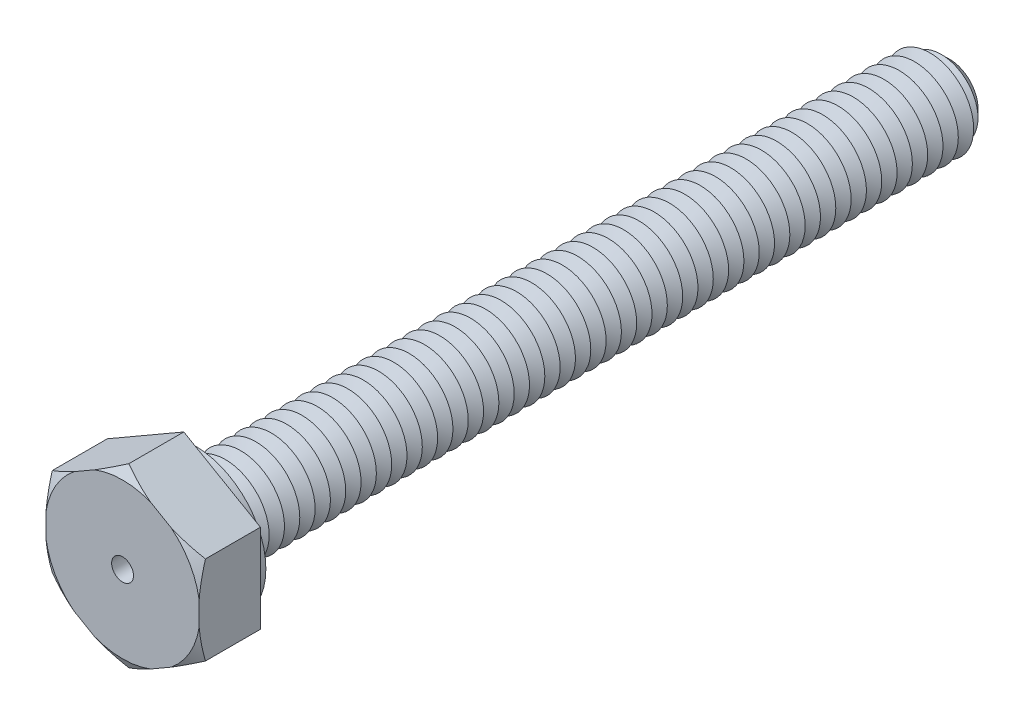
ISO-10303-21;
HEADER;
FILE_DESCRIPTION(('STEP AP214'),'2;1');
FILE_NAME('part.step','',(''),(''),'','','');
FILE_SCHEMA(('AUTOMOTIVE_DESIGN { 1 0 10303 214 1 1 1 1 }'));
ENDSEC;
DATA;
#1=APPLICATION_CONTEXT('core data for automotive mechanical design processes');
#2=APPLICATION_PROTOCOL_DEFINITION('international standard','automotive_design',2000,#1);
#3=PRODUCT_CONTEXT('',#1,'mechanical');
#4=PRODUCT('Part','Part','',(#3));
#5=PRODUCT_RELATED_PRODUCT_CATEGORY('part','',(#4));
#6=PRODUCT_DEFINITION_FORMATION('','',#4);
#7=PRODUCT_DEFINITION_CONTEXT('part definition',#1,'design');
#8=PRODUCT_DEFINITION('design','',#6,#7);
#9=PRODUCT_DEFINITION_SHAPE('','',#8);
#10=(LENGTH_UNIT() NAMED_UNIT(*) SI_UNIT(.MILLI.,.METRE.));
#11=(NAMED_UNIT(*) PLANE_ANGLE_UNIT() SI_UNIT($,.RADIAN.));
#12=(NAMED_UNIT(*) SI_UNIT($,.STERADIAN.) SOLID_ANGLE_UNIT());
#13=UNCERTAINTY_MEASURE_WITH_UNIT(LENGTH_MEASURE(1.E-05),#10,'distance_accuracy_value','');
#14=(GEOMETRIC_REPRESENTATION_CONTEXT(3) GLOBAL_UNCERTAINTY_ASSIGNED_CONTEXT((#13)) GLOBAL_UNIT_ASSIGNED_CONTEXT((#10,
#11,#12)) REPRESENTATION_CONTEXT('',''));
#15=CARTESIAN_POINT('',(0.,0.,0.));
#16=DIRECTION('',(0.,0.,1.));
#17=DIRECTION('',(1.,0.,0.));
#18=AXIS2_PLACEMENT_3D('',#15,#16,#17);
#19=CARTESIAN_POINT('',(3.5,2.02072594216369,2.8));
#20=DIRECTION('',(-0.5,-0.866025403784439,0.));
#21=DIRECTION('',(0.866025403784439,-0.5,0.));
#22=AXIS2_PLACEMENT_3D('',#19,#20,#21);
#23=PLANE('',#22);
#24=CARTESIAN_POINT('',(5.93124915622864,0.617043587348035,1.40176894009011));
#25=CARTESIAN_POINT('',(5.82127624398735,0.680536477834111,1.46111507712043));
#26=CARTESIAN_POINT('',(5.71104026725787,0.744181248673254,1.51982121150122));
#27=CARTESIAN_POINT('',(5.48993126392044,0.871838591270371,1.63565294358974));
#28=CARTESIAN_POINT('',(5.37905815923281,0.935851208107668,1.69277834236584));
#29=CARTESIAN_POINT('',(5.15623473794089,1.06449837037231,1.80531321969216));
#30=CARTESIAN_POINT('',(5.04428210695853,1.12913425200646,1.86071660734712));
#31=CARTESIAN_POINT('',(4.81953834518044,1.25889012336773,1.96920237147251));
#32=CARTESIAN_POINT('',(4.70674724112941,1.32401009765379,2.02228482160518));
#33=CARTESIAN_POINT('',(4.4773029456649,1.45647982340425,2.12693843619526));
#34=CARTESIAN_POINT('',(4.3606246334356,1.52384407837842,2.17843650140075));
#35=CARTESIAN_POINT('',(4.12610336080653,1.65924499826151,2.27776074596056));
#36=CARTESIAN_POINT('',(4.00826046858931,1.72728162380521,2.32558713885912));
#37=CARTESIAN_POINT('',(3.77136592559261,1.86405275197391,2.41666718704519));
#38=CARTESIAN_POINT('',(3.65231548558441,1.93278655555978,2.45992500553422));
#39=CARTESIAN_POINT('',(3.41281068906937,2.07106471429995,2.54086522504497));
#40=CARTESIAN_POINT('',(3.29235651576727,2.14060896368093,2.57854834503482));
#41=CARTESIAN_POINT('',(3.00433211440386,2.30689992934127,2.66006219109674));
#42=CARTESIAN_POINT('',(2.83610127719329,2.40402804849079,2.70086381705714));
#43=CARTESIAN_POINT('',(2.49725085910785,2.59966342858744,2.76622673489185));
#44=CARTESIAN_POINT('',(2.32663213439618,2.69817019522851,2.79079370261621));
#45=CARTESIAN_POINT('',(2.07079150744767,2.84587985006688,2.81342200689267));
#46=CARTESIAN_POINT('',(1.98601608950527,2.89482496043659,2.8186046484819));
#47=CARTESIAN_POINT('',(1.81634230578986,2.9927861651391,2.82423615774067));
#48=CARTESIAN_POINT('',(1.73144394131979,3.04180225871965,2.82468507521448));
#49=CARTESIAN_POINT('',(1.56172682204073,3.13978848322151,2.82082792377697));
#50=CARTESIAN_POINT('',(1.47690807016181,3.18875861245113,2.81652168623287));
#51=CARTESIAN_POINT('',(1.30753953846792,3.28654357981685,2.80328667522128));
#52=CARTESIAN_POINT('',(1.22298977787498,3.3353584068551,2.79435757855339));
#53=CARTESIAN_POINT('',(1.02330750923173,3.45064501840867,2.76803629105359));
#54=CARTESIAN_POINT('',(0.90836188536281,3.51700890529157,2.7487394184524));
#55=CARTESIAN_POINT('',(0.679569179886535,3.64910243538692,2.70286231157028));
#56=CARTESIAN_POINT('',(0.565722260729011,3.71483198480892,2.67628101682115));
#57=CARTESIAN_POINT('',(0.339141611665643,3.84564838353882,2.61683846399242));
#58=CARTESIAN_POINT('',(0.226409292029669,3.91073441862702,2.58397011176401));
#59=CARTESIAN_POINT('',(0.00220965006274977,4.04017614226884,2.512988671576));
#60=CARTESIAN_POINT('',(-0.109257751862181,4.10453187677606,2.47487591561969));
#61=CARTESIAN_POINT('',(-0.332327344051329,4.23332116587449,2.39383232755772));
#62=CARTESIAN_POINT('',(-0.443915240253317,4.29774646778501,2.35084938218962));
#63=CARTESIAN_POINT('',(-0.665905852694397,4.42591280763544,2.26126522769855));
#64=CARTESIAN_POINT('',(-0.776309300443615,4.48965426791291,2.2146664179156));
#65=CARTESIAN_POINT('',(-1.10600622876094,4.68000487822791,2.07044134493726));
#66=CARTESIAN_POINT('',(-1.32384189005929,4.80577235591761,1.96836549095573));
#67=CARTESIAN_POINT('',(-1.61545494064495,4.97413522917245,1.82536950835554));
#68=CARTESIAN_POINT('',(-1.69056073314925,5.01749757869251,1.78796601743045));
#69=CARTESIAN_POINT('',(-1.84044297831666,5.10403213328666,1.71229146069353));
#70=CARTESIAN_POINT('',(-1.91521944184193,5.14720434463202,1.67402042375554));
#71=CARTESIAN_POINT('',(-2.06368614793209,5.23292163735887,1.59712633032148));
#72=CARTESIAN_POINT('',(-2.13737951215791,5.27546852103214,1.55851128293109));
#73=CARTESIAN_POINT('',(-2.28450431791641,5.36041106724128,1.48061736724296));
#74=CARTESIAN_POINT('',(-2.35793575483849,5.40280672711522,1.44133848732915));
#75=CARTESIAN_POINT('',(-2.43124915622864,5.44513423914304,1.40176894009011));
#76=B_SPLINE_CURVE_WITH_KNOTS('',3,(#24,#25,#26,#27,#28,#29,#30,#31,#32,#33,#34,#35,#36,#37,#38,
#39,#40,#41,#42,#43,#44,#45,#46,#47,#48,#49,#50,#51,#52,#53,#54,#55,#56,#57,#58,#59,#60,#61,#62,
#63,#64,#65,#66,#67,#68,#69,#70,#71,#72,#73,#74,#75),.UNSPECIFIED.,.F.,.F.,(4,2,2,2,2,2,2,2,2,2,
2,2,2,2,2,2,2,2,2,2,2,2,2,2,2,4),(0.,0.420511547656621,0.841075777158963,1.26298883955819,
1.68488850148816,2.11755106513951,2.55018844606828,2.98242811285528,3.41461198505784,
4.0095520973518,4.60428410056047,4.89826759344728,5.19224799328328,5.48623881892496,
5.78025020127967,6.1823765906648,6.58456155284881,6.98720303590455,7.3898190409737,
7.7972442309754,8.20440134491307,9.01851321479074,9.30185450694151,9.58518638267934,
9.86552040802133,10.1458593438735),.UNSPECIFIED.);
#77=CARTESIAN_POINT('',(3.5,2.02072594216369,2.51132486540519));
#78=VERTEX_POINT('',#77);
#79=CARTESIAN_POINT('',(2.2178793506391,2.76095864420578,2.8));
#80=VERTEX_POINT('',#79);
#81=EDGE_CURVE('E132',#78,#80,#76,.T.);
#82=ORIENTED_EDGE('',*,*,#81,.F.);
#83=DIRECTION('',(0.,0.,-1.));
#84=VECTOR('',#83,1.);
#85=CARTESIAN_POINT('',(3.5,2.02072594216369,2.8));
#86=LINE('',#85,#84);
#87=CARTESIAN_POINT('',(3.5,2.02072594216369,0.));
#88=VERTEX_POINT('',#87);
#89=EDGE_CURVE('E144',#78,#88,#86,.T.);
#90=ORIENTED_EDGE('',*,*,#89,.T.);
#91=DIRECTION('',(-0.866025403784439,0.5,0.));
#92=VECTOR('',#91,1.);
#93=CARTESIAN_POINT('',(3.5,2.02072594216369,0.));
#94=LINE('',#93,#92);
#95=CARTESIAN_POINT('',(0.,4.04145188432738,0.));
#96=VERTEX_POINT('',#95);
#97=EDGE_CURVE('E594',#88,#96,#94,.T.);
#98=ORIENTED_EDGE('',*,*,#97,.T.);
#99=DIRECTION('',(0.,0.,-1.));
#100=VECTOR('',#99,1.);
#101=CARTESIAN_POINT('',(0.,4.04145188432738,2.8));
#102=LINE('',#101,#100);
#103=CARTESIAN_POINT('',(0.,4.04145188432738,2.51132486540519));
#104=VERTEX_POINT('',#103);
#105=EDGE_CURVE('E179',#104,#96,#102,.T.);
#106=ORIENTED_EDGE('',*,*,#105,.F.);
#107=CARTESIAN_POINT('',(1.2821206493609,3.30121918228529,2.8));
#108=VERTEX_POINT('',#107);
#109=EDGE_CURVE('E151',#108,#104,#76,.T.);
#110=ORIENTED_EDGE('',*,*,#109,.F.);
#111=DIRECTION('',(-0.866025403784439,0.5,0.));
#112=VECTOR('',#111,1.);
#113=CARTESIAN_POINT('',(3.5,2.02072594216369,2.8));
#114=LINE('',#113,#112);
#115=EDGE_CURVE('E148',#80,#108,#114,.T.);
#116=ORIENTED_EDGE('',*,*,#115,.F.);
#117=EDGE_LOOP('',(#82,#90,#98,#106,#110,#116));
#118=FACE_BOUND('',#117,.T.);
#119=ADVANCED_FACE('F39',(#118),#23,.F.);
#120=CARTESIAN_POINT('',(0.,4.04145188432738,2.8));
#121=DIRECTION('',(0.5,-0.866025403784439,0.));
#122=DIRECTION('',(0.866025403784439,0.5,0.));
#123=AXIS2_PLACEMENT_3D('',#120,#121,#122);
#124=PLANE('',#123);
#125=CARTESIAN_POINT('',(2.43124915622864,5.44513423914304,1.4017689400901));
#126=CARTESIAN_POINT('',(2.32127624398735,5.38164134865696,1.46111507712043));
#127=CARTESIAN_POINT('',(2.21104026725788,5.31799657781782,1.51982121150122));
#128=CARTESIAN_POINT('',(1.98993126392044,5.1903392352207,1.63565294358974));
#129=CARTESIAN_POINT('',(1.87905815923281,5.1263266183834,1.69277834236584));
#130=CARTESIAN_POINT('',(1.65623473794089,4.99767945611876,1.80531321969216));
#131=CARTESIAN_POINT('',(1.54428210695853,4.93304357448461,1.86071660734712));
#132=CARTESIAN_POINT('',(1.31953834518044,4.80328770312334,1.96920237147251));
#133=CARTESIAN_POINT('',(1.20674724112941,4.73816772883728,2.02228482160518));
#134=CARTESIAN_POINT('',(0.977302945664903,4.60569800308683,2.12693843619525));
#135=CARTESIAN_POINT('',(0.860624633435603,4.53833374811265,2.17843650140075));
#136=CARTESIAN_POINT('',(0.626103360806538,4.40293282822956,2.27776074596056));
#137=CARTESIAN_POINT('',(0.50826046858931,4.33489620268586,2.32558713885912));
#138=CARTESIAN_POINT('',(0.271365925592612,4.19812507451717,2.41666718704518));
#139=CARTESIAN_POINT('',(0.152315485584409,4.12939127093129,2.45992500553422));
#140=CARTESIAN_POINT('',(-0.0871893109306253,3.99111311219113,2.54086522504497));
#141=CARTESIAN_POINT('',(-0.207643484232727,3.92156886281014,2.57854834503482));
#142=CARTESIAN_POINT('',(-0.495667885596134,3.7552778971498,2.66006219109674));
#143=CARTESIAN_POINT('',(-0.663898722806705,3.65814977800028,2.70086381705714));
#144=CARTESIAN_POINT('',(-1.00274914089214,3.46251439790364,2.76622673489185));
#145=CARTESIAN_POINT('',(-1.17336786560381,3.36400763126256,2.79079370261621));
#146=CARTESIAN_POINT('',(-1.42920849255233,3.21629797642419,2.81342200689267));
#147=CARTESIAN_POINT('',(-1.51398391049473,3.16735286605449,2.8186046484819));
#148=CARTESIAN_POINT('',(-1.68365769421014,3.06939166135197,2.82423615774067));
#149=CARTESIAN_POINT('',(-1.7685560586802,3.02037556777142,2.82468507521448));
#150=CARTESIAN_POINT('',(-1.93827317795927,2.92238934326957,2.82082792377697));
#151=CARTESIAN_POINT('',(-2.02309192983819,2.87341921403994,2.81652168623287));
#152=CARTESIAN_POINT('',(-2.19246046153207,2.77563424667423,2.80328667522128));
#153=CARTESIAN_POINT('',(-2.27701022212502,2.72681941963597,2.79435757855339));
#154=CARTESIAN_POINT('',(-2.47669249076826,2.6115328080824,2.76803629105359));
#155=CARTESIAN_POINT('',(-2.59163811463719,2.54516892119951,2.7487394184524));
#156=CARTESIAN_POINT('',(-2.82043082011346,2.41307539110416,2.70286231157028));
#157=CARTESIAN_POINT('',(-2.93427773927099,2.34734584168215,2.67628101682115));
#158=CARTESIAN_POINT('',(-3.16085838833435,2.21652944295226,2.61683846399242));
#159=CARTESIAN_POINT('',(-3.27359070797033,2.15144340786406,2.58397011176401));
#160=CARTESIAN_POINT('',(-3.49779034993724,2.02200168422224,2.512988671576));
#161=CARTESIAN_POINT('',(-3.60925775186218,1.95764594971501,2.47487591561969));
#162=CARTESIAN_POINT('',(-3.83232734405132,1.82885666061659,2.39383232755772));
#163=CARTESIAN_POINT('',(-3.94391524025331,1.76443135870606,2.35084938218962));
#164=CARTESIAN_POINT('',(-4.16590585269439,1.63626501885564,2.26126522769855));
#165=CARTESIAN_POINT('',(-4.27630930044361,1.57252355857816,2.21466641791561));
#166=CARTESIAN_POINT('',(-4.60600622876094,1.38217294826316,2.07044134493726));
#167=CARTESIAN_POINT('',(-4.82384189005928,1.25640547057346,1.96836549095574));
#168=CARTESIAN_POINT('',(-5.11545494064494,1.08804259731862,1.82536950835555));
#169=CARTESIAN_POINT('',(-5.19056073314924,1.04468024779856,1.78796601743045));
#170=CARTESIAN_POINT('',(-5.34044297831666,0.958145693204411,1.71229146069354));
#171=CARTESIAN_POINT('',(-5.41521944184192,0.914973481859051,1.67402042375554));
#172=CARTESIAN_POINT('',(-5.56368614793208,0.829256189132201,1.59712633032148));
#173=CARTESIAN_POINT('',(-5.6373795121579,0.786709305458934,1.55851128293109));
#174=CARTESIAN_POINT('',(-5.78450431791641,0.701766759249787,1.48061736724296));
#175=CARTESIAN_POINT('',(-5.85793575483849,0.659371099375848,1.44133848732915));
#176=CARTESIAN_POINT('',(-5.93124915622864,0.617043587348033,1.40176894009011));
#177=B_SPLINE_CURVE_WITH_KNOTS('',3,(#125,#126,#127,#128,#129,#130,#131,#132,#133,#134,#135,
#136,#137,#138,#139,#140,#141,#142,#143,#144,#145,#146,#147,#148,#149,#150,#151,#152,#153,#154,
#155,#156,#157,#158,#159,#160,#161,#162,#163,#164,#165,#166,#167,#168,#169,#170,#171,#172,#173,
#174,#175,#176),.UNSPECIFIED.,.F.,.F.,(4,2,2,2,2,2,2,2,2,2,2,2,2,2,2,2,2,2,2,2,2,2,2,2,2,4),(0.,
0.420511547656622,0.841075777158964,1.26298883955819,1.68488850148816,2.11755106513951,
2.55018844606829,2.98242811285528,3.41461198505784,4.0095520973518,4.60428410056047,
4.89826759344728,5.19224799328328,5.48623881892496,5.78025020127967,6.1823765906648,
6.58456155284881,6.98720303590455,7.3898190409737,7.7972442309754,8.20440134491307,
9.01851321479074,9.30185450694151,9.58518638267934,9.86552040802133,10.1458593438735),.UNSPECIFIED.);
#178=CARTESIAN_POINT('',(-1.2821206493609,3.30121918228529,2.8));
#179=VERTEX_POINT('',#178);
#180=EDGE_CURVE('E639',#104,#179,#177,.T.);
#181=ORIENTED_EDGE('',*,*,#180,.F.);
#182=ORIENTED_EDGE('',*,*,#105,.T.);
#183=DIRECTION('',(-0.866025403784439,-0.5,0.));
#184=VECTOR('',#183,1.);
#185=CARTESIAN_POINT('',(0.,4.04145188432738,0.));
#186=LINE('',#185,#184);
#187=CARTESIAN_POINT('',(-3.5,2.02072594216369,0.));
#188=VERTEX_POINT('',#187);
#189=EDGE_CURVE('E614',#96,#188,#186,.T.);
#190=ORIENTED_EDGE('',*,*,#189,.T.);
#191=DIRECTION('',(0.,0.,-1.));
#192=VECTOR('',#191,1.);
#193=CARTESIAN_POINT('',(-3.5,2.02072594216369,2.8));
#194=LINE('',#193,#192);
#195=CARTESIAN_POINT('',(-3.5,2.02072594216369,2.51132486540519));
#196=VERTEX_POINT('',#195);
#197=EDGE_CURVE('E176',#196,#188,#194,.T.);
#198=ORIENTED_EDGE('',*,*,#197,.F.);
#199=CARTESIAN_POINT('',(-2.2178793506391,2.76095864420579,2.8));
#200=VERTEX_POINT('',#199);
#201=EDGE_CURVE('E640',#200,#196,#177,.T.);
#202=ORIENTED_EDGE('',*,*,#201,.F.);
#203=DIRECTION('',(-0.866025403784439,-0.5,0.));
#204=VECTOR('',#203,1.);
#205=CARTESIAN_POINT('',(0.,4.04145188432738,2.8));
#206=LINE('',#205,#204);
#207=EDGE_CURVE('E597',#179,#200,#206,.T.);
#208=ORIENTED_EDGE('',*,*,#207,.F.);
#209=EDGE_LOOP('',(#181,#182,#190,#198,#202,#208));
#210=FACE_BOUND('',#209,.T.);
#211=ADVANCED_FACE('F657',(#210),#124,.F.);
#212=CARTESIAN_POINT('',(-3.5,2.02072594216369,2.8));
#213=DIRECTION('',(1.,0.,0.));
#214=DIRECTION('',(0.,1.,0.));
#215=AXIS2_PLACEMENT_3D('',#212,#213,#214);
#216=PLANE('',#215);
#217=CARTESIAN_POINT('',(-3.5,4.45197509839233,1.57509745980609));
#218=CARTESIAN_POINT('',(-3.5,4.32552348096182,1.632476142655));
#219=CARTESIAN_POINT('',(-3.5,4.19872625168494,1.68910722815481));
#220=CARTESIAN_POINT('',(-3.5,3.94429210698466,1.80051165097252));
#221=CARTESIAN_POINT('',(-3.5,3.81665504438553,1.85528465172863));
#222=CARTESIAN_POINT('',(-3.5,3.55990351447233,1.96281335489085));
#223=CARTESIAN_POINT('',(-3.5,3.43078510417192,2.01555968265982));
#224=CARTESIAN_POINT('',(-3.5,3.17145843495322,2.11829034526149));
#225=CARTESIAN_POINT('',(-3.5,3.04125022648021,2.16827480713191));
#226=CARTESIAN_POINT('',(-3.5,2.78016103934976,2.26465408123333));
#227=CARTESIAN_POINT('',(-3.5,2.64928566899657,2.31106393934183));
#228=CARTESIAN_POINT('',(-3.5,2.38615329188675,2.39977727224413));
#229=CARTESIAN_POINT('',(-3.5,2.25389619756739,2.44208048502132));
#230=CARTESIAN_POINT('',(-3.5,1.85519063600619,2.56138283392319));
#231=CARTESIAN_POINT('',(-3.5,1.58637912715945,2.63093897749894));
#232=CARTESIAN_POINT('',(-3.5,1.11975855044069,2.72563856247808));
#233=CARTESIAN_POINT('',(-3.5,0.923391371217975,2.75778053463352));
#234=CARTESIAN_POINT('',(-3.5,0.528527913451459,2.80406409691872));
#235=CARTESIAN_POINT('',(-3.5,0.330032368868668,2.81821170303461));
#236=CARTESIAN_POINT('',(-3.5,-0.0672968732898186,2.82680706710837));
#237=CARTESIAN_POINT('',(-3.5,-0.266130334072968,2.82126532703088));
#238=CARTESIAN_POINT('',(-3.5,-0.662321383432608,2.79120496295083));
#239=CARTESIAN_POINT('',(-3.5,-0.859678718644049,2.76668315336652));
#240=CARTESIAN_POINT('',(-3.5,-1.34971804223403,2.68500356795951));
#241=CARTESIAN_POINT('',(-3.5,-1.64068160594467,2.61765497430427));
#242=CARTESIAN_POINT('',(-3.5,-2.07181303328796,2.497569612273));
#243=CARTESIAN_POINT('',(-3.5,-2.21482517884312,2.45429352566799));
#244=CARTESIAN_POINT('',(-3.5,-2.49919378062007,2.36258423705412));
#245=CARTESIAN_POINT('',(-3.5,-2.64055035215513,2.31415139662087));
#246=CARTESIAN_POINT('',(-3.5,-2.92337235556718,2.2125676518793));
#247=CARTESIAN_POINT('',(-3.5,-3.06482042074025,2.15936898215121));
#248=CARTESIAN_POINT('',(-3.5,-3.34639535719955,2.04956763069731));
#249=CARTESIAN_POINT('',(-3.5,-3.48652214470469,1.99296473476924));
#250=CARTESIAN_POINT('',(-3.5,-3.76476497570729,1.87738368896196));
#251=CARTESIAN_POINT('',(-3.5,-3.90288810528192,1.81842250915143));
#252=CARTESIAN_POINT('',(-3.5,-4.1781332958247,1.6982956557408));
#253=CARTESIAN_POINT('',(-3.5,-4.31525559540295,1.6371305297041));
#254=CARTESIAN_POINT('',(-3.5,-4.45197509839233,1.57509745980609));
#255=B_SPLINE_CURVE_WITH_KNOTS('',3,(#217,#218,#219,#220,#221,#222,#223,#224,#225,#226,#227,
#228,#229,#230,#231,#232,#233,#234,#235,#236,#237,#238,#239,#240,#241,#242,#243,#244,#245,#246,
#247,#248,#249,#250,#251,#252,#253,#254),.UNSPECIFIED.,.F.,.F.,(4,2,2,2,2,2,2,2,2,2,2,2,2,2,2,2,
2,2,4),(0.,0.416588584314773,0.83325222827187,1.251655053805,1.67003861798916,2.08655215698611,
2.50309225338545,3.3347974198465,3.93106101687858,4.52712521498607,5.12287153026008,
5.71871785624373,6.61272902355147,7.06093271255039,7.50910499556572,7.9624204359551,
8.41576442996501,8.86628772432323,9.31669984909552),.UNSPECIFIED.);
#256=CARTESIAN_POINT('',(-3.5,0.540260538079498,2.8));
#257=VERTEX_POINT('',#256);
#258=EDGE_CURVE('E645',#196,#257,#255,.T.);
#259=ORIENTED_EDGE('',*,*,#258,.F.);
#260=ORIENTED_EDGE('',*,*,#197,.T.);
#261=DIRECTION('',(0.,-1.,0.));
#262=VECTOR('',#261,1.);
#263=CARTESIAN_POINT('',(-3.5,2.02072594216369,0.));
#264=LINE('',#263,#262);
#265=CARTESIAN_POINT('',(-3.5,-2.02072594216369,0.));
#266=VERTEX_POINT('',#265);
#267=EDGE_CURVE('E618',#188,#266,#264,.T.);
#268=ORIENTED_EDGE('',*,*,#267,.T.);
#269=DIRECTION('',(0.,0.,-1.));
#270=VECTOR('',#269,1.);
#271=CARTESIAN_POINT('',(-3.5,-2.02072594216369,2.8));
#272=LINE('',#271,#270);
#273=CARTESIAN_POINT('',(-3.5,-2.02072594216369,2.51132486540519));
#274=VERTEX_POINT('',#273);
#275=EDGE_CURVE('E173',#274,#266,#272,.T.);
#276=ORIENTED_EDGE('',*,*,#275,.F.);
#277=CARTESIAN_POINT('',(-3.5,-0.540260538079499,2.8));
#278=VERTEX_POINT('',#277);
#279=EDGE_CURVE('E652',#278,#274,#255,.T.);
#280=ORIENTED_EDGE('',*,*,#279,.F.);
#281=DIRECTION('',(0.,-1.,0.));
#282=VECTOR('',#281,1.);
#283=CARTESIAN_POINT('',(-3.5,2.02072594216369,2.8));
#284=LINE('',#283,#282);
#285=EDGE_CURVE('E601',#257,#278,#284,.T.);
#286=ORIENTED_EDGE('',*,*,#285,.F.);
#287=EDGE_LOOP('',(#259,#260,#268,#276,#280,#286));
#288=FACE_BOUND('',#287,.T.);
#289=ADVANCED_FACE('F695',(#288),#216,.F.);
#290=CARTESIAN_POINT('',(-3.5,-2.02072594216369,2.8));
#291=DIRECTION('',(0.5,0.866025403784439,0.));
#292=DIRECTION('',(-0.866025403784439,0.5,0.));
#293=AXIS2_PLACEMENT_3D('',#290,#291,#292);
#294=PLANE('',#293);
#295=CARTESIAN_POINT('',(-5.93124915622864,-0.617043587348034,1.4017689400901));
#296=CARTESIAN_POINT('',(-5.82127624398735,-0.68053647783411,1.46111507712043));
#297=CARTESIAN_POINT('',(-5.71104026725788,-0.744181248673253,1.51982121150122));
#298=CARTESIAN_POINT('',(-5.48993126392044,-0.87183859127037,1.63565294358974));
#299=CARTESIAN_POINT('',(-5.37905815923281,-0.935851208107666,1.69277834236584));
#300=CARTESIAN_POINT('',(-5.15623473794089,-1.06449837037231,1.80531321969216));
#301=CARTESIAN_POINT('',(-5.04428210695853,-1.12913425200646,1.86071660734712));
#302=CARTESIAN_POINT('',(-4.81953834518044,-1.25889012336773,1.96920237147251));
#303=CARTESIAN_POINT('',(-4.70674724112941,-1.32401009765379,2.02228482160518));
#304=CARTESIAN_POINT('',(-4.4773029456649,-1.45647982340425,2.12693843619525));
#305=CARTESIAN_POINT('',(-4.3606246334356,-1.52384407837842,2.17843650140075));
#306=CARTESIAN_POINT('',(-4.12610336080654,-1.65924499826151,2.27776074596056));
#307=CARTESIAN_POINT('',(-4.00826046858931,-1.72728162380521,2.32558713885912));
#308=CARTESIAN_POINT('',(-3.77136592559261,-1.8640527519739,2.41666718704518));
#309=CARTESIAN_POINT('',(-3.65231548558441,-1.93278655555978,2.45992500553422));
#310=CARTESIAN_POINT('',(-3.41281068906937,-2.07106471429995,2.54086522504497));
#311=CARTESIAN_POINT('',(-3.29235651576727,-2.14060896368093,2.57854834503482));
#312=CARTESIAN_POINT('',(-3.00433211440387,-2.30689992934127,2.66006219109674));
#313=CARTESIAN_POINT('',(-2.83610127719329,-2.40402804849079,2.70086381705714));
#314=CARTESIAN_POINT('',(-2.49725085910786,-2.59966342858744,2.76622673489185));
#315=CARTESIAN_POINT('',(-2.32663213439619,-2.69817019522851,2.79079370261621));
#316=CARTESIAN_POINT('',(-2.07079150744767,-2.84587985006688,2.81342200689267));
#317=CARTESIAN_POINT('',(-1.98601608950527,-2.89482496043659,2.8186046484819));
#318=CARTESIAN_POINT('',(-1.81634230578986,-2.9927861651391,2.82423615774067));
#319=CARTESIAN_POINT('',(-1.7314439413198,-3.04180225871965,2.82468507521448));
#320=CARTESIAN_POINT('',(-1.56172682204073,-3.13978848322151,2.82082792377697));
#321=CARTESIAN_POINT('',(-1.47690807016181,-3.18875861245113,2.81652168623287));
#322=CARTESIAN_POINT('',(-1.30753953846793,-3.28654357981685,2.80328667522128));
#323=CARTESIAN_POINT('',(-1.22298977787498,-3.3353584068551,2.79435757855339));
#324=CARTESIAN_POINT('',(-1.02330750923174,-3.45064501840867,2.76803629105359));
#325=CARTESIAN_POINT('',(-0.908361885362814,-3.51700890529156,2.7487394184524));
#326=CARTESIAN_POINT('',(-0.679569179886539,-3.64910243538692,2.70286231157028));
#327=CARTESIAN_POINT('',(-0.565722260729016,-3.71483198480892,2.67628101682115));
#328=CARTESIAN_POINT('',(-0.339141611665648,-3.84564838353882,2.61683846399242));
#329=CARTESIAN_POINT('',(-0.226409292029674,-3.91073441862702,2.58397011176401));
#330=CARTESIAN_POINT('',(-0.00220965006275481,-4.04017614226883,2.512988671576));
#331=CARTESIAN_POINT('',(0.109257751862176,-4.10453187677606,2.47487591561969));
#332=CARTESIAN_POINT('',(0.332327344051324,-4.23332116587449,2.39383232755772));
#333=CARTESIAN_POINT('',(0.443915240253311,-4.29774646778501,2.35084938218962));
#334=CARTESIAN_POINT('',(0.665905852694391,-4.42591280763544,2.26126522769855));
#335=CARTESIAN_POINT('',(0.776309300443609,-4.48965426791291,2.2146664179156));
#336=CARTESIAN_POINT('',(1.10600622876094,-4.68000487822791,2.07044134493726));
#337=CARTESIAN_POINT('',(1.32384189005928,-4.80577235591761,1.96836549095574));
#338=CARTESIAN_POINT('',(1.61545494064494,-4.97413522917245,1.82536950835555));
#339=CARTESIAN_POINT('',(1.69056073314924,-5.01749757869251,1.78796601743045));
#340=CARTESIAN_POINT('',(1.84044297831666,-5.10403213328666,1.71229146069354));
#341=CARTESIAN_POINT('',(1.91521944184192,-5.14720434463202,1.67402042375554));
#342=CARTESIAN_POINT('',(2.06368614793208,-5.23292163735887,1.59712633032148));
#343=CARTESIAN_POINT('',(2.1373795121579,-5.27546852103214,1.55851128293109));
#344=CARTESIAN_POINT('',(2.28450431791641,-5.36041106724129,1.48061736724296));
#345=CARTESIAN_POINT('',(2.35793575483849,-5.40280672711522,1.44133848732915));
#346=CARTESIAN_POINT('',(2.43124915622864,-5.44513423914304,1.40176894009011));
#347=B_SPLINE_CURVE_WITH_KNOTS('',3,(#295,#296,#297,#298,#299,#300,#301,#302,#303,#304,#305,
#306,#307,#308,#309,#310,#311,#312,#313,#314,#315,#316,#317,#318,#319,#320,#321,#322,#323,#324,
#325,#326,#327,#328,#329,#330,#331,#332,#333,#334,#335,#336,#337,#338,#339,#340,#341,#342,#343,
#344,#345,#346),.UNSPECIFIED.,.F.,.F.,(4,2,2,2,2,2,2,2,2,2,2,2,2,2,2,2,2,2,2,2,2,2,2,2,2,4),(0.,
0.420511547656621,0.841075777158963,1.26298883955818,1.68488850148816,2.11755106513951,
2.55018844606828,2.98242811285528,3.41461198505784,4.00955209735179,4.60428410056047,
4.89826759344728,5.19224799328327,5.48623881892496,5.78025020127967,6.1823765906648,
6.58456155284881,6.98720303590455,7.38981904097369,7.7972442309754,8.20440134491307,
9.01851321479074,9.30185450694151,9.58518638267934,9.86552040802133,10.1458593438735),.UNSPECIFIED.);
#348=CARTESIAN_POINT('',(-2.2178793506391,-2.76095864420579,2.8));
#349=VERTEX_POINT('',#348);
#350=EDGE_CURVE('E634',#274,#349,#347,.T.);
#351=ORIENTED_EDGE('',*,*,#350,.F.);
#352=ORIENTED_EDGE('',*,*,#275,.T.);
#353=DIRECTION('',(0.866025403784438,-0.5,0.));
#354=VECTOR('',#353,1.);
#355=CARTESIAN_POINT('',(-3.5,-2.02072594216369,0.));
#356=LINE('',#355,#354);
#357=CARTESIAN_POINT('',(0.,-4.04145188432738,0.));
#358=VERTEX_POINT('',#357);
#359=EDGE_CURVE('E622',#266,#358,#356,.T.);
#360=ORIENTED_EDGE('',*,*,#359,.T.);
#361=DIRECTION('',(0.,0.,-1.));
#362=VECTOR('',#361,1.);
#363=CARTESIAN_POINT('',(0.,-4.04145188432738,2.8));
#364=LINE('',#363,#362);
#365=CARTESIAN_POINT('',(0.,-4.04145188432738,2.51132486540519));
#366=VERTEX_POINT('',#365);
#367=EDGE_CURVE('E163',#366,#358,#364,.T.);
#368=ORIENTED_EDGE('',*,*,#367,.F.);
#369=CARTESIAN_POINT('',(-1.2821206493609,-3.30121918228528,2.8));
#370=VERTEX_POINT('',#369);
#371=EDGE_CURVE('E633',#370,#366,#347,.T.);
#372=ORIENTED_EDGE('',*,*,#371,.F.);
#373=DIRECTION('',(0.866025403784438,-0.5,0.));
#374=VECTOR('',#373,1.);
#375=CARTESIAN_POINT('',(-3.5,-2.02072594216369,2.8));
#376=LINE('',#375,#374);
#377=EDGE_CURVE('E605',#349,#370,#376,.T.);
#378=ORIENTED_EDGE('',*,*,#377,.F.);
#379=EDGE_LOOP('',(#351,#352,#360,#368,#372,#378));
#380=FACE_BOUND('',#379,.T.);
#381=ADVANCED_FACE('F691',(#380),#294,.F.);
#382=CARTESIAN_POINT('',(0.,-4.04145188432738,2.8));
#383=DIRECTION('',(-0.5,0.866025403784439,0.));
#384=DIRECTION('',(-0.866025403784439,-0.5,0.));
#385=AXIS2_PLACEMENT_3D('',#382,#383,#384);
#386=PLANE('',#385);
#387=CARTESIAN_POINT('',(-2.43124915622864,-5.44513423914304,1.4017689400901));
#388=CARTESIAN_POINT('',(-2.32127624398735,-5.38164134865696,1.46111507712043));
#389=CARTESIAN_POINT('',(-2.21104026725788,-5.31799657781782,1.51982121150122));
#390=CARTESIAN_POINT('',(-1.98993126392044,-5.1903392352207,1.63565294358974));
#391=CARTESIAN_POINT('',(-1.87905815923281,-5.1263266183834,1.69277834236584));
#392=CARTESIAN_POINT('',(-1.65623473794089,-4.99767945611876,1.80531321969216));
#393=CARTESIAN_POINT('',(-1.54428210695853,-4.93304357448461,1.86071660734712));
#394=CARTESIAN_POINT('',(-1.31953834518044,-4.80328770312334,1.96920237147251));
#395=CARTESIAN_POINT('',(-1.20674724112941,-4.73816772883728,2.02228482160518));
#396=CARTESIAN_POINT('',(-0.977302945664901,-4.60569800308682,2.12693843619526));
#397=CARTESIAN_POINT('',(-0.860624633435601,-4.53833374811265,2.17843650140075));
#398=CARTESIAN_POINT('',(-0.626103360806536,-4.40293282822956,2.27776074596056));
#399=CARTESIAN_POINT('',(-0.508260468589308,-4.33489620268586,2.32558713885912));
#400=CARTESIAN_POINT('',(-0.27136592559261,-4.19812507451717,2.41666718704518));
#401=CARTESIAN_POINT('',(-0.152315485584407,-4.12939127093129,2.45992500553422));
#402=CARTESIAN_POINT('',(0.0871893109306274,-3.99111311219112,2.54086522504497));
#403=CARTESIAN_POINT('',(0.20764348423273,-3.92156886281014,2.57854834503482));
#404=CARTESIAN_POINT('',(0.495667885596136,-3.7552778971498,2.66006219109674));
#405=CARTESIAN_POINT('',(0.663898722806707,-3.65814977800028,2.70086381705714));
#406=CARTESIAN_POINT('',(1.00274914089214,-3.46251439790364,2.76622673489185));
#407=CARTESIAN_POINT('',(1.17336786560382,-3.36400763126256,2.79079370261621));
#408=CARTESIAN_POINT('',(1.42920849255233,-3.21629797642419,2.81342200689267));
#409=CARTESIAN_POINT('',(1.51398391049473,-3.16735286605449,2.8186046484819));
#410=CARTESIAN_POINT('',(1.68365769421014,-3.06939166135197,2.82423615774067));
#411=CARTESIAN_POINT('',(1.76855605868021,-3.02037556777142,2.82468507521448));
#412=CARTESIAN_POINT('',(1.93827317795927,-2.92238934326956,2.82082792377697));
#413=CARTESIAN_POINT('',(2.02309192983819,-2.87341921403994,2.81652168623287));
#414=CARTESIAN_POINT('',(2.19246046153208,-2.77563424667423,2.80328667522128));
#415=CARTESIAN_POINT('',(2.27701022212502,-2.72681941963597,2.79435757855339));
#416=CARTESIAN_POINT('',(2.47669249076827,-2.6115328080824,2.76803629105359));
#417=CARTESIAN_POINT('',(2.59163811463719,-2.54516892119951,2.7487394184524));
#418=CARTESIAN_POINT('',(2.82043082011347,-2.41307539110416,2.70286231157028));
#419=CARTESIAN_POINT('',(2.93427773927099,-2.34734584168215,2.67628101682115));
#420=CARTESIAN_POINT('',(3.16085838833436,-2.21652944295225,2.61683846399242));
#421=CARTESIAN_POINT('',(3.27359070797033,-2.15144340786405,2.58397011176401));
#422=CARTESIAN_POINT('',(3.49779034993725,-2.02200168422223,2.512988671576));
#423=CARTESIAN_POINT('',(3.60925775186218,-1.95764594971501,2.47487591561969));
#424=CARTESIAN_POINT('',(3.83232734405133,-1.82885666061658,2.39383232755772));
#425=CARTESIAN_POINT('',(3.94391524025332,-1.76443135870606,2.35084938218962));
#426=CARTESIAN_POINT('',(4.1659058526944,-1.63626501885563,2.26126522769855));
#427=CARTESIAN_POINT('',(4.27630930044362,-1.57252355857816,2.2146664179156));
#428=CARTESIAN_POINT('',(4.60600622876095,-1.38217294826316,2.07044134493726));
#429=CARTESIAN_POINT('',(4.82384189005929,-1.25640547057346,1.96836549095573));
#430=CARTESIAN_POINT('',(5.11545494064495,-1.08804259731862,1.82536950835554));
#431=CARTESIAN_POINT('',(5.19056073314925,-1.04468024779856,1.78796601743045));
#432=CARTESIAN_POINT('',(5.34044297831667,-0.95814569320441,1.71229146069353));
#433=CARTESIAN_POINT('',(5.41521944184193,-0.914973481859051,1.67402042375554));
#434=CARTESIAN_POINT('',(5.56368614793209,-0.829256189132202,1.59712633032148));
#435=CARTESIAN_POINT('',(5.63737951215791,-0.786709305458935,1.55851128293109));
#436=CARTESIAN_POINT('',(5.78450431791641,-0.70176675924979,1.48061736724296));
#437=CARTESIAN_POINT('',(5.85793575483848,-0.659371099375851,1.44133848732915));
#438=CARTESIAN_POINT('',(5.93124915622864,-0.617043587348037,1.40176894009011));
#439=B_SPLINE_CURVE_WITH_KNOTS('',3,(#387,#388,#389,#390,#391,#392,#393,#394,#395,#396,#397,
#398,#399,#400,#401,#402,#403,#404,#405,#406,#407,#408,#409,#410,#411,#412,#413,#414,#415,#416,
#417,#418,#419,#420,#421,#422,#423,#424,#425,#426,#427,#428,#429,#430,#431,#432,#433,#434,#435,
#436,#437,#438),.UNSPECIFIED.,.F.,.F.,(4,2,2,2,2,2,2,2,2,2,2,2,2,2,2,2,2,2,2,2,2,2,2,2,2,4),(0.,
0.420511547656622,0.841075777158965,1.26298883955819,1.68488850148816,2.11755106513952,
2.55018844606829,2.98242811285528,3.41461198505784,4.0095520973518,4.60428410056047,
4.89826759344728,5.19224799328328,5.48623881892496,5.78025020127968,6.18237659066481,
6.58456155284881,6.98720303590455,7.3898190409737,7.79724423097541,8.20440134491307,
9.01851321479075,9.30185450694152,9.58518638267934,9.86552040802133,10.1458593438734),.UNSPECIFIED.);
#440=CARTESIAN_POINT('',(1.2821206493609,-3.30121918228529,2.8));
#441=VERTEX_POINT('',#440);
#442=EDGE_CURVE('E64',#366,#441,#439,.T.);
#443=ORIENTED_EDGE('',*,*,#442,.F.);
#444=ORIENTED_EDGE('',*,*,#367,.T.);
#445=DIRECTION('',(0.866025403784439,0.5,0.));
#446=VECTOR('',#445,1.);
#447=CARTESIAN_POINT('',(0.,-4.04145188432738,0.));
#448=LINE('',#447,#446);
#449=CARTESIAN_POINT('',(3.5,-2.02072594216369,0.));
#450=VERTEX_POINT('',#449);
#451=EDGE_CURVE('E624',#358,#450,#448,.T.);
#452=ORIENTED_EDGE('',*,*,#451,.T.);
#453=DIRECTION('',(0.,0.,-1.));
#454=VECTOR('',#453,1.);
#455=CARTESIAN_POINT('',(3.5,-2.02072594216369,2.8));
#456=LINE('',#455,#454);
#457=CARTESIAN_POINT('',(3.5,-2.02072594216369,2.51132486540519));
#458=VERTEX_POINT('',#457);
#459=EDGE_CURVE('E157',#458,#450,#456,.T.);
#460=ORIENTED_EDGE('',*,*,#459,.F.);
#461=CARTESIAN_POINT('',(2.2178793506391,-2.76095864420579,2.8));
#462=VERTEX_POINT('',#461);
#463=EDGE_CURVE('E682',#462,#458,#439,.T.);
#464=ORIENTED_EDGE('',*,*,#463,.F.);
#465=DIRECTION('',(0.866025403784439,0.5,0.));
#466=VECTOR('',#465,1.);
#467=CARTESIAN_POINT('',(0.,-4.04145188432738,2.8));
#468=LINE('',#467,#466);
#469=EDGE_CURVE('E166',#441,#462,#468,.T.);
#470=ORIENTED_EDGE('',*,*,#469,.F.);
#471=EDGE_LOOP('',(#443,#444,#452,#460,#464,#470));
#472=FACE_BOUND('',#471,.T.);
#473=ADVANCED_FACE('F694',(#472),#386,.F.);
#474=CARTESIAN_POINT('',(3.5,-2.02072594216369,2.8));
#475=DIRECTION('',(-1.,0.,0.));
#476=DIRECTION('',(0.,-1.,0.));
#477=AXIS2_PLACEMENT_3D('',#474,#475,#476);
#478=PLANE('',#477);
#479=CARTESIAN_POINT('',(3.5,-4.45197509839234,1.57509745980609));
#480=CARTESIAN_POINT('',(3.5,-4.32552348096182,1.632476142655));
#481=CARTESIAN_POINT('',(3.5,-4.19872625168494,1.68910722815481));
#482=CARTESIAN_POINT('',(3.5,-3.94429210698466,1.80051165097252));
#483=CARTESIAN_POINT('',(3.5,-3.81665504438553,1.85528465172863));
#484=CARTESIAN_POINT('',(3.5,-3.55990351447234,1.96281335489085));
#485=CARTESIAN_POINT('',(3.5,-3.43078510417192,2.01555968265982));
#486=CARTESIAN_POINT('',(3.5,-3.17145843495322,2.11829034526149));
#487=CARTESIAN_POINT('',(3.5,-3.04125022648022,2.16827480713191));
#488=CARTESIAN_POINT('',(3.5,-2.78016103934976,2.26465408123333));
#489=CARTESIAN_POINT('',(3.5,-2.64928566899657,2.31106393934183));
#490=CARTESIAN_POINT('',(3.5,-2.38615329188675,2.39977727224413));
#491=CARTESIAN_POINT('',(3.5,-2.25389619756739,2.44208048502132));
#492=CARTESIAN_POINT('',(3.5,-1.85519063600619,2.56138283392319));
#493=CARTESIAN_POINT('',(3.5,-1.58637912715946,2.63093897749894));
#494=CARTESIAN_POINT('',(3.5,-1.11975855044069,2.72563856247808));
#495=CARTESIAN_POINT('',(3.5,-0.923391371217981,2.75778053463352));
#496=CARTESIAN_POINT('',(3.5,-0.528527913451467,2.80406409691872));
#497=CARTESIAN_POINT('',(3.5,-0.330032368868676,2.81821170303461));
#498=CARTESIAN_POINT('',(3.5,0.0672968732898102,2.82680706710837));
#499=CARTESIAN_POINT('',(3.5,0.26613033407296,2.82126532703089));
#500=CARTESIAN_POINT('',(3.5,0.662321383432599,2.79120496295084));
#501=CARTESIAN_POINT('',(3.5,0.85967871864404,2.76668315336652));
#502=CARTESIAN_POINT('',(3.5,1.34971804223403,2.68500356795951));
#503=CARTESIAN_POINT('',(3.5,1.64068160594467,2.61765497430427));
#504=CARTESIAN_POINT('',(3.5,2.07181303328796,2.497569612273));
#505=CARTESIAN_POINT('',(3.5,2.21482517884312,2.45429352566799));
#506=CARTESIAN_POINT('',(3.5,2.49919378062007,2.36258423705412));
#507=CARTESIAN_POINT('',(3.5,2.64055035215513,2.31415139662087));
#508=CARTESIAN_POINT('',(3.5,2.92337235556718,2.2125676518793));
#509=CARTESIAN_POINT('',(3.5,3.06482042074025,2.15936898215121));
#510=CARTESIAN_POINT('',(3.5,3.34639535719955,2.04956763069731));
#511=CARTESIAN_POINT('',(3.5,3.48652214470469,1.99296473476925));
#512=CARTESIAN_POINT('',(3.5,3.76476497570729,1.87738368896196));
#513=CARTESIAN_POINT('',(3.5,3.90288810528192,1.81842250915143));
#514=CARTESIAN_POINT('',(3.5,4.1781332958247,1.6982956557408));
#515=CARTESIAN_POINT('',(3.5,4.31525559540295,1.6371305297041));
#516=CARTESIAN_POINT('',(3.5,4.45197509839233,1.57509745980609));
#517=B_SPLINE_CURVE_WITH_KNOTS('',3,(#479,#480,#481,#482,#483,#484,#485,#486,#487,#488,#489,
#490,#491,#492,#493,#494,#495,#496,#497,#498,#499,#500,#501,#502,#503,#504,#505,#506,#507,#508,
#509,#510,#511,#512,#513,#514,#515,#516),.UNSPECIFIED.,.F.,.F.,(4,2,2,2,2,2,2,2,2,2,2,2,2,2,2,2,
2,2,4),(0.,0.416588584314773,0.83325222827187,1.251655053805,1.67003861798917,2.08655215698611,
2.50309225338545,3.33479741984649,3.93106101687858,4.52712521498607,5.12287153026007,
5.71871785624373,6.61272902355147,7.0609327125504,7.50910499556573,7.96242043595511,
8.41576442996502,8.86628772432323,9.31669984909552),.UNSPECIFIED.);
#518=CARTESIAN_POINT('',(3.5,-0.540260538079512,2.8));
#519=VERTEX_POINT('',#518);
#520=EDGE_CURVE('E56',#458,#519,#517,.T.);
#521=ORIENTED_EDGE('',*,*,#520,.F.);
#522=ORIENTED_EDGE('',*,*,#459,.T.);
#523=DIRECTION('',(0.,1.,0.));
#524=VECTOR('',#523,1.);
#525=CARTESIAN_POINT('',(3.5,-2.02072594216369,0.));
#526=LINE('',#525,#524);
#527=EDGE_CURVE('E154',#450,#88,#526,.T.);
#528=ORIENTED_EDGE('',*,*,#527,.T.);
#529=ORIENTED_EDGE('',*,*,#89,.F.);
#530=CARTESIAN_POINT('',(3.5,0.540260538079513,2.8));
#531=VERTEX_POINT('',#530);
#532=EDGE_CURVE('E129',#531,#78,#517,.T.);
#533=ORIENTED_EDGE('',*,*,#532,.F.);
#534=DIRECTION('',(0.,1.,0.));
#535=VECTOR('',#534,1.);
#536=CARTESIAN_POINT('',(3.5,-2.02072594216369,2.8));
#537=LINE('',#536,#535);
#538=EDGE_CURVE('E158',#519,#531,#537,.T.);
#539=ORIENTED_EDGE('',*,*,#538,.F.);
#540=EDGE_LOOP('',(#521,#522,#528,#529,#533,#539));
#541=FACE_BOUND('',#540,.T.);
#542=ADVANCED_FACE('F152',(#541),#478,.F.);
#543=CARTESIAN_POINT('',(0.,0.,2.8));
#544=DIRECTION('',(0.,0.,1.));
#545=DIRECTION('',(1.,0.,0.));
#546=AXIS2_PLACEMENT_3D('',#543,#544,#545);
#547=PLANE('',#546);
#548=CARTESIAN_POINT('',(0.,0.,2.8));
#549=DIRECTION('',(0.,0.,1.));
#550=DIRECTION('',(1.,0.,0.));
#551=AXIS2_PLACEMENT_3D('',#548,#549,#550);
#552=CIRCLE('',#551,0.5);
#553=CARTESIAN_POINT('',(0.5,0.,2.8));
#554=VERTEX_POINT('',#553);
#555=EDGE_CURVE('E1952',#554,#554,#552,.T.);
#556=ORIENTED_EDGE('',*,*,#555,.F.);
#557=EDGE_LOOP('',(#556));
#558=FACE_BOUND('',#557,.T.);
#559=ORIENTED_EDGE('',*,*,#538,.T.);
#560=CARTESIAN_POINT('',(0.,0.,2.8));
#561=DIRECTION('',(0.,0.,1.));
#562=DIRECTION('',(1.,0.,0.));
#563=AXIS2_PLACEMENT_3D('',#560,#561,#562);
#564=CIRCLE('',#563,3.54145188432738);
#565=EDGE_CURVE('E134',#531,#80,#564,.T.);
#566=ORIENTED_EDGE('',*,*,#565,.T.);
#567=ORIENTED_EDGE('',*,*,#115,.T.);
#568=CARTESIAN_POINT('',(0.,0.,2.8));
#569=DIRECTION('',(0.,0.,1.));
#570=DIRECTION('',(1.,0.,0.));
#571=AXIS2_PLACEMENT_3D('',#568,#569,#570);
#572=CIRCLE('',#571,3.54145188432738);
#573=EDGE_CURVE('E11',#108,#179,#572,.T.);
#574=ORIENTED_EDGE('',*,*,#573,.T.);
#575=ORIENTED_EDGE('',*,*,#207,.T.);
#576=EDGE_CURVE('E49',#200,#257,#572,.T.);
#577=ORIENTED_EDGE('',*,*,#576,.T.);
#578=ORIENTED_EDGE('',*,*,#285,.T.);
#579=EDGE_CURVE('E1970',#278,#349,#572,.T.);
#580=ORIENTED_EDGE('',*,*,#579,.T.);
#581=ORIENTED_EDGE('',*,*,#377,.T.);
#582=EDGE_CURVE('E637',#370,#441,#572,.T.);
#583=ORIENTED_EDGE('',*,*,#582,.T.);
#584=ORIENTED_EDGE('',*,*,#469,.T.);
#585=EDGE_CURVE('E43',#462,#519,#572,.T.);
#586=ORIENTED_EDGE('',*,*,#585,.T.);
#587=EDGE_LOOP('',(#559,#566,#567,#574,#575,#577,#578,#580,#581,#583,#584,#586));
#588=FACE_BOUND('',#587,.T.);
#589=ADVANCED_FACE('F734',(#558,#588),#547,.T.);
#590=CARTESIAN_POINT('',(0.,0.,0.));
#591=DIRECTION('',(0.,0.,1.));
#592=DIRECTION('',(1.,0.,0.));
#593=AXIS2_PLACEMENT_3D('',#590,#591,#592);
#594=PLANE('',#593);
#595=CARTESIAN_POINT('',(0.,0.,0.));
#596=DIRECTION('',(0.,0.,1.));
#597=DIRECTION('',(1.,0.,0.));
#598=AXIS2_PLACEMENT_3D('',#595,#596,#597);
#599=CIRCLE('',#598,3.25);
#600=CARTESIAN_POINT('',(3.25,0.,0.));
#601=VERTEX_POINT('',#600);
#602=EDGE_CURVE('E182',#601,#601,#599,.F.);
#603=ORIENTED_EDGE('',*,*,#602,.F.);
#604=EDGE_LOOP('',(#603));
#605=FACE_BOUND('',#604,.T.);
#606=ORIENTED_EDGE('',*,*,#97,.F.);
#607=ORIENTED_EDGE('',*,*,#527,.F.);
#608=ORIENTED_EDGE('',*,*,#451,.F.);
#609=ORIENTED_EDGE('',*,*,#359,.F.);
#610=ORIENTED_EDGE('',*,*,#267,.F.);
#611=ORIENTED_EDGE('',*,*,#189,.F.);
#612=EDGE_LOOP('',(#606,#607,#608,#609,#610,#611));
#613=FACE_BOUND('',#612,.T.);
#614=ADVANCED_FACE('F742',(#605,#613),#594,.F.);
#615=CARTESIAN_POINT('',(0.,0.,-0.5));
#616=DIRECTION('',(0.,0.,1.));
#617=DIRECTION('',(1.,0.,0.));
#618=AXIS2_PLACEMENT_3D('',#615,#616,#617);
#619=CYLINDRICAL_SURFACE('',#618,3.25);
#620=CARTESIAN_POINT('',(0.,0.,-0.5));
#621=DIRECTION('',(0.,0.,-1.));
#622=DIRECTION('',(-1.,0.,0.));
#623=AXIS2_PLACEMENT_3D('',#620,#621,#622);
#624=CIRCLE('',#623,3.25);
#625=CARTESIAN_POINT('',(-3.25,0.,-0.5));
#626=VERTEX_POINT('',#625);
#627=EDGE_CURVE('E590',#626,#626,#624,.T.);
#628=ORIENTED_EDGE('',*,*,#627,.F.);
#629=EDGE_LOOP('',(#628));
#630=FACE_BOUND('',#629,.T.);
#631=ORIENTED_EDGE('',*,*,#602,.T.);
#632=EDGE_LOOP('',(#631));
#633=FACE_BOUND('',#632,.T.);
#634=ADVANCED_FACE('F753',(#630,#633),#619,.T.);
#635=CARTESIAN_POINT('',(0.,0.,-0.5));
#636=DIRECTION('',(0.,0.,-1.));
#637=DIRECTION('',(-1.,0.,0.));
#638=AXIS2_PLACEMENT_3D('',#635,#636,#637);
#639=PLANE('',#638);
#640=CARTESIAN_POINT('',(0.,0.,-0.5));
#641=DIRECTION('',(0.,0.,1.));
#642=DIRECTION('',(1.,0.,0.));
#643=AXIS2_PLACEMENT_3D('',#640,#641,#642);
#644=CIRCLE('',#643,2.);
#645=CARTESIAN_POINT('',(2.,0.,-0.5));
#646=VERTEX_POINT('',#645);
#647=EDGE_CURVE('E586',#646,#646,#644,.T.);
#648=ORIENTED_EDGE('',*,*,#647,.T.);
#649=EDGE_LOOP('',(#648));
#650=FACE_BOUND('',#649,.T.);
#651=ORIENTED_EDGE('',*,*,#627,.T.);
#652=EDGE_LOOP('',(#651));
#653=FACE_BOUND('',#652,.T.);
#654=ADVANCED_FACE('F762',(#650,#653),#639,.T.);
#655=CARTESIAN_POINT('',(0.,0.,-0.5));
#656=DIRECTION('',(0.,0.,1.));
#657=DIRECTION('',(1.,0.,0.));
#658=AXIS2_PLACEMENT_3D('',#655,#656,#657);
#659=CONICAL_SURFACE('',#658,2.,1.0471975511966);
#660=CARTESIAN_POINT('',(0.,0.,-0.85));
#661=DIRECTION('',(0.,0.,1.));
#662=DIRECTION('',(1.,0.,0.));
#663=AXIS2_PLACEMENT_3D('',#660,#661,#662);
#664=CIRCLE('',#663,1.39378221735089);
#665=CARTESIAN_POINT('',(1.39378221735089,0.,-0.85));
#666=VERTEX_POINT('',#665);
#667=EDGE_CURVE('E582',#666,#666,#664,.T.);
#668=ORIENTED_EDGE('',*,*,#667,.T.);
#669=EDGE_LOOP('',(#668));
#670=FACE_BOUND('',#669,.T.);
#671=ORIENTED_EDGE('',*,*,#647,.F.);
#672=EDGE_LOOP('',(#671));
#673=FACE_BOUND('',#672,.T.);
#674=ADVANCED_FACE('F771',(#670,#673),#659,.T.);
#675=CARTESIAN_POINT('',(0.,0.,-0.85));
#676=DIRECTION('',(0.,0.,-1.));
#677=DIRECTION('',(-1.,0.,0.));
#678=AXIS2_PLACEMENT_3D('',#675,#676,#677);
#679=CONICAL_SURFACE('',#678,1.39378221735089,1.0471975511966);
#680=CARTESIAN_POINT('',(0.,0.,-1.2));
#681=DIRECTION('',(0.,0.,1.));
#682=DIRECTION('',(1.,0.,0.));
#683=AXIS2_PLACEMENT_3D('',#680,#681,#682);
#684=CIRCLE('',#683,2.);
#685=CARTESIAN_POINT('',(2.,0.,-1.2));
#686=VERTEX_POINT('',#685);
#687=EDGE_CURVE('E578',#686,#686,#684,.T.);
#688=ORIENTED_EDGE('',*,*,#687,.T.);
#689=EDGE_LOOP('',(#688));
#690=FACE_BOUND('',#689,.T.);
#691=ORIENTED_EDGE('',*,*,#667,.F.);
#692=EDGE_LOOP('',(#691));
#693=FACE_BOUND('',#692,.T.);
#694=ADVANCED_FACE('F780',(#690,#693),#679,.T.);
#695=CARTESIAN_POINT('',(0.,0.,-1.2));
#696=DIRECTION('',(0.,0.,1.));
#697=DIRECTION('',(1.,0.,0.));
#698=AXIS2_PLACEMENT_3D('',#695,#696,#697);
#699=CONICAL_SURFACE('',#698,2.,1.0471975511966);
#700=CARTESIAN_POINT('',(0.,0.,-1.55));
#701=DIRECTION('',(0.,0.,1.));
#702=DIRECTION('',(1.,0.,0.));
#703=AXIS2_PLACEMENT_3D('',#700,#701,#702);
#704=CIRCLE('',#703,1.39378221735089);
#705=CARTESIAN_POINT('',(1.39378221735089,0.,-1.55));
#706=VERTEX_POINT('',#705);
#707=EDGE_CURVE('E574',#706,#706,#704,.T.);
#708=ORIENTED_EDGE('',*,*,#707,.T.);
#709=EDGE_LOOP('',(#708));
#710=FACE_BOUND('',#709,.T.);
#711=ORIENTED_EDGE('',*,*,#687,.F.);
#712=EDGE_LOOP('',(#711));
#713=FACE_BOUND('',#712,.T.);
#714=ADVANCED_FACE('F789',(#710,#713),#699,.T.);
#715=CARTESIAN_POINT('',(0.,0.,-1.55));
#716=DIRECTION('',(0.,0.,-1.));
#717=DIRECTION('',(-1.,0.,0.));
#718=AXIS2_PLACEMENT_3D('',#715,#716,#717);
#719=CONICAL_SURFACE('',#718,1.39378221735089,1.0471975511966);
#720=CARTESIAN_POINT('',(0.,0.,-1.9));
#721=DIRECTION('',(0.,0.,1.));
#722=DIRECTION('',(1.,0.,0.));
#723=AXIS2_PLACEMENT_3D('',#720,#721,#722);
#724=CIRCLE('',#723,2.);
#725=CARTESIAN_POINT('',(2.,0.,-1.9));
#726=VERTEX_POINT('',#725);
#727=EDGE_CURVE('E570',#726,#726,#724,.T.);
#728=ORIENTED_EDGE('',*,*,#727,.T.);
#729=EDGE_LOOP('',(#728));
#730=FACE_BOUND('',#729,.T.);
#731=ORIENTED_EDGE('',*,*,#707,.F.);
#732=EDGE_LOOP('',(#731));
#733=FACE_BOUND('',#732,.T.);
#734=ADVANCED_FACE('F798',(#730,#733),#719,.T.);
#735=CARTESIAN_POINT('',(0.,0.,-1.9));
#736=DIRECTION('',(0.,0.,1.));
#737=DIRECTION('',(1.,0.,0.));
#738=AXIS2_PLACEMENT_3D('',#735,#736,#737);
#739=CONICAL_SURFACE('',#738,2.,1.0471975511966);
#740=CARTESIAN_POINT('',(0.,0.,-2.25));
#741=DIRECTION('',(0.,0.,1.));
#742=DIRECTION('',(1.,0.,0.));
#743=AXIS2_PLACEMENT_3D('',#740,#741,#742);
#744=CIRCLE('',#743,1.39378221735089);
#745=CARTESIAN_POINT('',(1.39378221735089,0.,-2.25));
#746=VERTEX_POINT('',#745);
#747=EDGE_CURVE('E566',#746,#746,#744,.T.);
#748=ORIENTED_EDGE('',*,*,#747,.T.);
#749=EDGE_LOOP('',(#748));
#750=FACE_BOUND('',#749,.T.);
#751=ORIENTED_EDGE('',*,*,#727,.F.);
#752=EDGE_LOOP('',(#751));
#753=FACE_BOUND('',#752,.T.);
#754=ADVANCED_FACE('F807',(#750,#753),#739,.T.);
#755=CARTESIAN_POINT('',(0.,0.,-2.25));
#756=DIRECTION('',(0.,0.,-1.));
#757=DIRECTION('',(-1.,0.,0.));
#758=AXIS2_PLACEMENT_3D('',#755,#756,#757);
#759=CONICAL_SURFACE('',#758,1.39378221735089,1.0471975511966);
#760=CARTESIAN_POINT('',(0.,0.,-2.6));
#761=DIRECTION('',(0.,0.,1.));
#762=DIRECTION('',(1.,0.,0.));
#763=AXIS2_PLACEMENT_3D('',#760,#761,#762);
#764=CIRCLE('',#763,2.);
#765=CARTESIAN_POINT('',(2.,0.,-2.6));
#766=VERTEX_POINT('',#765);
#767=EDGE_CURVE('E562',#766,#766,#764,.T.);
#768=ORIENTED_EDGE('',*,*,#767,.T.);
#769=EDGE_LOOP('',(#768));
#770=FACE_BOUND('',#769,.T.);
#771=ORIENTED_EDGE('',*,*,#747,.F.);
#772=EDGE_LOOP('',(#771));
#773=FACE_BOUND('',#772,.T.);
#774=ADVANCED_FACE('F816',(#770,#773),#759,.T.);
#775=CARTESIAN_POINT('',(0.,0.,-2.6));
#776=DIRECTION('',(0.,0.,1.));
#777=DIRECTION('',(1.,0.,0.));
#778=AXIS2_PLACEMENT_3D('',#775,#776,#777);
#779=CONICAL_SURFACE('',#778,2.,1.0471975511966);
#780=CARTESIAN_POINT('',(0.,0.,-2.95));
#781=DIRECTION('',(0.,0.,1.));
#782=DIRECTION('',(1.,0.,0.));
#783=AXIS2_PLACEMENT_3D('',#780,#781,#782);
#784=CIRCLE('',#783,1.39378221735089);
#785=CARTESIAN_POINT('',(1.39378221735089,0.,-2.95));
#786=VERTEX_POINT('',#785);
#787=EDGE_CURVE('E558',#786,#786,#784,.T.);
#788=ORIENTED_EDGE('',*,*,#787,.T.);
#789=EDGE_LOOP('',(#788));
#790=FACE_BOUND('',#789,.T.);
#791=ORIENTED_EDGE('',*,*,#767,.F.);
#792=EDGE_LOOP('',(#791));
#793=FACE_BOUND('',#792,.T.);
#794=ADVANCED_FACE('F825',(#790,#793),#779,.T.);
#795=CARTESIAN_POINT('',(0.,0.,-2.95));
#796=DIRECTION('',(0.,0.,-1.));
#797=DIRECTION('',(-1.,0.,0.));
#798=AXIS2_PLACEMENT_3D('',#795,#796,#797);
#799=CONICAL_SURFACE('',#798,1.39378221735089,1.0471975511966);
#800=CARTESIAN_POINT('',(0.,0.,-3.3));
#801=DIRECTION('',(0.,0.,1.));
#802=DIRECTION('',(1.,0.,0.));
#803=AXIS2_PLACEMENT_3D('',#800,#801,#802);
#804=CIRCLE('',#803,2.);
#805=CARTESIAN_POINT('',(2.,0.,-3.3));
#806=VERTEX_POINT('',#805);
#807=EDGE_CURVE('E554',#806,#806,#804,.T.);
#808=ORIENTED_EDGE('',*,*,#807,.T.);
#809=EDGE_LOOP('',(#808));
#810=FACE_BOUND('',#809,.T.);
#811=ORIENTED_EDGE('',*,*,#787,.F.);
#812=EDGE_LOOP('',(#811));
#813=FACE_BOUND('',#812,.T.);
#814=ADVANCED_FACE('F834',(#810,#813),#799,.T.);
#815=CARTESIAN_POINT('',(0.,0.,-3.3));
#816=DIRECTION('',(0.,0.,1.));
#817=DIRECTION('',(1.,0.,0.));
#818=AXIS2_PLACEMENT_3D('',#815,#816,#817);
#819=CONICAL_SURFACE('',#818,2.,1.0471975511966);
#820=CARTESIAN_POINT('',(0.,0.,-3.65));
#821=DIRECTION('',(0.,0.,1.));
#822=DIRECTION('',(1.,0.,0.));
#823=AXIS2_PLACEMENT_3D('',#820,#821,#822);
#824=CIRCLE('',#823,1.39378221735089);
#825=CARTESIAN_POINT('',(1.39378221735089,0.,-3.65));
#826=VERTEX_POINT('',#825);
#827=EDGE_CURVE('E550',#826,#826,#824,.T.);
#828=ORIENTED_EDGE('',*,*,#827,.T.);
#829=EDGE_LOOP('',(#828));
#830=FACE_BOUND('',#829,.T.);
#831=ORIENTED_EDGE('',*,*,#807,.F.);
#832=EDGE_LOOP('',(#831));
#833=FACE_BOUND('',#832,.T.);
#834=ADVANCED_FACE('F843',(#830,#833),#819,.T.);
#835=CARTESIAN_POINT('',(0.,0.,-3.65));
#836=DIRECTION('',(0.,0.,-1.));
#837=DIRECTION('',(-1.,0.,0.));
#838=AXIS2_PLACEMENT_3D('',#835,#836,#837);
#839=CONICAL_SURFACE('',#838,1.39378221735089,1.0471975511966);
#840=CARTESIAN_POINT('',(0.,0.,-4.));
#841=DIRECTION('',(0.,0.,1.));
#842=DIRECTION('',(1.,0.,0.));
#843=AXIS2_PLACEMENT_3D('',#840,#841,#842);
#844=CIRCLE('',#843,2.);
#845=CARTESIAN_POINT('',(2.,0.,-4.));
#846=VERTEX_POINT('',#845);
#847=EDGE_CURVE('E546',#846,#846,#844,.T.);
#848=ORIENTED_EDGE('',*,*,#847,.T.);
#849=EDGE_LOOP('',(#848));
#850=FACE_BOUND('',#849,.T.);
#851=ORIENTED_EDGE('',*,*,#827,.F.);
#852=EDGE_LOOP('',(#851));
#853=FACE_BOUND('',#852,.T.);
#854=ADVANCED_FACE('F852',(#850,#853),#839,.T.);
#855=CARTESIAN_POINT('',(0.,0.,-4.));
#856=DIRECTION('',(0.,0.,1.));
#857=DIRECTION('',(1.,0.,0.));
#858=AXIS2_PLACEMENT_3D('',#855,#856,#857);
#859=CONICAL_SURFACE('',#858,2.,1.0471975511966);
#860=CARTESIAN_POINT('',(0.,0.,-4.35));
#861=DIRECTION('',(0.,0.,1.));
#862=DIRECTION('',(1.,0.,0.));
#863=AXIS2_PLACEMENT_3D('',#860,#861,#862);
#864=CIRCLE('',#863,1.39378221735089);
#865=CARTESIAN_POINT('',(1.39378221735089,0.,-4.35));
#866=VERTEX_POINT('',#865);
#867=EDGE_CURVE('E542',#866,#866,#864,.T.);
#868=ORIENTED_EDGE('',*,*,#867,.T.);
#869=EDGE_LOOP('',(#868));
#870=FACE_BOUND('',#869,.T.);
#871=ORIENTED_EDGE('',*,*,#847,.F.);
#872=EDGE_LOOP('',(#871));
#873=FACE_BOUND('',#872,.T.);
#874=ADVANCED_FACE('F861',(#870,#873),#859,.T.);
#875=CARTESIAN_POINT('',(0.,0.,-4.35));
#876=DIRECTION('',(0.,0.,-1.));
#877=DIRECTION('',(-1.,0.,0.));
#878=AXIS2_PLACEMENT_3D('',#875,#876,#877);
#879=CONICAL_SURFACE('',#878,1.39378221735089,1.0471975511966);
#880=CARTESIAN_POINT('',(0.,0.,-4.7));
#881=DIRECTION('',(0.,0.,1.));
#882=DIRECTION('',(1.,0.,0.));
#883=AXIS2_PLACEMENT_3D('',#880,#881,#882);
#884=CIRCLE('',#883,2.);
#885=CARTESIAN_POINT('',(2.,0.,-4.7));
#886=VERTEX_POINT('',#885);
#887=EDGE_CURVE('E538',#886,#886,#884,.T.);
#888=ORIENTED_EDGE('',*,*,#887,.T.);
#889=EDGE_LOOP('',(#888));
#890=FACE_BOUND('',#889,.T.);
#891=ORIENTED_EDGE('',*,*,#867,.F.);
#892=EDGE_LOOP('',(#891));
#893=FACE_BOUND('',#892,.T.);
#894=ADVANCED_FACE('F870',(#890,#893),#879,.T.);
#895=CARTESIAN_POINT('',(0.,0.,-4.7));
#896=DIRECTION('',(0.,0.,1.));
#897=DIRECTION('',(1.,0.,0.));
#898=AXIS2_PLACEMENT_3D('',#895,#896,#897);
#899=CONICAL_SURFACE('',#898,2.,1.0471975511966);
#900=CARTESIAN_POINT('',(0.,0.,-5.05));
#901=DIRECTION('',(0.,0.,1.));
#902=DIRECTION('',(1.,0.,0.));
#903=AXIS2_PLACEMENT_3D('',#900,#901,#902);
#904=CIRCLE('',#903,1.39378221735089);
#905=CARTESIAN_POINT('',(1.39378221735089,0.,-5.05));
#906=VERTEX_POINT('',#905);
#907=EDGE_CURVE('E534',#906,#906,#904,.T.);
#908=ORIENTED_EDGE('',*,*,#907,.T.);
#909=EDGE_LOOP('',(#908));
#910=FACE_BOUND('',#909,.T.);
#911=ORIENTED_EDGE('',*,*,#887,.F.);
#912=EDGE_LOOP('',(#911));
#913=FACE_BOUND('',#912,.T.);
#914=ADVANCED_FACE('F879',(#910,#913),#899,.T.);
#915=CARTESIAN_POINT('',(0.,0.,-5.05));
#916=DIRECTION('',(0.,0.,-1.));
#917=DIRECTION('',(-1.,0.,0.));
#918=AXIS2_PLACEMENT_3D('',#915,#916,#917);
#919=CONICAL_SURFACE('',#918,1.39378221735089,1.0471975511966);
#920=CARTESIAN_POINT('',(0.,0.,-5.4));
#921=DIRECTION('',(0.,0.,1.));
#922=DIRECTION('',(1.,0.,0.));
#923=AXIS2_PLACEMENT_3D('',#920,#921,#922);
#924=CIRCLE('',#923,2.);
#925=CARTESIAN_POINT('',(2.,0.,-5.4));
#926=VERTEX_POINT('',#925);
#927=EDGE_CURVE('E530',#926,#926,#924,.T.);
#928=ORIENTED_EDGE('',*,*,#927,.T.);
#929=EDGE_LOOP('',(#928));
#930=FACE_BOUND('',#929,.T.);
#931=ORIENTED_EDGE('',*,*,#907,.F.);
#932=EDGE_LOOP('',(#931));
#933=FACE_BOUND('',#932,.T.);
#934=ADVANCED_FACE('F888',(#930,#933),#919,.T.);
#935=CARTESIAN_POINT('',(0.,0.,-5.4));
#936=DIRECTION('',(0.,0.,1.));
#937=DIRECTION('',(1.,0.,0.));
#938=AXIS2_PLACEMENT_3D('',#935,#936,#937);
#939=CONICAL_SURFACE('',#938,2.,1.0471975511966);
#940=CARTESIAN_POINT('',(0.,0.,-5.75));
#941=DIRECTION('',(0.,0.,1.));
#942=DIRECTION('',(1.,0.,0.));
#943=AXIS2_PLACEMENT_3D('',#940,#941,#942);
#944=CIRCLE('',#943,1.39378221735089);
#945=CARTESIAN_POINT('',(1.39378221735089,0.,-5.75));
#946=VERTEX_POINT('',#945);
#947=EDGE_CURVE('E526',#946,#946,#944,.T.);
#948=ORIENTED_EDGE('',*,*,#947,.T.);
#949=EDGE_LOOP('',(#948));
#950=FACE_BOUND('',#949,.T.);
#951=ORIENTED_EDGE('',*,*,#927,.F.);
#952=EDGE_LOOP('',(#951));
#953=FACE_BOUND('',#952,.T.);
#954=ADVANCED_FACE('F897',(#950,#953),#939,.T.);
#955=CARTESIAN_POINT('',(0.,0.,-5.75));
#956=DIRECTION('',(0.,0.,-1.));
#957=DIRECTION('',(-1.,0.,0.));
#958=AXIS2_PLACEMENT_3D('',#955,#956,#957);
#959=CONICAL_SURFACE('',#958,1.39378221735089,1.0471975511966);
#960=CARTESIAN_POINT('',(0.,0.,-6.1));
#961=DIRECTION('',(0.,0.,1.));
#962=DIRECTION('',(1.,0.,0.));
#963=AXIS2_PLACEMENT_3D('',#960,#961,#962);
#964=CIRCLE('',#963,2.);
#965=CARTESIAN_POINT('',(2.,0.,-6.1));
#966=VERTEX_POINT('',#965);
#967=EDGE_CURVE('E522',#966,#966,#964,.T.);
#968=ORIENTED_EDGE('',*,*,#967,.T.);
#969=EDGE_LOOP('',(#968));
#970=FACE_BOUND('',#969,.T.);
#971=ORIENTED_EDGE('',*,*,#947,.F.);
#972=EDGE_LOOP('',(#971));
#973=FACE_BOUND('',#972,.T.);
#974=ADVANCED_FACE('F906',(#970,#973),#959,.T.);
#975=CARTESIAN_POINT('',(0.,0.,-6.1));
#976=DIRECTION('',(0.,0.,1.));
#977=DIRECTION('',(1.,0.,0.));
#978=AXIS2_PLACEMENT_3D('',#975,#976,#977);
#979=CONICAL_SURFACE('',#978,2.,1.0471975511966);
#980=CARTESIAN_POINT('',(0.,0.,-6.45));
#981=DIRECTION('',(0.,0.,1.));
#982=DIRECTION('',(1.,0.,0.));
#983=AXIS2_PLACEMENT_3D('',#980,#981,#982);
#984=CIRCLE('',#983,1.39378221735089);
#985=CARTESIAN_POINT('',(1.39378221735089,0.,-6.45));
#986=VERTEX_POINT('',#985);
#987=EDGE_CURVE('E518',#986,#986,#984,.T.);
#988=ORIENTED_EDGE('',*,*,#987,.T.);
#989=EDGE_LOOP('',(#988));
#990=FACE_BOUND('',#989,.T.);
#991=ORIENTED_EDGE('',*,*,#967,.F.);
#992=EDGE_LOOP('',(#991));
#993=FACE_BOUND('',#992,.T.);
#994=ADVANCED_FACE('F915',(#990,#993),#979,.T.);
#995=CARTESIAN_POINT('',(0.,0.,-6.45));
#996=DIRECTION('',(0.,0.,-1.));
#997=DIRECTION('',(-1.,0.,0.));
#998=AXIS2_PLACEMENT_3D('',#995,#996,#997);
#999=CONICAL_SURFACE('',#998,1.39378221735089,1.0471975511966);
#1000=CARTESIAN_POINT('',(0.,0.,-6.8));
#1001=DIRECTION('',(0.,0.,1.));
#1002=DIRECTION('',(1.,0.,0.));
#1003=AXIS2_PLACEMENT_3D('',#1000,#1001,#1002);
#1004=CIRCLE('',#1003,2.);
#1005=CARTESIAN_POINT('',(2.,0.,-6.8));
#1006=VERTEX_POINT('',#1005);
#1007=EDGE_CURVE('E514',#1006,#1006,#1004,.T.);
#1008=ORIENTED_EDGE('',*,*,#1007,.T.);
#1009=EDGE_LOOP('',(#1008));
#1010=FACE_BOUND('',#1009,.T.);
#1011=ORIENTED_EDGE('',*,*,#987,.F.);
#1012=EDGE_LOOP('',(#1011));
#1013=FACE_BOUND('',#1012,.T.);
#1014=ADVANCED_FACE('F924',(#1010,#1013),#999,.T.);
#1015=CARTESIAN_POINT('',(0.,0.,-6.8));
#1016=DIRECTION('',(0.,0.,1.));
#1017=DIRECTION('',(1.,0.,0.));
#1018=AXIS2_PLACEMENT_3D('',#1015,#1016,#1017);
#1019=CONICAL_SURFACE('',#1018,2.,1.0471975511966);
#1020=CARTESIAN_POINT('',(0.,0.,-7.15));
#1021=DIRECTION('',(0.,0.,1.));
#1022=DIRECTION('',(1.,0.,0.));
#1023=AXIS2_PLACEMENT_3D('',#1020,#1021,#1022);
#1024=CIRCLE('',#1023,1.39378221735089);
#1025=CARTESIAN_POINT('',(1.39378221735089,0.,-7.15));
#1026=VERTEX_POINT('',#1025);
#1027=EDGE_CURVE('E510',#1026,#1026,#1024,.T.);
#1028=ORIENTED_EDGE('',*,*,#1027,.T.);
#1029=EDGE_LOOP('',(#1028));
#1030=FACE_BOUND('',#1029,.T.);
#1031=ORIENTED_EDGE('',*,*,#1007,.F.);
#1032=EDGE_LOOP('',(#1031));
#1033=FACE_BOUND('',#1032,.T.);
#1034=ADVANCED_FACE('F933',(#1030,#1033),#1019,.T.);
#1035=CARTESIAN_POINT('',(0.,0.,-7.15));
#1036=DIRECTION('',(0.,0.,-1.));
#1037=DIRECTION('',(-1.,0.,0.));
#1038=AXIS2_PLACEMENT_3D('',#1035,#1036,#1037);
#1039=CONICAL_SURFACE('',#1038,1.39378221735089,1.0471975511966);
#1040=CARTESIAN_POINT('',(0.,0.,-7.5));
#1041=DIRECTION('',(0.,0.,1.));
#1042=DIRECTION('',(1.,0.,0.));
#1043=AXIS2_PLACEMENT_3D('',#1040,#1041,#1042);
#1044=CIRCLE('',#1043,2.);
#1045=CARTESIAN_POINT('',(2.,0.,-7.5));
#1046=VERTEX_POINT('',#1045);
#1047=EDGE_CURVE('E506',#1046,#1046,#1044,.T.);
#1048=ORIENTED_EDGE('',*,*,#1047,.T.);
#1049=EDGE_LOOP('',(#1048));
#1050=FACE_BOUND('',#1049,.T.);
#1051=ORIENTED_EDGE('',*,*,#1027,.F.);
#1052=EDGE_LOOP('',(#1051));
#1053=FACE_BOUND('',#1052,.T.);
#1054=ADVANCED_FACE('F942',(#1050,#1053),#1039,.T.);
#1055=CARTESIAN_POINT('',(0.,0.,-7.5));
#1056=DIRECTION('',(0.,0.,1.));
#1057=DIRECTION('',(1.,0.,0.));
#1058=AXIS2_PLACEMENT_3D('',#1055,#1056,#1057);
#1059=CONICAL_SURFACE('',#1058,2.,1.0471975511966);
#1060=CARTESIAN_POINT('',(0.,0.,-7.85));
#1061=DIRECTION('',(0.,0.,1.));
#1062=DIRECTION('',(1.,0.,0.));
#1063=AXIS2_PLACEMENT_3D('',#1060,#1061,#1062);
#1064=CIRCLE('',#1063,1.39378221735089);
#1065=CARTESIAN_POINT('',(1.39378221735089,0.,-7.85));
#1066=VERTEX_POINT('',#1065);
#1067=EDGE_CURVE('E502',#1066,#1066,#1064,.T.);
#1068=ORIENTED_EDGE('',*,*,#1067,.T.);
#1069=EDGE_LOOP('',(#1068));
#1070=FACE_BOUND('',#1069,.T.);
#1071=ORIENTED_EDGE('',*,*,#1047,.F.);
#1072=EDGE_LOOP('',(#1071));
#1073=FACE_BOUND('',#1072,.T.);
#1074=ADVANCED_FACE('F951',(#1070,#1073),#1059,.T.);
#1075=CARTESIAN_POINT('',(0.,0.,-7.85));
#1076=DIRECTION('',(0.,0.,-1.));
#1077=DIRECTION('',(-1.,0.,0.));
#1078=AXIS2_PLACEMENT_3D('',#1075,#1076,#1077);
#1079=CONICAL_SURFACE('',#1078,1.39378221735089,1.0471975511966);
#1080=CARTESIAN_POINT('',(0.,0.,-8.2));
#1081=DIRECTION('',(0.,0.,1.));
#1082=DIRECTION('',(1.,0.,0.));
#1083=AXIS2_PLACEMENT_3D('',#1080,#1081,#1082);
#1084=CIRCLE('',#1083,2.);
#1085=CARTESIAN_POINT('',(2.,0.,-8.2));
#1086=VERTEX_POINT('',#1085);
#1087=EDGE_CURVE('E498',#1086,#1086,#1084,.T.);
#1088=ORIENTED_EDGE('',*,*,#1087,.T.);
#1089=EDGE_LOOP('',(#1088));
#1090=FACE_BOUND('',#1089,.T.);
#1091=ORIENTED_EDGE('',*,*,#1067,.F.);
#1092=EDGE_LOOP('',(#1091));
#1093=FACE_BOUND('',#1092,.T.);
#1094=ADVANCED_FACE('F960',(#1090,#1093),#1079,.T.);
#1095=CARTESIAN_POINT('',(0.,0.,-8.2));
#1096=DIRECTION('',(0.,0.,1.));
#1097=DIRECTION('',(1.,0.,0.));
#1098=AXIS2_PLACEMENT_3D('',#1095,#1096,#1097);
#1099=CONICAL_SURFACE('',#1098,2.,1.0471975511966);
#1100=CARTESIAN_POINT('',(0.,0.,-8.55));
#1101=DIRECTION('',(0.,0.,1.));
#1102=DIRECTION('',(1.,0.,0.));
#1103=AXIS2_PLACEMENT_3D('',#1100,#1101,#1102);
#1104=CIRCLE('',#1103,1.39378221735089);
#1105=CARTESIAN_POINT('',(1.39378221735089,0.,-8.55));
#1106=VERTEX_POINT('',#1105);
#1107=EDGE_CURVE('E494',#1106,#1106,#1104,.T.);
#1108=ORIENTED_EDGE('',*,*,#1107,.T.);
#1109=EDGE_LOOP('',(#1108));
#1110=FACE_BOUND('',#1109,.T.);
#1111=ORIENTED_EDGE('',*,*,#1087,.F.);
#1112=EDGE_LOOP('',(#1111));
#1113=FACE_BOUND('',#1112,.T.);
#1114=ADVANCED_FACE('F969',(#1110,#1113),#1099,.T.);
#1115=CARTESIAN_POINT('',(0.,0.,-8.55));
#1116=DIRECTION('',(0.,0.,-1.));
#1117=DIRECTION('',(-1.,0.,0.));
#1118=AXIS2_PLACEMENT_3D('',#1115,#1116,#1117);
#1119=CONICAL_SURFACE('',#1118,1.39378221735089,1.0471975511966);
#1120=CARTESIAN_POINT('',(0.,0.,-8.9));
#1121=DIRECTION('',(0.,0.,1.));
#1122=DIRECTION('',(1.,0.,0.));
#1123=AXIS2_PLACEMENT_3D('',#1120,#1121,#1122);
#1124=CIRCLE('',#1123,2.);
#1125=CARTESIAN_POINT('',(2.,0.,-8.9));
#1126=VERTEX_POINT('',#1125);
#1127=EDGE_CURVE('E490',#1126,#1126,#1124,.T.);
#1128=ORIENTED_EDGE('',*,*,#1127,.T.);
#1129=EDGE_LOOP('',(#1128));
#1130=FACE_BOUND('',#1129,.T.);
#1131=ORIENTED_EDGE('',*,*,#1107,.F.);
#1132=EDGE_LOOP('',(#1131));
#1133=FACE_BOUND('',#1132,.T.);
#1134=ADVANCED_FACE('F978',(#1130,#1133),#1119,.T.);
#1135=CARTESIAN_POINT('',(0.,0.,-8.9));
#1136=DIRECTION('',(0.,0.,1.));
#1137=DIRECTION('',(1.,0.,0.));
#1138=AXIS2_PLACEMENT_3D('',#1135,#1136,#1137);
#1139=CONICAL_SURFACE('',#1138,2.,1.0471975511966);
#1140=CARTESIAN_POINT('',(0.,0.,-9.25));
#1141=DIRECTION('',(0.,0.,1.));
#1142=DIRECTION('',(1.,0.,0.));
#1143=AXIS2_PLACEMENT_3D('',#1140,#1141,#1142);
#1144=CIRCLE('',#1143,1.39378221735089);
#1145=CARTESIAN_POINT('',(1.39378221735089,0.,-9.25));
#1146=VERTEX_POINT('',#1145);
#1147=EDGE_CURVE('E486',#1146,#1146,#1144,.T.);
#1148=ORIENTED_EDGE('',*,*,#1147,.T.);
#1149=EDGE_LOOP('',(#1148));
#1150=FACE_BOUND('',#1149,.T.);
#1151=ORIENTED_EDGE('',*,*,#1127,.F.);
#1152=EDGE_LOOP('',(#1151));
#1153=FACE_BOUND('',#1152,.T.);
#1154=ADVANCED_FACE('F987',(#1150,#1153),#1139,.T.);
#1155=CARTESIAN_POINT('',(0.,0.,-9.25));
#1156=DIRECTION('',(0.,0.,-1.));
#1157=DIRECTION('',(-1.,0.,0.));
#1158=AXIS2_PLACEMENT_3D('',#1155,#1156,#1157);
#1159=CONICAL_SURFACE('',#1158,1.39378221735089,1.0471975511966);
#1160=CARTESIAN_POINT('',(0.,0.,-9.6));
#1161=DIRECTION('',(0.,0.,1.));
#1162=DIRECTION('',(1.,0.,0.));
#1163=AXIS2_PLACEMENT_3D('',#1160,#1161,#1162);
#1164=CIRCLE('',#1163,2.);
#1165=CARTESIAN_POINT('',(2.,0.,-9.6));
#1166=VERTEX_POINT('',#1165);
#1167=EDGE_CURVE('E482',#1166,#1166,#1164,.T.);
#1168=ORIENTED_EDGE('',*,*,#1167,.T.);
#1169=EDGE_LOOP('',(#1168));
#1170=FACE_BOUND('',#1169,.T.);
#1171=ORIENTED_EDGE('',*,*,#1147,.F.);
#1172=EDGE_LOOP('',(#1171));
#1173=FACE_BOUND('',#1172,.T.);
#1174=ADVANCED_FACE('F996',(#1170,#1173),#1159,.T.);
#1175=CARTESIAN_POINT('',(0.,0.,-9.6));
#1176=DIRECTION('',(0.,0.,1.));
#1177=DIRECTION('',(1.,0.,0.));
#1178=AXIS2_PLACEMENT_3D('',#1175,#1176,#1177);
#1179=CONICAL_SURFACE('',#1178,2.,1.0471975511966);
#1180=CARTESIAN_POINT('',(0.,0.,-9.95));
#1181=DIRECTION('',(0.,0.,1.));
#1182=DIRECTION('',(1.,0.,0.));
#1183=AXIS2_PLACEMENT_3D('',#1180,#1181,#1182);
#1184=CIRCLE('',#1183,1.39378221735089);
#1185=CARTESIAN_POINT('',(1.39378221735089,0.,-9.95));
#1186=VERTEX_POINT('',#1185);
#1187=EDGE_CURVE('E478',#1186,#1186,#1184,.T.);
#1188=ORIENTED_EDGE('',*,*,#1187,.T.);
#1189=EDGE_LOOP('',(#1188));
#1190=FACE_BOUND('',#1189,.T.);
#1191=ORIENTED_EDGE('',*,*,#1167,.F.);
#1192=EDGE_LOOP('',(#1191));
#1193=FACE_BOUND('',#1192,.T.);
#1194=ADVANCED_FACE('F1005',(#1190,#1193),#1179,.T.);
#1195=CARTESIAN_POINT('',(0.,0.,-9.95));
#1196=DIRECTION('',(0.,0.,-1.));
#1197=DIRECTION('',(-1.,0.,0.));
#1198=AXIS2_PLACEMENT_3D('',#1195,#1196,#1197);
#1199=CONICAL_SURFACE('',#1198,1.39378221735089,1.0471975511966);
#1200=CARTESIAN_POINT('',(0.,0.,-10.3));
#1201=DIRECTION('',(0.,0.,1.));
#1202=DIRECTION('',(1.,0.,0.));
#1203=AXIS2_PLACEMENT_3D('',#1200,#1201,#1202);
#1204=CIRCLE('',#1203,2.);
#1205=CARTESIAN_POINT('',(2.,0.,-10.3));
#1206=VERTEX_POINT('',#1205);
#1207=EDGE_CURVE('E474',#1206,#1206,#1204,.T.);
#1208=ORIENTED_EDGE('',*,*,#1207,.T.);
#1209=EDGE_LOOP('',(#1208));
#1210=FACE_BOUND('',#1209,.T.);
#1211=ORIENTED_EDGE('',*,*,#1187,.F.);
#1212=EDGE_LOOP('',(#1211));
#1213=FACE_BOUND('',#1212,.T.);
#1214=ADVANCED_FACE('F1014',(#1210,#1213),#1199,.T.);
#1215=CARTESIAN_POINT('',(0.,0.,-10.3));
#1216=DIRECTION('',(0.,0.,1.));
#1217=DIRECTION('',(1.,0.,0.));
#1218=AXIS2_PLACEMENT_3D('',#1215,#1216,#1217);
#1219=CONICAL_SURFACE('',#1218,2.,1.0471975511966);
#1220=CARTESIAN_POINT('',(0.,0.,-10.65));
#1221=DIRECTION('',(0.,0.,1.));
#1222=DIRECTION('',(1.,0.,0.));
#1223=AXIS2_PLACEMENT_3D('',#1220,#1221,#1222);
#1224=CIRCLE('',#1223,1.39378221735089);
#1225=CARTESIAN_POINT('',(1.39378221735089,0.,-10.65));
#1226=VERTEX_POINT('',#1225);
#1227=EDGE_CURVE('E470',#1226,#1226,#1224,.T.);
#1228=ORIENTED_EDGE('',*,*,#1227,.T.);
#1229=EDGE_LOOP('',(#1228));
#1230=FACE_BOUND('',#1229,.T.);
#1231=ORIENTED_EDGE('',*,*,#1207,.F.);
#1232=EDGE_LOOP('',(#1231));
#1233=FACE_BOUND('',#1232,.T.);
#1234=ADVANCED_FACE('F1023',(#1230,#1233),#1219,.T.);
#1235=CARTESIAN_POINT('',(0.,0.,-10.65));
#1236=DIRECTION('',(0.,0.,-1.));
#1237=DIRECTION('',(-1.,0.,0.));
#1238=AXIS2_PLACEMENT_3D('',#1235,#1236,#1237);
#1239=CONICAL_SURFACE('',#1238,1.39378221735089,1.0471975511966);
#1240=CARTESIAN_POINT('',(0.,0.,-11.));
#1241=DIRECTION('',(0.,0.,1.));
#1242=DIRECTION('',(1.,0.,0.));
#1243=AXIS2_PLACEMENT_3D('',#1240,#1241,#1242);
#1244=CIRCLE('',#1243,2.);
#1245=CARTESIAN_POINT('',(2.,0.,-11.));
#1246=VERTEX_POINT('',#1245);
#1247=EDGE_CURVE('E466',#1246,#1246,#1244,.T.);
#1248=ORIENTED_EDGE('',*,*,#1247,.T.);
#1249=EDGE_LOOP('',(#1248));
#1250=FACE_BOUND('',#1249,.T.);
#1251=ORIENTED_EDGE('',*,*,#1227,.F.);
#1252=EDGE_LOOP('',(#1251));
#1253=FACE_BOUND('',#1252,.T.);
#1254=ADVANCED_FACE('F1032',(#1250,#1253),#1239,.T.);
#1255=CARTESIAN_POINT('',(0.,0.,-11.));
#1256=DIRECTION('',(0.,0.,1.));
#1257=DIRECTION('',(1.,0.,0.));
#1258=AXIS2_PLACEMENT_3D('',#1255,#1256,#1257);
#1259=CONICAL_SURFACE('',#1258,2.,1.0471975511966);
#1260=CARTESIAN_POINT('',(0.,0.,-11.35));
#1261=DIRECTION('',(0.,0.,1.));
#1262=DIRECTION('',(1.,0.,0.));
#1263=AXIS2_PLACEMENT_3D('',#1260,#1261,#1262);
#1264=CIRCLE('',#1263,1.39378221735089);
#1265=CARTESIAN_POINT('',(1.39378221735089,0.,-11.35));
#1266=VERTEX_POINT('',#1265);
#1267=EDGE_CURVE('E462',#1266,#1266,#1264,.T.);
#1268=ORIENTED_EDGE('',*,*,#1267,.T.);
#1269=EDGE_LOOP('',(#1268));
#1270=FACE_BOUND('',#1269,.T.);
#1271=ORIENTED_EDGE('',*,*,#1247,.F.);
#1272=EDGE_LOOP('',(#1271));
#1273=FACE_BOUND('',#1272,.T.);
#1274=ADVANCED_FACE('F1041',(#1270,#1273),#1259,.T.);
#1275=CARTESIAN_POINT('',(0.,0.,-11.35));
#1276=DIRECTION('',(0.,0.,-1.));
#1277=DIRECTION('',(-1.,0.,0.));
#1278=AXIS2_PLACEMENT_3D('',#1275,#1276,#1277);
#1279=CONICAL_SURFACE('',#1278,1.39378221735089,1.0471975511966);
#1280=CARTESIAN_POINT('',(0.,0.,-11.7));
#1281=DIRECTION('',(0.,0.,1.));
#1282=DIRECTION('',(1.,0.,0.));
#1283=AXIS2_PLACEMENT_3D('',#1280,#1281,#1282);
#1284=CIRCLE('',#1283,2.);
#1285=CARTESIAN_POINT('',(2.,0.,-11.7));
#1286=VERTEX_POINT('',#1285);
#1287=EDGE_CURVE('E458',#1286,#1286,#1284,.T.);
#1288=ORIENTED_EDGE('',*,*,#1287,.T.);
#1289=EDGE_LOOP('',(#1288));
#1290=FACE_BOUND('',#1289,.T.);
#1291=ORIENTED_EDGE('',*,*,#1267,.F.);
#1292=EDGE_LOOP('',(#1291));
#1293=FACE_BOUND('',#1292,.T.);
#1294=ADVANCED_FACE('F1050',(#1290,#1293),#1279,.T.);
#1295=CARTESIAN_POINT('',(0.,0.,-11.7));
#1296=DIRECTION('',(0.,0.,1.));
#1297=DIRECTION('',(1.,0.,0.));
#1298=AXIS2_PLACEMENT_3D('',#1295,#1296,#1297);
#1299=CONICAL_SURFACE('',#1298,2.,1.0471975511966);
#1300=CARTESIAN_POINT('',(0.,0.,-12.05));
#1301=DIRECTION('',(0.,0.,1.));
#1302=DIRECTION('',(1.,0.,0.));
#1303=AXIS2_PLACEMENT_3D('',#1300,#1301,#1302);
#1304=CIRCLE('',#1303,1.39378221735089);
#1305=CARTESIAN_POINT('',(1.39378221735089,0.,-12.05));
#1306=VERTEX_POINT('',#1305);
#1307=EDGE_CURVE('E454',#1306,#1306,#1304,.T.);
#1308=ORIENTED_EDGE('',*,*,#1307,.T.);
#1309=EDGE_LOOP('',(#1308));
#1310=FACE_BOUND('',#1309,.T.);
#1311=ORIENTED_EDGE('',*,*,#1287,.F.);
#1312=EDGE_LOOP('',(#1311));
#1313=FACE_BOUND('',#1312,.T.);
#1314=ADVANCED_FACE('F1059',(#1310,#1313),#1299,.T.);
#1315=CARTESIAN_POINT('',(0.,0.,-12.05));
#1316=DIRECTION('',(0.,0.,-1.));
#1317=DIRECTION('',(-1.,0.,0.));
#1318=AXIS2_PLACEMENT_3D('',#1315,#1316,#1317);
#1319=CONICAL_SURFACE('',#1318,1.39378221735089,1.0471975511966);
#1320=CARTESIAN_POINT('',(0.,0.,-12.4));
#1321=DIRECTION('',(0.,0.,1.));
#1322=DIRECTION('',(1.,0.,0.));
#1323=AXIS2_PLACEMENT_3D('',#1320,#1321,#1322);
#1324=CIRCLE('',#1323,2.);
#1325=CARTESIAN_POINT('',(2.,0.,-12.4));
#1326=VERTEX_POINT('',#1325);
#1327=EDGE_CURVE('E450',#1326,#1326,#1324,.T.);
#1328=ORIENTED_EDGE('',*,*,#1327,.T.);
#1329=EDGE_LOOP('',(#1328));
#1330=FACE_BOUND('',#1329,.T.);
#1331=ORIENTED_EDGE('',*,*,#1307,.F.);
#1332=EDGE_LOOP('',(#1331));
#1333=FACE_BOUND('',#1332,.T.);
#1334=ADVANCED_FACE('F1068',(#1330,#1333),#1319,.T.);
#1335=CARTESIAN_POINT('',(0.,0.,-12.4));
#1336=DIRECTION('',(0.,0.,1.));
#1337=DIRECTION('',(1.,0.,0.));
#1338=AXIS2_PLACEMENT_3D('',#1335,#1336,#1337);
#1339=CONICAL_SURFACE('',#1338,2.,1.0471975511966);
#1340=CARTESIAN_POINT('',(0.,0.,-12.75));
#1341=DIRECTION('',(0.,0.,1.));
#1342=DIRECTION('',(1.,0.,0.));
#1343=AXIS2_PLACEMENT_3D('',#1340,#1341,#1342);
#1344=CIRCLE('',#1343,1.39378221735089);
#1345=CARTESIAN_POINT('',(1.39378221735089,0.,-12.75));
#1346=VERTEX_POINT('',#1345);
#1347=EDGE_CURVE('E446',#1346,#1346,#1344,.T.);
#1348=ORIENTED_EDGE('',*,*,#1347,.T.);
#1349=EDGE_LOOP('',(#1348));
#1350=FACE_BOUND('',#1349,.T.);
#1351=ORIENTED_EDGE('',*,*,#1327,.F.);
#1352=EDGE_LOOP('',(#1351));
#1353=FACE_BOUND('',#1352,.T.);
#1354=ADVANCED_FACE('F1077',(#1350,#1353),#1339,.T.);
#1355=CARTESIAN_POINT('',(0.,0.,-12.75));
#1356=DIRECTION('',(0.,0.,-1.));
#1357=DIRECTION('',(-1.,0.,0.));
#1358=AXIS2_PLACEMENT_3D('',#1355,#1356,#1357);
#1359=CONICAL_SURFACE('',#1358,1.39378221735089,1.0471975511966);
#1360=CARTESIAN_POINT('',(0.,0.,-13.1));
#1361=DIRECTION('',(0.,0.,1.));
#1362=DIRECTION('',(1.,0.,0.));
#1363=AXIS2_PLACEMENT_3D('',#1360,#1361,#1362);
#1364=CIRCLE('',#1363,2.);
#1365=CARTESIAN_POINT('',(2.,0.,-13.1));
#1366=VERTEX_POINT('',#1365);
#1367=EDGE_CURVE('E442',#1366,#1366,#1364,.T.);
#1368=ORIENTED_EDGE('',*,*,#1367,.T.);
#1369=EDGE_LOOP('',(#1368));
#1370=FACE_BOUND('',#1369,.T.);
#1371=ORIENTED_EDGE('',*,*,#1347,.F.);
#1372=EDGE_LOOP('',(#1371));
#1373=FACE_BOUND('',#1372,.T.);
#1374=ADVANCED_FACE('F1086',(#1370,#1373),#1359,.T.);
#1375=CARTESIAN_POINT('',(0.,0.,-13.1));
#1376=DIRECTION('',(0.,0.,1.));
#1377=DIRECTION('',(1.,0.,0.));
#1378=AXIS2_PLACEMENT_3D('',#1375,#1376,#1377);
#1379=CONICAL_SURFACE('',#1378,2.,1.0471975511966);
#1380=CARTESIAN_POINT('',(0.,0.,-13.45));
#1381=DIRECTION('',(0.,0.,1.));
#1382=DIRECTION('',(1.,0.,0.));
#1383=AXIS2_PLACEMENT_3D('',#1380,#1381,#1382);
#1384=CIRCLE('',#1383,1.39378221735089);
#1385=CARTESIAN_POINT('',(1.39378221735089,0.,-13.45));
#1386=VERTEX_POINT('',#1385);
#1387=EDGE_CURVE('E438',#1386,#1386,#1384,.T.);
#1388=ORIENTED_EDGE('',*,*,#1387,.T.);
#1389=EDGE_LOOP('',(#1388));
#1390=FACE_BOUND('',#1389,.T.);
#1391=ORIENTED_EDGE('',*,*,#1367,.F.);
#1392=EDGE_LOOP('',(#1391));
#1393=FACE_BOUND('',#1392,.T.);
#1394=ADVANCED_FACE('F1095',(#1390,#1393),#1379,.T.);
#1395=CARTESIAN_POINT('',(0.,0.,-13.45));
#1396=DIRECTION('',(0.,0.,-1.));
#1397=DIRECTION('',(-1.,0.,0.));
#1398=AXIS2_PLACEMENT_3D('',#1395,#1396,#1397);
#1399=CONICAL_SURFACE('',#1398,1.39378221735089,1.0471975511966);
#1400=CARTESIAN_POINT('',(0.,0.,-13.8));
#1401=DIRECTION('',(0.,0.,1.));
#1402=DIRECTION('',(1.,0.,0.));
#1403=AXIS2_PLACEMENT_3D('',#1400,#1401,#1402);
#1404=CIRCLE('',#1403,2.);
#1405=CARTESIAN_POINT('',(2.,0.,-13.8));
#1406=VERTEX_POINT('',#1405);
#1407=EDGE_CURVE('E434',#1406,#1406,#1404,.T.);
#1408=ORIENTED_EDGE('',*,*,#1407,.T.);
#1409=EDGE_LOOP('',(#1408));
#1410=FACE_BOUND('',#1409,.T.);
#1411=ORIENTED_EDGE('',*,*,#1387,.F.);
#1412=EDGE_LOOP('',(#1411));
#1413=FACE_BOUND('',#1412,.T.);
#1414=ADVANCED_FACE('F1104',(#1410,#1413),#1399,.T.);
#1415=CARTESIAN_POINT('',(0.,0.,-13.8));
#1416=DIRECTION('',(0.,0.,1.));
#1417=DIRECTION('',(1.,0.,0.));
#1418=AXIS2_PLACEMENT_3D('',#1415,#1416,#1417);
#1419=CONICAL_SURFACE('',#1418,2.,1.0471975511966);
#1420=CARTESIAN_POINT('',(0.,0.,-14.15));
#1421=DIRECTION('',(0.,0.,1.));
#1422=DIRECTION('',(1.,0.,0.));
#1423=AXIS2_PLACEMENT_3D('',#1420,#1421,#1422);
#1424=CIRCLE('',#1423,1.39378221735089);
#1425=CARTESIAN_POINT('',(1.39378221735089,0.,-14.15));
#1426=VERTEX_POINT('',#1425);
#1427=EDGE_CURVE('E430',#1426,#1426,#1424,.T.);
#1428=ORIENTED_EDGE('',*,*,#1427,.T.);
#1429=EDGE_LOOP('',(#1428));
#1430=FACE_BOUND('',#1429,.T.);
#1431=ORIENTED_EDGE('',*,*,#1407,.F.);
#1432=EDGE_LOOP('',(#1431));
#1433=FACE_BOUND('',#1432,.T.);
#1434=ADVANCED_FACE('F1113',(#1430,#1433),#1419,.T.);
#1435=CARTESIAN_POINT('',(0.,0.,-14.15));
#1436=DIRECTION('',(0.,0.,-1.));
#1437=DIRECTION('',(-1.,0.,0.));
#1438=AXIS2_PLACEMENT_3D('',#1435,#1436,#1437);
#1439=CONICAL_SURFACE('',#1438,1.39378221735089,1.0471975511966);
#1440=CARTESIAN_POINT('',(0.,0.,-14.5));
#1441=DIRECTION('',(0.,0.,1.));
#1442=DIRECTION('',(1.,0.,0.));
#1443=AXIS2_PLACEMENT_3D('',#1440,#1441,#1442);
#1444=CIRCLE('',#1443,2.);
#1445=CARTESIAN_POINT('',(2.,0.,-14.5));
#1446=VERTEX_POINT('',#1445);
#1447=EDGE_CURVE('E426',#1446,#1446,#1444,.T.);
#1448=ORIENTED_EDGE('',*,*,#1447,.T.);
#1449=EDGE_LOOP('',(#1448));
#1450=FACE_BOUND('',#1449,.T.);
#1451=ORIENTED_EDGE('',*,*,#1427,.F.);
#1452=EDGE_LOOP('',(#1451));
#1453=FACE_BOUND('',#1452,.T.);
#1454=ADVANCED_FACE('F1122',(#1450,#1453),#1439,.T.);
#1455=CARTESIAN_POINT('',(0.,0.,-14.5));
#1456=DIRECTION('',(0.,0.,1.));
#1457=DIRECTION('',(1.,0.,0.));
#1458=AXIS2_PLACEMENT_3D('',#1455,#1456,#1457);
#1459=CONICAL_SURFACE('',#1458,2.,1.0471975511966);
#1460=CARTESIAN_POINT('',(0.,0.,-14.85));
#1461=DIRECTION('',(0.,0.,1.));
#1462=DIRECTION('',(1.,0.,0.));
#1463=AXIS2_PLACEMENT_3D('',#1460,#1461,#1462);
#1464=CIRCLE('',#1463,1.39378221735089);
#1465=CARTESIAN_POINT('',(1.39378221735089,0.,-14.85));
#1466=VERTEX_POINT('',#1465);
#1467=EDGE_CURVE('E422',#1466,#1466,#1464,.T.);
#1468=ORIENTED_EDGE('',*,*,#1467,.T.);
#1469=EDGE_LOOP('',(#1468));
#1470=FACE_BOUND('',#1469,.T.);
#1471=ORIENTED_EDGE('',*,*,#1447,.F.);
#1472=EDGE_LOOP('',(#1471));
#1473=FACE_BOUND('',#1472,.T.);
#1474=ADVANCED_FACE('F1131',(#1470,#1473),#1459,.T.);
#1475=CARTESIAN_POINT('',(0.,0.,-14.85));
#1476=DIRECTION('',(0.,0.,-1.));
#1477=DIRECTION('',(-1.,0.,0.));
#1478=AXIS2_PLACEMENT_3D('',#1475,#1476,#1477);
#1479=CONICAL_SURFACE('',#1478,1.39378221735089,1.0471975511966);
#1480=CARTESIAN_POINT('',(0.,0.,-15.2));
#1481=DIRECTION('',(0.,0.,1.));
#1482=DIRECTION('',(1.,0.,0.));
#1483=AXIS2_PLACEMENT_3D('',#1480,#1481,#1482);
#1484=CIRCLE('',#1483,2.);
#1485=CARTESIAN_POINT('',(2.,0.,-15.2));
#1486=VERTEX_POINT('',#1485);
#1487=EDGE_CURVE('E418',#1486,#1486,#1484,.T.);
#1488=ORIENTED_EDGE('',*,*,#1487,.T.);
#1489=EDGE_LOOP('',(#1488));
#1490=FACE_BOUND('',#1489,.T.);
#1491=ORIENTED_EDGE('',*,*,#1467,.F.);
#1492=EDGE_LOOP('',(#1491));
#1493=FACE_BOUND('',#1492,.T.);
#1494=ADVANCED_FACE('F1140',(#1490,#1493),#1479,.T.);
#1495=CARTESIAN_POINT('',(0.,0.,-15.2));
#1496=DIRECTION('',(0.,0.,1.));
#1497=DIRECTION('',(1.,0.,0.));
#1498=AXIS2_PLACEMENT_3D('',#1495,#1496,#1497);
#1499=CONICAL_SURFACE('',#1498,2.,1.0471975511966);
#1500=CARTESIAN_POINT('',(0.,0.,-15.55));
#1501=DIRECTION('',(0.,0.,1.));
#1502=DIRECTION('',(1.,0.,0.));
#1503=AXIS2_PLACEMENT_3D('',#1500,#1501,#1502);
#1504=CIRCLE('',#1503,1.39378221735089);
#1505=CARTESIAN_POINT('',(1.39378221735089,0.,-15.55));
#1506=VERTEX_POINT('',#1505);
#1507=EDGE_CURVE('E414',#1506,#1506,#1504,.T.);
#1508=ORIENTED_EDGE('',*,*,#1507,.T.);
#1509=EDGE_LOOP('',(#1508));
#1510=FACE_BOUND('',#1509,.T.);
#1511=ORIENTED_EDGE('',*,*,#1487,.F.);
#1512=EDGE_LOOP('',(#1511));
#1513=FACE_BOUND('',#1512,.T.);
#1514=ADVANCED_FACE('F1149',(#1510,#1513),#1499,.T.);
#1515=CARTESIAN_POINT('',(0.,0.,-15.55));
#1516=DIRECTION('',(0.,0.,-1.));
#1517=DIRECTION('',(-1.,0.,0.));
#1518=AXIS2_PLACEMENT_3D('',#1515,#1516,#1517);
#1519=CONICAL_SURFACE('',#1518,1.39378221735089,1.0471975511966);
#1520=CARTESIAN_POINT('',(0.,0.,-15.9));
#1521=DIRECTION('',(0.,0.,1.));
#1522=DIRECTION('',(1.,0.,0.));
#1523=AXIS2_PLACEMENT_3D('',#1520,#1521,#1522);
#1524=CIRCLE('',#1523,2.);
#1525=CARTESIAN_POINT('',(2.,0.,-15.9));
#1526=VERTEX_POINT('',#1525);
#1527=EDGE_CURVE('E410',#1526,#1526,#1524,.T.);
#1528=ORIENTED_EDGE('',*,*,#1527,.T.);
#1529=EDGE_LOOP('',(#1528));
#1530=FACE_BOUND('',#1529,.T.);
#1531=ORIENTED_EDGE('',*,*,#1507,.F.);
#1532=EDGE_LOOP('',(#1531));
#1533=FACE_BOUND('',#1532,.T.);
#1534=ADVANCED_FACE('F1158',(#1530,#1533),#1519,.T.);
#1535=CARTESIAN_POINT('',(0.,0.,-15.9));
#1536=DIRECTION('',(0.,0.,1.));
#1537=DIRECTION('',(1.,0.,0.));
#1538=AXIS2_PLACEMENT_3D('',#1535,#1536,#1537);
#1539=CONICAL_SURFACE('',#1538,2.,1.0471975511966);
#1540=CARTESIAN_POINT('',(0.,0.,-16.25));
#1541=DIRECTION('',(0.,0.,1.));
#1542=DIRECTION('',(1.,0.,0.));
#1543=AXIS2_PLACEMENT_3D('',#1540,#1541,#1542);
#1544=CIRCLE('',#1543,1.39378221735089);
#1545=CARTESIAN_POINT('',(1.39378221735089,0.,-16.25));
#1546=VERTEX_POINT('',#1545);
#1547=EDGE_CURVE('E406',#1546,#1546,#1544,.T.);
#1548=ORIENTED_EDGE('',*,*,#1547,.T.);
#1549=EDGE_LOOP('',(#1548));
#1550=FACE_BOUND('',#1549,.T.);
#1551=ORIENTED_EDGE('',*,*,#1527,.F.);
#1552=EDGE_LOOP('',(#1551));
#1553=FACE_BOUND('',#1552,.T.);
#1554=ADVANCED_FACE('F1167',(#1550,#1553),#1539,.T.);
#1555=CARTESIAN_POINT('',(0.,0.,-16.25));
#1556=DIRECTION('',(0.,0.,-1.));
#1557=DIRECTION('',(-1.,0.,0.));
#1558=AXIS2_PLACEMENT_3D('',#1555,#1556,#1557);
#1559=CONICAL_SURFACE('',#1558,1.39378221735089,1.0471975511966);
#1560=CARTESIAN_POINT('',(0.,0.,-16.6));
#1561=DIRECTION('',(0.,0.,1.));
#1562=DIRECTION('',(1.,0.,0.));
#1563=AXIS2_PLACEMENT_3D('',#1560,#1561,#1562);
#1564=CIRCLE('',#1563,2.);
#1565=CARTESIAN_POINT('',(2.,0.,-16.6));
#1566=VERTEX_POINT('',#1565);
#1567=EDGE_CURVE('E402',#1566,#1566,#1564,.T.);
#1568=ORIENTED_EDGE('',*,*,#1567,.T.);
#1569=EDGE_LOOP('',(#1568));
#1570=FACE_BOUND('',#1569,.T.);
#1571=ORIENTED_EDGE('',*,*,#1547,.F.);
#1572=EDGE_LOOP('',(#1571));
#1573=FACE_BOUND('',#1572,.T.);
#1574=ADVANCED_FACE('F1176',(#1570,#1573),#1559,.T.);
#1575=CARTESIAN_POINT('',(0.,0.,-16.6));
#1576=DIRECTION('',(0.,0.,1.));
#1577=DIRECTION('',(1.,0.,0.));
#1578=AXIS2_PLACEMENT_3D('',#1575,#1576,#1577);
#1579=CONICAL_SURFACE('',#1578,2.,1.0471975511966);
#1580=CARTESIAN_POINT('',(0.,0.,-16.95));
#1581=DIRECTION('',(0.,0.,1.));
#1582=DIRECTION('',(1.,0.,0.));
#1583=AXIS2_PLACEMENT_3D('',#1580,#1581,#1582);
#1584=CIRCLE('',#1583,1.39378221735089);
#1585=CARTESIAN_POINT('',(1.39378221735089,0.,-16.95));
#1586=VERTEX_POINT('',#1585);
#1587=EDGE_CURVE('E398',#1586,#1586,#1584,.T.);
#1588=ORIENTED_EDGE('',*,*,#1587,.T.);
#1589=EDGE_LOOP('',(#1588));
#1590=FACE_BOUND('',#1589,.T.);
#1591=ORIENTED_EDGE('',*,*,#1567,.F.);
#1592=EDGE_LOOP('',(#1591));
#1593=FACE_BOUND('',#1592,.T.);
#1594=ADVANCED_FACE('F1185',(#1590,#1593),#1579,.T.);
#1595=CARTESIAN_POINT('',(0.,0.,-16.95));
#1596=DIRECTION('',(0.,0.,-1.));
#1597=DIRECTION('',(-1.,0.,0.));
#1598=AXIS2_PLACEMENT_3D('',#1595,#1596,#1597);
#1599=CONICAL_SURFACE('',#1598,1.39378221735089,1.0471975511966);
#1600=CARTESIAN_POINT('',(0.,0.,-17.3));
#1601=DIRECTION('',(0.,0.,1.));
#1602=DIRECTION('',(1.,0.,0.));
#1603=AXIS2_PLACEMENT_3D('',#1600,#1601,#1602);
#1604=CIRCLE('',#1603,2.);
#1605=CARTESIAN_POINT('',(2.,0.,-17.3));
#1606=VERTEX_POINT('',#1605);
#1607=EDGE_CURVE('E394',#1606,#1606,#1604,.T.);
#1608=ORIENTED_EDGE('',*,*,#1607,.T.);
#1609=EDGE_LOOP('',(#1608));
#1610=FACE_BOUND('',#1609,.T.);
#1611=ORIENTED_EDGE('',*,*,#1587,.F.);
#1612=EDGE_LOOP('',(#1611));
#1613=FACE_BOUND('',#1612,.T.);
#1614=ADVANCED_FACE('F1194',(#1610,#1613),#1599,.T.);
#1615=CARTESIAN_POINT('',(0.,0.,-17.3));
#1616=DIRECTION('',(0.,0.,1.));
#1617=DIRECTION('',(1.,0.,0.));
#1618=AXIS2_PLACEMENT_3D('',#1615,#1616,#1617);
#1619=CONICAL_SURFACE('',#1618,2.,1.0471975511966);
#1620=CARTESIAN_POINT('',(0.,0.,-17.65));
#1621=DIRECTION('',(0.,0.,1.));
#1622=DIRECTION('',(1.,0.,0.));
#1623=AXIS2_PLACEMENT_3D('',#1620,#1621,#1622);
#1624=CIRCLE('',#1623,1.39378221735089);
#1625=CARTESIAN_POINT('',(1.39378221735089,0.,-17.65));
#1626=VERTEX_POINT('',#1625);
#1627=EDGE_CURVE('E390',#1626,#1626,#1624,.T.);
#1628=ORIENTED_EDGE('',*,*,#1627,.T.);
#1629=EDGE_LOOP('',(#1628));
#1630=FACE_BOUND('',#1629,.T.);
#1631=ORIENTED_EDGE('',*,*,#1607,.F.);
#1632=EDGE_LOOP('',(#1631));
#1633=FACE_BOUND('',#1632,.T.);
#1634=ADVANCED_FACE('F1203',(#1630,#1633),#1619,.T.);
#1635=CARTESIAN_POINT('',(0.,0.,-17.65));
#1636=DIRECTION('',(0.,0.,-1.));
#1637=DIRECTION('',(-1.,0.,0.));
#1638=AXIS2_PLACEMENT_3D('',#1635,#1636,#1637);
#1639=CONICAL_SURFACE('',#1638,1.39378221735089,1.0471975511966);
#1640=CARTESIAN_POINT('',(0.,0.,-18.));
#1641=DIRECTION('',(0.,0.,1.));
#1642=DIRECTION('',(1.,0.,0.));
#1643=AXIS2_PLACEMENT_3D('',#1640,#1641,#1642);
#1644=CIRCLE('',#1643,2.);
#1645=CARTESIAN_POINT('',(2.,0.,-18.));
#1646=VERTEX_POINT('',#1645);
#1647=EDGE_CURVE('E386',#1646,#1646,#1644,.T.);
#1648=ORIENTED_EDGE('',*,*,#1647,.T.);
#1649=EDGE_LOOP('',(#1648));
#1650=FACE_BOUND('',#1649,.T.);
#1651=ORIENTED_EDGE('',*,*,#1627,.F.);
#1652=EDGE_LOOP('',(#1651));
#1653=FACE_BOUND('',#1652,.T.);
#1654=ADVANCED_FACE('F1212',(#1650,#1653),#1639,.T.);
#1655=CARTESIAN_POINT('',(0.,0.,-18.));
#1656=DIRECTION('',(0.,0.,1.));
#1657=DIRECTION('',(1.,0.,0.));
#1658=AXIS2_PLACEMENT_3D('',#1655,#1656,#1657);
#1659=CONICAL_SURFACE('',#1658,2.,1.0471975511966);
#1660=CARTESIAN_POINT('',(0.,0.,-18.35));
#1661=DIRECTION('',(0.,0.,1.));
#1662=DIRECTION('',(1.,0.,0.));
#1663=AXIS2_PLACEMENT_3D('',#1660,#1661,#1662);
#1664=CIRCLE('',#1663,1.39378221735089);
#1665=CARTESIAN_POINT('',(1.39378221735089,0.,-18.35));
#1666=VERTEX_POINT('',#1665);
#1667=EDGE_CURVE('E382',#1666,#1666,#1664,.T.);
#1668=ORIENTED_EDGE('',*,*,#1667,.T.);
#1669=EDGE_LOOP('',(#1668));
#1670=FACE_BOUND('',#1669,.T.);
#1671=ORIENTED_EDGE('',*,*,#1647,.F.);
#1672=EDGE_LOOP('',(#1671));
#1673=FACE_BOUND('',#1672,.T.);
#1674=ADVANCED_FACE('F1221',(#1670,#1673),#1659,.T.);
#1675=CARTESIAN_POINT('',(0.,0.,-18.35));
#1676=DIRECTION('',(0.,0.,-1.));
#1677=DIRECTION('',(-1.,0.,0.));
#1678=AXIS2_PLACEMENT_3D('',#1675,#1676,#1677);
#1679=CONICAL_SURFACE('',#1678,1.39378221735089,1.0471975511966);
#1680=CARTESIAN_POINT('',(0.,0.,-18.7));
#1681=DIRECTION('',(0.,0.,1.));
#1682=DIRECTION('',(1.,0.,0.));
#1683=AXIS2_PLACEMENT_3D('',#1680,#1681,#1682);
#1684=CIRCLE('',#1683,2.);
#1685=CARTESIAN_POINT('',(2.,0.,-18.7));
#1686=VERTEX_POINT('',#1685);
#1687=EDGE_CURVE('E378',#1686,#1686,#1684,.T.);
#1688=ORIENTED_EDGE('',*,*,#1687,.T.);
#1689=EDGE_LOOP('',(#1688));
#1690=FACE_BOUND('',#1689,.T.);
#1691=ORIENTED_EDGE('',*,*,#1667,.F.);
#1692=EDGE_LOOP('',(#1691));
#1693=FACE_BOUND('',#1692,.T.);
#1694=ADVANCED_FACE('F1230',(#1690,#1693),#1679,.T.);
#1695=CARTESIAN_POINT('',(0.,0.,-18.7));
#1696=DIRECTION('',(0.,0.,1.));
#1697=DIRECTION('',(1.,0.,0.));
#1698=AXIS2_PLACEMENT_3D('',#1695,#1696,#1697);
#1699=CONICAL_SURFACE('',#1698,2.,1.0471975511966);
#1700=CARTESIAN_POINT('',(0.,0.,-19.05));
#1701=DIRECTION('',(0.,0.,1.));
#1702=DIRECTION('',(1.,0.,0.));
#1703=AXIS2_PLACEMENT_3D('',#1700,#1701,#1702);
#1704=CIRCLE('',#1703,1.39378221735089);
#1705=CARTESIAN_POINT('',(1.39378221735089,0.,-19.05));
#1706=VERTEX_POINT('',#1705);
#1707=EDGE_CURVE('E374',#1706,#1706,#1704,.T.);
#1708=ORIENTED_EDGE('',*,*,#1707,.T.);
#1709=EDGE_LOOP('',(#1708));
#1710=FACE_BOUND('',#1709,.T.);
#1711=ORIENTED_EDGE('',*,*,#1687,.F.);
#1712=EDGE_LOOP('',(#1711));
#1713=FACE_BOUND('',#1712,.T.);
#1714=ADVANCED_FACE('F1239',(#1710,#1713),#1699,.T.);
#1715=CARTESIAN_POINT('',(0.,0.,-19.05));
#1716=DIRECTION('',(0.,0.,-1.));
#1717=DIRECTION('',(-1.,0.,0.));
#1718=AXIS2_PLACEMENT_3D('',#1715,#1716,#1717);
#1719=CONICAL_SURFACE('',#1718,1.39378221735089,1.0471975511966);
#1720=CARTESIAN_POINT('',(0.,0.,-19.4));
#1721=DIRECTION('',(0.,0.,1.));
#1722=DIRECTION('',(1.,0.,0.));
#1723=AXIS2_PLACEMENT_3D('',#1720,#1721,#1722);
#1724=CIRCLE('',#1723,2.);
#1725=CARTESIAN_POINT('',(2.,0.,-19.4));
#1726=VERTEX_POINT('',#1725);
#1727=EDGE_CURVE('E370',#1726,#1726,#1724,.T.);
#1728=ORIENTED_EDGE('',*,*,#1727,.T.);
#1729=EDGE_LOOP('',(#1728));
#1730=FACE_BOUND('',#1729,.T.);
#1731=ORIENTED_EDGE('',*,*,#1707,.F.);
#1732=EDGE_LOOP('',(#1731));
#1733=FACE_BOUND('',#1732,.T.);
#1734=ADVANCED_FACE('F1248',(#1730,#1733),#1719,.T.);
#1735=CARTESIAN_POINT('',(0.,0.,-19.4));
#1736=DIRECTION('',(0.,0.,1.));
#1737=DIRECTION('',(1.,0.,0.));
#1738=AXIS2_PLACEMENT_3D('',#1735,#1736,#1737);
#1739=CONICAL_SURFACE('',#1738,2.,1.0471975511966);
#1740=CARTESIAN_POINT('',(0.,0.,-19.75));
#1741=DIRECTION('',(0.,0.,1.));
#1742=DIRECTION('',(1.,0.,0.));
#1743=AXIS2_PLACEMENT_3D('',#1740,#1741,#1742);
#1744=CIRCLE('',#1743,1.39378221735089);
#1745=CARTESIAN_POINT('',(1.39378221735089,0.,-19.75));
#1746=VERTEX_POINT('',#1745);
#1747=EDGE_CURVE('E366',#1746,#1746,#1744,.T.);
#1748=ORIENTED_EDGE('',*,*,#1747,.T.);
#1749=EDGE_LOOP('',(#1748));
#1750=FACE_BOUND('',#1749,.T.);
#1751=ORIENTED_EDGE('',*,*,#1727,.F.);
#1752=EDGE_LOOP('',(#1751));
#1753=FACE_BOUND('',#1752,.T.);
#1754=ADVANCED_FACE('F1257',(#1750,#1753),#1739,.T.);
#1755=CARTESIAN_POINT('',(0.,0.,-19.75));
#1756=DIRECTION('',(0.,0.,-1.));
#1757=DIRECTION('',(-1.,0.,0.));
#1758=AXIS2_PLACEMENT_3D('',#1755,#1756,#1757);
#1759=CONICAL_SURFACE('',#1758,1.39378221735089,1.0471975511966);
#1760=CARTESIAN_POINT('',(0.,0.,-20.1));
#1761=DIRECTION('',(0.,0.,1.));
#1762=DIRECTION('',(1.,0.,0.));
#1763=AXIS2_PLACEMENT_3D('',#1760,#1761,#1762);
#1764=CIRCLE('',#1763,2.);
#1765=CARTESIAN_POINT('',(2.,0.,-20.1));
#1766=VERTEX_POINT('',#1765);
#1767=EDGE_CURVE('E362',#1766,#1766,#1764,.T.);
#1768=ORIENTED_EDGE('',*,*,#1767,.T.);
#1769=EDGE_LOOP('',(#1768));
#1770=FACE_BOUND('',#1769,.T.);
#1771=ORIENTED_EDGE('',*,*,#1747,.F.);
#1772=EDGE_LOOP('',(#1771));
#1773=FACE_BOUND('',#1772,.T.);
#1774=ADVANCED_FACE('F1266',(#1770,#1773),#1759,.T.);
#1775=CARTESIAN_POINT('',(0.,0.,-20.1));
#1776=DIRECTION('',(0.,0.,1.));
#1777=DIRECTION('',(1.,0.,0.));
#1778=AXIS2_PLACEMENT_3D('',#1775,#1776,#1777);
#1779=CONICAL_SURFACE('',#1778,2.,1.0471975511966);
#1780=CARTESIAN_POINT('',(0.,0.,-20.45));
#1781=DIRECTION('',(0.,0.,1.));
#1782=DIRECTION('',(1.,0.,0.));
#1783=AXIS2_PLACEMENT_3D('',#1780,#1781,#1782);
#1784=CIRCLE('',#1783,1.39378221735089);
#1785=CARTESIAN_POINT('',(1.39378221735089,0.,-20.45));
#1786=VERTEX_POINT('',#1785);
#1787=EDGE_CURVE('E358',#1786,#1786,#1784,.T.);
#1788=ORIENTED_EDGE('',*,*,#1787,.T.);
#1789=EDGE_LOOP('',(#1788));
#1790=FACE_BOUND('',#1789,.T.);
#1791=ORIENTED_EDGE('',*,*,#1767,.F.);
#1792=EDGE_LOOP('',(#1791));
#1793=FACE_BOUND('',#1792,.T.);
#1794=ADVANCED_FACE('F1275',(#1790,#1793),#1779,.T.);
#1795=CARTESIAN_POINT('',(0.,0.,-20.45));
#1796=DIRECTION('',(0.,0.,-1.));
#1797=DIRECTION('',(-1.,0.,0.));
#1798=AXIS2_PLACEMENT_3D('',#1795,#1796,#1797);
#1799=CONICAL_SURFACE('',#1798,1.39378221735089,1.0471975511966);
#1800=CARTESIAN_POINT('',(0.,0.,-20.8));
#1801=DIRECTION('',(0.,0.,1.));
#1802=DIRECTION('',(1.,0.,0.));
#1803=AXIS2_PLACEMENT_3D('',#1800,#1801,#1802);
#1804=CIRCLE('',#1803,2.);
#1805=CARTESIAN_POINT('',(2.,0.,-20.8));
#1806=VERTEX_POINT('',#1805);
#1807=EDGE_CURVE('E354',#1806,#1806,#1804,.T.);
#1808=ORIENTED_EDGE('',*,*,#1807,.T.);
#1809=EDGE_LOOP('',(#1808));
#1810=FACE_BOUND('',#1809,.T.);
#1811=ORIENTED_EDGE('',*,*,#1787,.F.);
#1812=EDGE_LOOP('',(#1811));
#1813=FACE_BOUND('',#1812,.T.);
#1814=ADVANCED_FACE('F1284',(#1810,#1813),#1799,.T.);
#1815=CARTESIAN_POINT('',(0.,0.,-20.8));
#1816=DIRECTION('',(0.,0.,1.));
#1817=DIRECTION('',(1.,0.,0.));
#1818=AXIS2_PLACEMENT_3D('',#1815,#1816,#1817);
#1819=CONICAL_SURFACE('',#1818,2.,1.0471975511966);
#1820=CARTESIAN_POINT('',(0.,0.,-21.15));
#1821=DIRECTION('',(0.,0.,1.));
#1822=DIRECTION('',(1.,0.,0.));
#1823=AXIS2_PLACEMENT_3D('',#1820,#1821,#1822);
#1824=CIRCLE('',#1823,1.39378221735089);
#1825=CARTESIAN_POINT('',(1.39378221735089,0.,-21.15));
#1826=VERTEX_POINT('',#1825);
#1827=EDGE_CURVE('E350',#1826,#1826,#1824,.T.);
#1828=ORIENTED_EDGE('',*,*,#1827,.T.);
#1829=EDGE_LOOP('',(#1828));
#1830=FACE_BOUND('',#1829,.T.);
#1831=ORIENTED_EDGE('',*,*,#1807,.F.);
#1832=EDGE_LOOP('',(#1831));
#1833=FACE_BOUND('',#1832,.T.);
#1834=ADVANCED_FACE('F1293',(#1830,#1833),#1819,.T.);
#1835=CARTESIAN_POINT('',(0.,0.,-21.15));
#1836=DIRECTION('',(0.,0.,-1.));
#1837=DIRECTION('',(-1.,0.,0.));
#1838=AXIS2_PLACEMENT_3D('',#1835,#1836,#1837);
#1839=CONICAL_SURFACE('',#1838,1.39378221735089,1.0471975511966);
#1840=CARTESIAN_POINT('',(0.,0.,-21.5));
#1841=DIRECTION('',(0.,0.,1.));
#1842=DIRECTION('',(1.,0.,0.));
#1843=AXIS2_PLACEMENT_3D('',#1840,#1841,#1842);
#1844=CIRCLE('',#1843,2.);
#1845=CARTESIAN_POINT('',(2.,0.,-21.5));
#1846=VERTEX_POINT('',#1845);
#1847=EDGE_CURVE('E346',#1846,#1846,#1844,.T.);
#1848=ORIENTED_EDGE('',*,*,#1847,.T.);
#1849=EDGE_LOOP('',(#1848));
#1850=FACE_BOUND('',#1849,.T.);
#1851=ORIENTED_EDGE('',*,*,#1827,.F.);
#1852=EDGE_LOOP('',(#1851));
#1853=FACE_BOUND('',#1852,.T.);
#1854=ADVANCED_FACE('F1302',(#1850,#1853),#1839,.T.);
#1855=CARTESIAN_POINT('',(0.,0.,-21.5));
#1856=DIRECTION('',(0.,0.,1.));
#1857=DIRECTION('',(1.,0.,0.));
#1858=AXIS2_PLACEMENT_3D('',#1855,#1856,#1857);
#1859=CONICAL_SURFACE('',#1858,2.,1.0471975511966);
#1860=CARTESIAN_POINT('',(0.,0.,-21.85));
#1861=DIRECTION('',(0.,0.,1.));
#1862=DIRECTION('',(1.,0.,0.));
#1863=AXIS2_PLACEMENT_3D('',#1860,#1861,#1862);
#1864=CIRCLE('',#1863,1.39378221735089);
#1865=CARTESIAN_POINT('',(1.39378221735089,0.,-21.85));
#1866=VERTEX_POINT('',#1865);
#1867=EDGE_CURVE('E342',#1866,#1866,#1864,.T.);
#1868=ORIENTED_EDGE('',*,*,#1867,.T.);
#1869=EDGE_LOOP('',(#1868));
#1870=FACE_BOUND('',#1869,.T.);
#1871=ORIENTED_EDGE('',*,*,#1847,.F.);
#1872=EDGE_LOOP('',(#1871));
#1873=FACE_BOUND('',#1872,.T.);
#1874=ADVANCED_FACE('F1311',(#1870,#1873),#1859,.T.);
#1875=CARTESIAN_POINT('',(0.,0.,-21.85));
#1876=DIRECTION('',(0.,0.,-1.));
#1877=DIRECTION('',(-1.,0.,0.));
#1878=AXIS2_PLACEMENT_3D('',#1875,#1876,#1877);
#1879=CONICAL_SURFACE('',#1878,1.39378221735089,1.0471975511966);
#1880=CARTESIAN_POINT('',(0.,0.,-22.2));
#1881=DIRECTION('',(0.,0.,1.));
#1882=DIRECTION('',(1.,0.,0.));
#1883=AXIS2_PLACEMENT_3D('',#1880,#1881,#1882);
#1884=CIRCLE('',#1883,2.);
#1885=CARTESIAN_POINT('',(2.,0.,-22.2));
#1886=VERTEX_POINT('',#1885);
#1887=EDGE_CURVE('E338',#1886,#1886,#1884,.T.);
#1888=ORIENTED_EDGE('',*,*,#1887,.T.);
#1889=EDGE_LOOP('',(#1888));
#1890=FACE_BOUND('',#1889,.T.);
#1891=ORIENTED_EDGE('',*,*,#1867,.F.);
#1892=EDGE_LOOP('',(#1891));
#1893=FACE_BOUND('',#1892,.T.);
#1894=ADVANCED_FACE('F1320',(#1890,#1893),#1879,.T.);
#1895=CARTESIAN_POINT('',(0.,0.,-22.2));
#1896=DIRECTION('',(0.,0.,1.));
#1897=DIRECTION('',(1.,0.,0.));
#1898=AXIS2_PLACEMENT_3D('',#1895,#1896,#1897);
#1899=CONICAL_SURFACE('',#1898,2.,1.0471975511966);
#1900=CARTESIAN_POINT('',(0.,0.,-22.55));
#1901=DIRECTION('',(0.,0.,1.));
#1902=DIRECTION('',(1.,0.,0.));
#1903=AXIS2_PLACEMENT_3D('',#1900,#1901,#1902);
#1904=CIRCLE('',#1903,1.39378221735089);
#1905=CARTESIAN_POINT('',(1.39378221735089,0.,-22.55));
#1906=VERTEX_POINT('',#1905);
#1907=EDGE_CURVE('E334',#1906,#1906,#1904,.T.);
#1908=ORIENTED_EDGE('',*,*,#1907,.T.);
#1909=EDGE_LOOP('',(#1908));
#1910=FACE_BOUND('',#1909,.T.);
#1911=ORIENTED_EDGE('',*,*,#1887,.F.);
#1912=EDGE_LOOP('',(#1911));
#1913=FACE_BOUND('',#1912,.T.);
#1914=ADVANCED_FACE('F1329',(#1910,#1913),#1899,.T.);
#1915=CARTESIAN_POINT('',(0.,0.,-22.55));
#1916=DIRECTION('',(0.,0.,-1.));
#1917=DIRECTION('',(-1.,0.,0.));
#1918=AXIS2_PLACEMENT_3D('',#1915,#1916,#1917);
#1919=CONICAL_SURFACE('',#1918,1.39378221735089,1.0471975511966);
#1920=CARTESIAN_POINT('',(0.,0.,-22.9));
#1921=DIRECTION('',(0.,0.,1.));
#1922=DIRECTION('',(1.,0.,0.));
#1923=AXIS2_PLACEMENT_3D('',#1920,#1921,#1922);
#1924=CIRCLE('',#1923,2.);
#1925=CARTESIAN_POINT('',(2.,0.,-22.9));
#1926=VERTEX_POINT('',#1925);
#1927=EDGE_CURVE('E330',#1926,#1926,#1924,.T.);
#1928=ORIENTED_EDGE('',*,*,#1927,.T.);
#1929=EDGE_LOOP('',(#1928));
#1930=FACE_BOUND('',#1929,.T.);
#1931=ORIENTED_EDGE('',*,*,#1907,.F.);
#1932=EDGE_LOOP('',(#1931));
#1933=FACE_BOUND('',#1932,.T.);
#1934=ADVANCED_FACE('F1338',(#1930,#1933),#1919,.T.);
#1935=CARTESIAN_POINT('',(0.,0.,-22.9));
#1936=DIRECTION('',(0.,0.,1.));
#1937=DIRECTION('',(1.,0.,0.));
#1938=AXIS2_PLACEMENT_3D('',#1935,#1936,#1937);
#1939=CONICAL_SURFACE('',#1938,2.,1.0471975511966);
#1940=CARTESIAN_POINT('',(0.,0.,-23.25));
#1941=DIRECTION('',(0.,0.,1.));
#1942=DIRECTION('',(1.,0.,0.));
#1943=AXIS2_PLACEMENT_3D('',#1940,#1941,#1942);
#1944=CIRCLE('',#1943,1.39378221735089);
#1945=CARTESIAN_POINT('',(1.39378221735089,0.,-23.25));
#1946=VERTEX_POINT('',#1945);
#1947=EDGE_CURVE('E326',#1946,#1946,#1944,.T.);
#1948=ORIENTED_EDGE('',*,*,#1947,.T.);
#1949=EDGE_LOOP('',(#1948));
#1950=FACE_BOUND('',#1949,.T.);
#1951=ORIENTED_EDGE('',*,*,#1927,.F.);
#1952=EDGE_LOOP('',(#1951));
#1953=FACE_BOUND('',#1952,.T.);
#1954=ADVANCED_FACE('F1347',(#1950,#1953),#1939,.T.);
#1955=CARTESIAN_POINT('',(0.,0.,-23.25));
#1956=DIRECTION('',(0.,0.,-1.));
#1957=DIRECTION('',(-1.,0.,0.));
#1958=AXIS2_PLACEMENT_3D('',#1955,#1956,#1957);
#1959=CONICAL_SURFACE('',#1958,1.39378221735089,1.0471975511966);
#1960=CARTESIAN_POINT('',(0.,0.,-23.6));
#1961=DIRECTION('',(0.,0.,1.));
#1962=DIRECTION('',(1.,0.,0.));
#1963=AXIS2_PLACEMENT_3D('',#1960,#1961,#1962);
#1964=CIRCLE('',#1963,2.);
#1965=CARTESIAN_POINT('',(2.,0.,-23.6));
#1966=VERTEX_POINT('',#1965);
#1967=EDGE_CURVE('E322',#1966,#1966,#1964,.T.);
#1968=ORIENTED_EDGE('',*,*,#1967,.T.);
#1969=EDGE_LOOP('',(#1968));
#1970=FACE_BOUND('',#1969,.T.);
#1971=ORIENTED_EDGE('',*,*,#1947,.F.);
#1972=EDGE_LOOP('',(#1971));
#1973=FACE_BOUND('',#1972,.T.);
#1974=ADVANCED_FACE('F1356',(#1970,#1973),#1959,.T.);
#1975=CARTESIAN_POINT('',(0.,0.,-23.6));
#1976=DIRECTION('',(0.,0.,1.));
#1977=DIRECTION('',(1.,0.,0.));
#1978=AXIS2_PLACEMENT_3D('',#1975,#1976,#1977);
#1979=CONICAL_SURFACE('',#1978,2.,1.0471975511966);
#1980=CARTESIAN_POINT('',(0.,0.,-23.95));
#1981=DIRECTION('',(0.,0.,1.));
#1982=DIRECTION('',(1.,0.,0.));
#1983=AXIS2_PLACEMENT_3D('',#1980,#1981,#1982);
#1984=CIRCLE('',#1983,1.39378221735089);
#1985=CARTESIAN_POINT('',(1.39378221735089,0.,-23.95));
#1986=VERTEX_POINT('',#1985);
#1987=EDGE_CURVE('E318',#1986,#1986,#1984,.T.);
#1988=ORIENTED_EDGE('',*,*,#1987,.T.);
#1989=EDGE_LOOP('',(#1988));
#1990=FACE_BOUND('',#1989,.T.);
#1991=ORIENTED_EDGE('',*,*,#1967,.F.);
#1992=EDGE_LOOP('',(#1991));
#1993=FACE_BOUND('',#1992,.T.);
#1994=ADVANCED_FACE('F1365',(#1990,#1993),#1979,.T.);
#1995=CARTESIAN_POINT('',(0.,0.,-23.95));
#1996=DIRECTION('',(0.,0.,-1.));
#1997=DIRECTION('',(-1.,0.,0.));
#1998=AXIS2_PLACEMENT_3D('',#1995,#1996,#1997);
#1999=CONICAL_SURFACE('',#1998,1.39378221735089,1.0471975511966);
#2000=CARTESIAN_POINT('',(0.,0.,-24.3));
#2001=DIRECTION('',(0.,0.,1.));
#2002=DIRECTION('',(1.,0.,0.));
#2003=AXIS2_PLACEMENT_3D('',#2000,#2001,#2002);
#2004=CIRCLE('',#2003,2.);
#2005=CARTESIAN_POINT('',(2.,0.,-24.3));
#2006=VERTEX_POINT('',#2005);
#2007=EDGE_CURVE('E315',#2006,#2006,#2004,.T.);
#2008=ORIENTED_EDGE('',*,*,#2007,.T.);
#2009=EDGE_LOOP('',(#2008));
#2010=FACE_BOUND('',#2009,.T.);
#2011=ORIENTED_EDGE('',*,*,#1987,.F.);
#2012=EDGE_LOOP('',(#2011));
#2013=FACE_BOUND('',#2012,.T.);
#2014=ADVANCED_FACE('F1374',(#2010,#2013),#1999,.T.);
#2015=CARTESIAN_POINT('',(0.,0.,-24.3));
#2016=DIRECTION('',(0.,0.,1.));
#2017=DIRECTION('',(1.,0.,0.));
#2018=AXIS2_PLACEMENT_3D('',#2015,#2016,#2017);
#2019=CONICAL_SURFACE('',#2018,2.,1.0471975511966);
#2020=CARTESIAN_POINT('',(0.,0.,-24.65));
#2021=DIRECTION('',(0.,0.,1.));
#2022=DIRECTION('',(1.,0.,0.));
#2023=AXIS2_PLACEMENT_3D('',#2020,#2021,#2022);
#2024=CIRCLE('',#2023,1.39378221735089);
#2025=CARTESIAN_POINT('',(1.39378221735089,0.,-24.65));
#2026=VERTEX_POINT('',#2025);
#2027=EDGE_CURVE('E311',#2026,#2026,#2024,.T.);
#2028=ORIENTED_EDGE('',*,*,#2027,.T.);
#2029=EDGE_LOOP('',(#2028));
#2030=FACE_BOUND('',#2029,.T.);
#2031=ORIENTED_EDGE('',*,*,#2007,.F.);
#2032=EDGE_LOOP('',(#2031));
#2033=FACE_BOUND('',#2032,.T.);
#2034=ADVANCED_FACE('F1383',(#2030,#2033),#2019,.T.);
#2035=CARTESIAN_POINT('',(0.,0.,-24.65));
#2036=DIRECTION('',(0.,0.,-1.));
#2037=DIRECTION('',(-1.,0.,0.));
#2038=AXIS2_PLACEMENT_3D('',#2035,#2036,#2037);
#2039=CONICAL_SURFACE('',#2038,1.39378221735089,1.0471975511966);
#2040=CARTESIAN_POINT('',(0.,0.,-25.));
#2041=DIRECTION('',(0.,0.,1.));
#2042=DIRECTION('',(1.,0.,0.));
#2043=AXIS2_PLACEMENT_3D('',#2040,#2041,#2042);
#2044=CIRCLE('',#2043,2.);
#2045=CARTESIAN_POINT('',(2.,0.,-25.));
#2046=VERTEX_POINT('',#2045);
#2047=EDGE_CURVE('E307',#2046,#2046,#2044,.T.);
#2048=ORIENTED_EDGE('',*,*,#2047,.T.);
#2049=EDGE_LOOP('',(#2048));
#2050=FACE_BOUND('',#2049,.T.);
#2051=ORIENTED_EDGE('',*,*,#2027,.F.);
#2052=EDGE_LOOP('',(#2051));
#2053=FACE_BOUND('',#2052,.T.);
#2054=ADVANCED_FACE('F1392',(#2050,#2053),#2039,.T.);
#2055=CARTESIAN_POINT('',(0.,0.,-25.));
#2056=DIRECTION('',(0.,0.,1.));
#2057=DIRECTION('',(1.,0.,0.));
#2058=AXIS2_PLACEMENT_3D('',#2055,#2056,#2057);
#2059=CONICAL_SURFACE('',#2058,2.,1.0471975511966);
#2060=CARTESIAN_POINT('',(0.,0.,-25.35));
#2061=DIRECTION('',(0.,0.,1.));
#2062=DIRECTION('',(1.,0.,0.));
#2063=AXIS2_PLACEMENT_3D('',#2060,#2061,#2062);
#2064=CIRCLE('',#2063,1.39378221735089);
#2065=CARTESIAN_POINT('',(1.39378221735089,0.,-25.35));
#2066=VERTEX_POINT('',#2065);
#2067=EDGE_CURVE('E303',#2066,#2066,#2064,.T.);
#2068=ORIENTED_EDGE('',*,*,#2067,.T.);
#2069=EDGE_LOOP('',(#2068));
#2070=FACE_BOUND('',#2069,.T.);
#2071=ORIENTED_EDGE('',*,*,#2047,.F.);
#2072=EDGE_LOOP('',(#2071));
#2073=FACE_BOUND('',#2072,.T.);
#2074=ADVANCED_FACE('F1401',(#2070,#2073),#2059,.T.);
#2075=CARTESIAN_POINT('',(0.,0.,-25.35));
#2076=DIRECTION('',(0.,0.,-1.));
#2077=DIRECTION('',(-1.,0.,0.));
#2078=AXIS2_PLACEMENT_3D('',#2075,#2076,#2077);
#2079=CONICAL_SURFACE('',#2078,1.39378221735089,1.0471975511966);
#2080=CARTESIAN_POINT('',(0.,0.,-25.7));
#2081=DIRECTION('',(0.,0.,1.));
#2082=DIRECTION('',(1.,0.,0.));
#2083=AXIS2_PLACEMENT_3D('',#2080,#2081,#2082);
#2084=CIRCLE('',#2083,2.);
#2085=CARTESIAN_POINT('',(2.,0.,-25.7));
#2086=VERTEX_POINT('',#2085);
#2087=EDGE_CURVE('E299',#2086,#2086,#2084,.T.);
#2088=ORIENTED_EDGE('',*,*,#2087,.T.);
#2089=EDGE_LOOP('',(#2088));
#2090=FACE_BOUND('',#2089,.T.);
#2091=ORIENTED_EDGE('',*,*,#2067,.F.);
#2092=EDGE_LOOP('',(#2091));
#2093=FACE_BOUND('',#2092,.T.);
#2094=ADVANCED_FACE('F1410',(#2090,#2093),#2079,.T.);
#2095=CARTESIAN_POINT('',(0.,0.,-25.7));
#2096=DIRECTION('',(0.,0.,1.));
#2097=DIRECTION('',(1.,0.,0.));
#2098=AXIS2_PLACEMENT_3D('',#2095,#2096,#2097);
#2099=CONICAL_SURFACE('',#2098,2.,1.0471975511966);
#2100=CARTESIAN_POINT('',(0.,0.,-26.05));
#2101=DIRECTION('',(0.,0.,1.));
#2102=DIRECTION('',(1.,0.,0.));
#2103=AXIS2_PLACEMENT_3D('',#2100,#2101,#2102);
#2104=CIRCLE('',#2103,1.39378221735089);
#2105=CARTESIAN_POINT('',(1.39378221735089,0.,-26.05));
#2106=VERTEX_POINT('',#2105);
#2107=EDGE_CURVE('E295',#2106,#2106,#2104,.T.);
#2108=ORIENTED_EDGE('',*,*,#2107,.T.);
#2109=EDGE_LOOP('',(#2108));
#2110=FACE_BOUND('',#2109,.T.);
#2111=ORIENTED_EDGE('',*,*,#2087,.F.);
#2112=EDGE_LOOP('',(#2111));
#2113=FACE_BOUND('',#2112,.T.);
#2114=ADVANCED_FACE('F1419',(#2110,#2113),#2099,.T.);
#2115=CARTESIAN_POINT('',(0.,0.,-26.05));
#2116=DIRECTION('',(0.,0.,-1.));
#2117=DIRECTION('',(-1.,0.,0.));
#2118=AXIS2_PLACEMENT_3D('',#2115,#2116,#2117);
#2119=CONICAL_SURFACE('',#2118,1.39378221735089,1.0471975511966);
#2120=CARTESIAN_POINT('',(0.,0.,-26.4));
#2121=DIRECTION('',(0.,0.,1.));
#2122=DIRECTION('',(1.,0.,0.));
#2123=AXIS2_PLACEMENT_3D('',#2120,#2121,#2122);
#2124=CIRCLE('',#2123,2.);
#2125=CARTESIAN_POINT('',(2.,0.,-26.4));
#2126=VERTEX_POINT('',#2125);
#2127=EDGE_CURVE('E291',#2126,#2126,#2124,.T.);
#2128=ORIENTED_EDGE('',*,*,#2127,.T.);
#2129=EDGE_LOOP('',(#2128));
#2130=FACE_BOUND('',#2129,.T.);
#2131=ORIENTED_EDGE('',*,*,#2107,.F.);
#2132=EDGE_LOOP('',(#2131));
#2133=FACE_BOUND('',#2132,.T.);
#2134=ADVANCED_FACE('F1428',(#2130,#2133),#2119,.T.);
#2135=CARTESIAN_POINT('',(0.,0.,-26.4));
#2136=DIRECTION('',(0.,0.,1.));
#2137=DIRECTION('',(1.,0.,0.));
#2138=AXIS2_PLACEMENT_3D('',#2135,#2136,#2137);
#2139=CONICAL_SURFACE('',#2138,2.,1.0471975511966);
#2140=CARTESIAN_POINT('',(0.,0.,-26.75));
#2141=DIRECTION('',(0.,0.,1.));
#2142=DIRECTION('',(1.,0.,0.));
#2143=AXIS2_PLACEMENT_3D('',#2140,#2141,#2142);
#2144=CIRCLE('',#2143,1.39378221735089);
#2145=CARTESIAN_POINT('',(1.39378221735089,0.,-26.75));
#2146=VERTEX_POINT('',#2145);
#2147=EDGE_CURVE('E287',#2146,#2146,#2144,.T.);
#2148=ORIENTED_EDGE('',*,*,#2147,.T.);
#2149=EDGE_LOOP('',(#2148));
#2150=FACE_BOUND('',#2149,.T.);
#2151=ORIENTED_EDGE('',*,*,#2127,.F.);
#2152=EDGE_LOOP('',(#2151));
#2153=FACE_BOUND('',#2152,.T.);
#2154=ADVANCED_FACE('F1437',(#2150,#2153),#2139,.T.);
#2155=CARTESIAN_POINT('',(0.,0.,-26.75));
#2156=DIRECTION('',(0.,0.,-1.));
#2157=DIRECTION('',(-1.,0.,0.));
#2158=AXIS2_PLACEMENT_3D('',#2155,#2156,#2157);
#2159=CONICAL_SURFACE('',#2158,1.39378221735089,1.0471975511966);
#2160=CARTESIAN_POINT('',(0.,0.,-27.1));
#2161=DIRECTION('',(0.,0.,1.));
#2162=DIRECTION('',(1.,0.,0.));
#2163=AXIS2_PLACEMENT_3D('',#2160,#2161,#2162);
#2164=CIRCLE('',#2163,2.);
#2165=CARTESIAN_POINT('',(2.,0.,-27.1));
#2166=VERTEX_POINT('',#2165);
#2167=EDGE_CURVE('E283',#2166,#2166,#2164,.T.);
#2168=ORIENTED_EDGE('',*,*,#2167,.T.);
#2169=EDGE_LOOP('',(#2168));
#2170=FACE_BOUND('',#2169,.T.);
#2171=ORIENTED_EDGE('',*,*,#2147,.F.);
#2172=EDGE_LOOP('',(#2171));
#2173=FACE_BOUND('',#2172,.T.);
#2174=ADVANCED_FACE('F1446',(#2170,#2173),#2159,.T.);
#2175=CARTESIAN_POINT('',(0.,0.,-27.1));
#2176=DIRECTION('',(0.,0.,1.));
#2177=DIRECTION('',(1.,0.,0.));
#2178=AXIS2_PLACEMENT_3D('',#2175,#2176,#2177);
#2179=CONICAL_SURFACE('',#2178,2.,1.0471975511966);
#2180=CARTESIAN_POINT('',(0.,0.,-27.45));
#2181=DIRECTION('',(0.,0.,1.));
#2182=DIRECTION('',(1.,0.,0.));
#2183=AXIS2_PLACEMENT_3D('',#2180,#2181,#2182);
#2184=CIRCLE('',#2183,1.39378221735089);
#2185=CARTESIAN_POINT('',(1.39378221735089,0.,-27.45));
#2186=VERTEX_POINT('',#2185);
#2187=EDGE_CURVE('E279',#2186,#2186,#2184,.T.);
#2188=ORIENTED_EDGE('',*,*,#2187,.T.);
#2189=EDGE_LOOP('',(#2188));
#2190=FACE_BOUND('',#2189,.T.);
#2191=ORIENTED_EDGE('',*,*,#2167,.F.);
#2192=EDGE_LOOP('',(#2191));
#2193=FACE_BOUND('',#2192,.T.);
#2194=ADVANCED_FACE('F1455',(#2190,#2193),#2179,.T.);
#2195=CARTESIAN_POINT('',(0.,0.,-27.45));
#2196=DIRECTION('',(0.,0.,-1.));
#2197=DIRECTION('',(-1.,0.,0.));
#2198=AXIS2_PLACEMENT_3D('',#2195,#2196,#2197);
#2199=CONICAL_SURFACE('',#2198,1.39378221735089,1.0471975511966);
#2200=CARTESIAN_POINT('',(0.,0.,-27.8));
#2201=DIRECTION('',(0.,0.,1.));
#2202=DIRECTION('',(1.,0.,0.));
#2203=AXIS2_PLACEMENT_3D('',#2200,#2201,#2202);
#2204=CIRCLE('',#2203,2.);
#2205=CARTESIAN_POINT('',(2.,0.,-27.8));
#2206=VERTEX_POINT('',#2205);
#2207=EDGE_CURVE('E275',#2206,#2206,#2204,.T.);
#2208=ORIENTED_EDGE('',*,*,#2207,.T.);
#2209=EDGE_LOOP('',(#2208));
#2210=FACE_BOUND('',#2209,.T.);
#2211=ORIENTED_EDGE('',*,*,#2187,.F.);
#2212=EDGE_LOOP('',(#2211));
#2213=FACE_BOUND('',#2212,.T.);
#2214=ADVANCED_FACE('F1464',(#2210,#2213),#2199,.T.);
#2215=CARTESIAN_POINT('',(0.,0.,-27.8));
#2216=DIRECTION('',(0.,0.,1.));
#2217=DIRECTION('',(1.,0.,0.));
#2218=AXIS2_PLACEMENT_3D('',#2215,#2216,#2217);
#2219=CONICAL_SURFACE('',#2218,2.,1.0471975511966);
#2220=CARTESIAN_POINT('',(0.,0.,-28.15));
#2221=DIRECTION('',(0.,0.,1.));
#2222=DIRECTION('',(1.,0.,0.));
#2223=AXIS2_PLACEMENT_3D('',#2220,#2221,#2222);
#2224=CIRCLE('',#2223,1.39378221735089);
#2225=CARTESIAN_POINT('',(1.39378221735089,0.,-28.15));
#2226=VERTEX_POINT('',#2225);
#2227=EDGE_CURVE('E271',#2226,#2226,#2224,.T.);
#2228=ORIENTED_EDGE('',*,*,#2227,.T.);
#2229=EDGE_LOOP('',(#2228));
#2230=FACE_BOUND('',#2229,.T.);
#2231=ORIENTED_EDGE('',*,*,#2207,.F.);
#2232=EDGE_LOOP('',(#2231));
#2233=FACE_BOUND('',#2232,.T.);
#2234=ADVANCED_FACE('F1473',(#2230,#2233),#2219,.T.);
#2235=CARTESIAN_POINT('',(0.,0.,-28.15));
#2236=DIRECTION('',(0.,0.,-1.));
#2237=DIRECTION('',(-1.,0.,0.));
#2238=AXIS2_PLACEMENT_3D('',#2235,#2236,#2237);
#2239=CONICAL_SURFACE('',#2238,1.39378221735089,1.0471975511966);
#2240=CARTESIAN_POINT('',(0.,0.,-28.5));
#2241=DIRECTION('',(0.,0.,1.));
#2242=DIRECTION('',(1.,0.,0.));
#2243=AXIS2_PLACEMENT_3D('',#2240,#2241,#2242);
#2244=CIRCLE('',#2243,2.);
#2245=CARTESIAN_POINT('',(2.,0.,-28.5));
#2246=VERTEX_POINT('',#2245);
#2247=EDGE_CURVE('E267',#2246,#2246,#2244,.T.);
#2248=ORIENTED_EDGE('',*,*,#2247,.T.);
#2249=EDGE_LOOP('',(#2248));
#2250=FACE_BOUND('',#2249,.T.);
#2251=ORIENTED_EDGE('',*,*,#2227,.F.);
#2252=EDGE_LOOP('',(#2251));
#2253=FACE_BOUND('',#2252,.T.);
#2254=ADVANCED_FACE('F1482',(#2250,#2253),#2239,.T.);
#2255=CARTESIAN_POINT('',(0.,0.,-28.5));
#2256=DIRECTION('',(0.,0.,1.));
#2257=DIRECTION('',(1.,0.,0.));
#2258=AXIS2_PLACEMENT_3D('',#2255,#2256,#2257);
#2259=CONICAL_SURFACE('',#2258,2.,1.0471975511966);
#2260=CARTESIAN_POINT('',(0.,0.,-28.85));
#2261=DIRECTION('',(0.,0.,1.));
#2262=DIRECTION('',(1.,0.,0.));
#2263=AXIS2_PLACEMENT_3D('',#2260,#2261,#2262);
#2264=CIRCLE('',#2263,1.39378221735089);
#2265=CARTESIAN_POINT('',(1.39378221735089,0.,-28.85));
#2266=VERTEX_POINT('',#2265);
#2267=EDGE_CURVE('E263',#2266,#2266,#2264,.T.);
#2268=ORIENTED_EDGE('',*,*,#2267,.T.);
#2269=EDGE_LOOP('',(#2268));
#2270=FACE_BOUND('',#2269,.T.);
#2271=ORIENTED_EDGE('',*,*,#2247,.F.);
#2272=EDGE_LOOP('',(#2271));
#2273=FACE_BOUND('',#2272,.T.);
#2274=ADVANCED_FACE('F1491',(#2270,#2273),#2259,.T.);
#2275=CARTESIAN_POINT('',(0.,0.,-28.85));
#2276=DIRECTION('',(0.,0.,-1.));
#2277=DIRECTION('',(-1.,0.,0.));
#2278=AXIS2_PLACEMENT_3D('',#2275,#2276,#2277);
#2279=CONICAL_SURFACE('',#2278,1.39378221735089,1.0471975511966);
#2280=CARTESIAN_POINT('',(0.,0.,-29.2));
#2281=DIRECTION('',(0.,0.,1.));
#2282=DIRECTION('',(1.,0.,0.));
#2283=AXIS2_PLACEMENT_3D('',#2280,#2281,#2282);
#2284=CIRCLE('',#2283,2.);
#2285=CARTESIAN_POINT('',(2.,0.,-29.2));
#2286=VERTEX_POINT('',#2285);
#2287=EDGE_CURVE('E259',#2286,#2286,#2284,.T.);
#2288=ORIENTED_EDGE('',*,*,#2287,.T.);
#2289=EDGE_LOOP('',(#2288));
#2290=FACE_BOUND('',#2289,.T.);
#2291=ORIENTED_EDGE('',*,*,#2267,.F.);
#2292=EDGE_LOOP('',(#2291));
#2293=FACE_BOUND('',#2292,.T.);
#2294=ADVANCED_FACE('F1500',(#2290,#2293),#2279,.T.);
#2295=CARTESIAN_POINT('',(0.,0.,-29.2));
#2296=DIRECTION('',(0.,0.,1.));
#2297=DIRECTION('',(1.,0.,0.));
#2298=AXIS2_PLACEMENT_3D('',#2295,#2296,#2297);
#2299=CONICAL_SURFACE('',#2298,2.,1.0471975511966);
#2300=CARTESIAN_POINT('',(0.,0.,-29.55));
#2301=DIRECTION('',(0.,0.,1.));
#2302=DIRECTION('',(1.,0.,0.));
#2303=AXIS2_PLACEMENT_3D('',#2300,#2301,#2302);
#2304=CIRCLE('',#2303,1.39378221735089);
#2305=CARTESIAN_POINT('',(1.39378221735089,0.,-29.55));
#2306=VERTEX_POINT('',#2305);
#2307=EDGE_CURVE('E256',#2306,#2306,#2304,.T.);
#2308=ORIENTED_EDGE('',*,*,#2307,.T.);
#2309=EDGE_LOOP('',(#2308));
#2310=FACE_BOUND('',#2309,.T.);
#2311=ORIENTED_EDGE('',*,*,#2287,.F.);
#2312=EDGE_LOOP('',(#2311));
#2313=FACE_BOUND('',#2312,.T.);
#2314=ADVANCED_FACE('F1509',(#2310,#2313),#2299,.T.);
#2315=CARTESIAN_POINT('',(0.,0.,-29.55));
#2316=DIRECTION('',(0.,0.,-1.));
#2317=DIRECTION('',(-1.,0.,0.));
#2318=AXIS2_PLACEMENT_3D('',#2315,#2316,#2317);
#2319=CONICAL_SURFACE('',#2318,1.39378221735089,1.0471975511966);
#2320=CARTESIAN_POINT('',(0.,0.,-29.9));
#2321=DIRECTION('',(0.,0.,1.));
#2322=DIRECTION('',(1.,0.,0.));
#2323=AXIS2_PLACEMENT_3D('',#2320,#2321,#2322);
#2324=CIRCLE('',#2323,2.);
#2325=CARTESIAN_POINT('',(2.,0.,-29.9));
#2326=VERTEX_POINT('',#2325);
#2327=EDGE_CURVE('E252',#2326,#2326,#2324,.T.);
#2328=ORIENTED_EDGE('',*,*,#2327,.T.);
#2329=EDGE_LOOP('',(#2328));
#2330=FACE_BOUND('',#2329,.T.);
#2331=ORIENTED_EDGE('',*,*,#2307,.F.);
#2332=EDGE_LOOP('',(#2331));
#2333=FACE_BOUND('',#2332,.T.);
#2334=ADVANCED_FACE('F1518',(#2330,#2333),#2319,.T.);
#2335=CARTESIAN_POINT('',(0.,0.,-29.9));
#2336=DIRECTION('',(0.,0.,1.));
#2337=DIRECTION('',(1.,0.,0.));
#2338=AXIS2_PLACEMENT_3D('',#2335,#2336,#2337);
#2339=CONICAL_SURFACE('',#2338,2.,1.0471975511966);
#2340=CARTESIAN_POINT('',(0.,0.,-30.25));
#2341=DIRECTION('',(0.,0.,1.));
#2342=DIRECTION('',(1.,0.,0.));
#2343=AXIS2_PLACEMENT_3D('',#2340,#2341,#2342);
#2344=CIRCLE('',#2343,1.39378221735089);
#2345=CARTESIAN_POINT('',(1.39378221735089,0.,-30.25));
#2346=VERTEX_POINT('',#2345);
#2347=EDGE_CURVE('E248',#2346,#2346,#2344,.T.);
#2348=ORIENTED_EDGE('',*,*,#2347,.T.);
#2349=EDGE_LOOP('',(#2348));
#2350=FACE_BOUND('',#2349,.T.);
#2351=ORIENTED_EDGE('',*,*,#2327,.F.);
#2352=EDGE_LOOP('',(#2351));
#2353=FACE_BOUND('',#2352,.T.);
#2354=ADVANCED_FACE('F1527',(#2350,#2353),#2339,.T.);
#2355=CARTESIAN_POINT('',(0.,0.,-30.25));
#2356=DIRECTION('',(0.,0.,-1.));
#2357=DIRECTION('',(-1.,0.,0.));
#2358=AXIS2_PLACEMENT_3D('',#2355,#2356,#2357);
#2359=CONICAL_SURFACE('',#2358,1.39378221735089,1.0471975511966);
#2360=CARTESIAN_POINT('',(0.,0.,-30.6));
#2361=DIRECTION('',(0.,0.,1.));
#2362=DIRECTION('',(1.,0.,0.));
#2363=AXIS2_PLACEMENT_3D('',#2360,#2361,#2362);
#2364=CIRCLE('',#2363,2.);
#2365=CARTESIAN_POINT('',(2.,0.,-30.6));
#2366=VERTEX_POINT('',#2365);
#2367=EDGE_CURVE('E245',#2366,#2366,#2364,.T.);
#2368=ORIENTED_EDGE('',*,*,#2367,.T.);
#2369=EDGE_LOOP('',(#2368));
#2370=FACE_BOUND('',#2369,.T.);
#2371=ORIENTED_EDGE('',*,*,#2347,.F.);
#2372=EDGE_LOOP('',(#2371));
#2373=FACE_BOUND('',#2372,.T.);
#2374=ADVANCED_FACE('F1536',(#2370,#2373),#2359,.T.);
#2375=CARTESIAN_POINT('',(0.,0.,-30.6));
#2376=DIRECTION('',(0.,0.,1.));
#2377=DIRECTION('',(1.,0.,0.));
#2378=AXIS2_PLACEMENT_3D('',#2375,#2376,#2377);
#2379=CONICAL_SURFACE('',#2378,2.,1.0471975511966);
#2380=CARTESIAN_POINT('',(0.,0.,-30.95));
#2381=DIRECTION('',(0.,0.,1.));
#2382=DIRECTION('',(1.,0.,0.));
#2383=AXIS2_PLACEMENT_3D('',#2380,#2381,#2382);
#2384=CIRCLE('',#2383,1.39378221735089);
#2385=CARTESIAN_POINT('',(1.39378221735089,0.,-30.95));
#2386=VERTEX_POINT('',#2385);
#2387=EDGE_CURVE('E241',#2386,#2386,#2384,.T.);
#2388=ORIENTED_EDGE('',*,*,#2387,.T.);
#2389=EDGE_LOOP('',(#2388));
#2390=FACE_BOUND('',#2389,.T.);
#2391=ORIENTED_EDGE('',*,*,#2367,.F.);
#2392=EDGE_LOOP('',(#2391));
#2393=FACE_BOUND('',#2392,.T.);
#2394=ADVANCED_FACE('F1545',(#2390,#2393),#2379,.T.);
#2395=CARTESIAN_POINT('',(0.,0.,-30.95));
#2396=DIRECTION('',(0.,0.,-1.));
#2397=DIRECTION('',(-1.,0.,0.));
#2398=AXIS2_PLACEMENT_3D('',#2395,#2396,#2397);
#2399=CONICAL_SURFACE('',#2398,1.39378221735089,1.0471975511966);
#2400=CARTESIAN_POINT('',(0.,0.,-31.3));
#2401=DIRECTION('',(0.,0.,1.));
#2402=DIRECTION('',(1.,0.,0.));
#2403=AXIS2_PLACEMENT_3D('',#2400,#2401,#2402);
#2404=CIRCLE('',#2403,2.);
#2405=CARTESIAN_POINT('',(2.,0.,-31.3));
#2406=VERTEX_POINT('',#2405);
#2407=EDGE_CURVE('E237',#2406,#2406,#2404,.T.);
#2408=ORIENTED_EDGE('',*,*,#2407,.T.);
#2409=EDGE_LOOP('',(#2408));
#2410=FACE_BOUND('',#2409,.T.);
#2411=ORIENTED_EDGE('',*,*,#2387,.F.);
#2412=EDGE_LOOP('',(#2411));
#2413=FACE_BOUND('',#2412,.T.);
#2414=ADVANCED_FACE('F1554',(#2410,#2413),#2399,.T.);
#2415=CARTESIAN_POINT('',(0.,0.,-31.3));
#2416=DIRECTION('',(0.,0.,1.));
#2417=DIRECTION('',(1.,0.,0.));
#2418=AXIS2_PLACEMENT_3D('',#2415,#2416,#2417);
#2419=CONICAL_SURFACE('',#2418,2.,1.0471975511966);
#2420=CARTESIAN_POINT('',(0.,0.,-31.65));
#2421=DIRECTION('',(0.,0.,1.));
#2422=DIRECTION('',(1.,0.,0.));
#2423=AXIS2_PLACEMENT_3D('',#2420,#2421,#2422);
#2424=CIRCLE('',#2423,1.39378221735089);
#2425=CARTESIAN_POINT('',(1.39378221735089,0.,-31.65));
#2426=VERTEX_POINT('',#2425);
#2427=EDGE_CURVE('E233',#2426,#2426,#2424,.T.);
#2428=ORIENTED_EDGE('',*,*,#2427,.T.);
#2429=EDGE_LOOP('',(#2428));
#2430=FACE_BOUND('',#2429,.T.);
#2431=ORIENTED_EDGE('',*,*,#2407,.F.);
#2432=EDGE_LOOP('',(#2431));
#2433=FACE_BOUND('',#2432,.T.);
#2434=ADVANCED_FACE('F1563',(#2430,#2433),#2419,.T.);
#2435=CARTESIAN_POINT('',(0.,0.,-31.65));
#2436=DIRECTION('',(0.,0.,-1.));
#2437=DIRECTION('',(-1.,0.,0.));
#2438=AXIS2_PLACEMENT_3D('',#2435,#2436,#2437);
#2439=CONICAL_SURFACE('',#2438,1.39378221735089,1.0471975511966);
#2440=CARTESIAN_POINT('',(0.,0.,-32.));
#2441=DIRECTION('',(0.,0.,1.));
#2442=DIRECTION('',(1.,0.,0.));
#2443=AXIS2_PLACEMENT_3D('',#2440,#2441,#2442);
#2444=CIRCLE('',#2443,2.);
#2445=CARTESIAN_POINT('',(2.,0.,-32.));
#2446=VERTEX_POINT('',#2445);
#2447=EDGE_CURVE('E229',#2446,#2446,#2444,.T.);
#2448=ORIENTED_EDGE('',*,*,#2447,.T.);
#2449=EDGE_LOOP('',(#2448));
#2450=FACE_BOUND('',#2449,.T.);
#2451=ORIENTED_EDGE('',*,*,#2427,.F.);
#2452=EDGE_LOOP('',(#2451));
#2453=FACE_BOUND('',#2452,.T.);
#2454=ADVANCED_FACE('F1572',(#2450,#2453),#2439,.T.);
#2455=CARTESIAN_POINT('',(0.,0.,-32.));
#2456=DIRECTION('',(0.,0.,1.));
#2457=DIRECTION('',(1.,0.,0.));
#2458=AXIS2_PLACEMENT_3D('',#2455,#2456,#2457);
#2459=CONICAL_SURFACE('',#2458,2.,1.0471975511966);
#2460=CARTESIAN_POINT('',(0.,0.,-32.35));
#2461=DIRECTION('',(0.,0.,1.));
#2462=DIRECTION('',(1.,0.,0.));
#2463=AXIS2_PLACEMENT_3D('',#2460,#2461,#2462);
#2464=CIRCLE('',#2463,1.39378221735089);
#2465=CARTESIAN_POINT('',(1.39378221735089,0.,-32.35));
#2466=VERTEX_POINT('',#2465);
#2467=EDGE_CURVE('E225',#2466,#2466,#2464,.T.);
#2468=ORIENTED_EDGE('',*,*,#2467,.T.);
#2469=EDGE_LOOP('',(#2468));
#2470=FACE_BOUND('',#2469,.T.);
#2471=ORIENTED_EDGE('',*,*,#2447,.F.);
#2472=EDGE_LOOP('',(#2471));
#2473=FACE_BOUND('',#2472,.T.);
#2474=ADVANCED_FACE('F1581',(#2470,#2473),#2459,.T.);
#2475=CARTESIAN_POINT('',(0.,0.,-32.35));
#2476=DIRECTION('',(0.,0.,-1.));
#2477=DIRECTION('',(-1.,0.,0.));
#2478=AXIS2_PLACEMENT_3D('',#2475,#2476,#2477);
#2479=CONICAL_SURFACE('',#2478,1.39378221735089,1.0471975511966);
#2480=CARTESIAN_POINT('',(0.,0.,-32.7));
#2481=DIRECTION('',(0.,0.,1.));
#2482=DIRECTION('',(1.,0.,0.));
#2483=AXIS2_PLACEMENT_3D('',#2480,#2481,#2482);
#2484=CIRCLE('',#2483,2.);
#2485=CARTESIAN_POINT('',(2.,0.,-32.7));
#2486=VERTEX_POINT('',#2485);
#2487=EDGE_CURVE('E221',#2486,#2486,#2484,.T.);
#2488=ORIENTED_EDGE('',*,*,#2487,.T.);
#2489=EDGE_LOOP('',(#2488));
#2490=FACE_BOUND('',#2489,.T.);
#2491=ORIENTED_EDGE('',*,*,#2467,.F.);
#2492=EDGE_LOOP('',(#2491));
#2493=FACE_BOUND('',#2492,.T.);
#2494=ADVANCED_FACE('F1590',(#2490,#2493),#2479,.T.);
#2495=CARTESIAN_POINT('',(0.,0.,-32.7));
#2496=DIRECTION('',(0.,0.,1.));
#2497=DIRECTION('',(1.,0.,0.));
#2498=AXIS2_PLACEMENT_3D('',#2495,#2496,#2497);
#2499=CONICAL_SURFACE('',#2498,2.,1.0471975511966);
#2500=CARTESIAN_POINT('',(0.,0.,-33.05));
#2501=DIRECTION('',(0.,0.,1.));
#2502=DIRECTION('',(1.,0.,0.));
#2503=AXIS2_PLACEMENT_3D('',#2500,#2501,#2502);
#2504=CIRCLE('',#2503,1.39378221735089);
#2505=CARTESIAN_POINT('',(1.39378221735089,0.,-33.05));
#2506=VERTEX_POINT('',#2505);
#2507=EDGE_CURVE('E217',#2506,#2506,#2504,.T.);
#2508=ORIENTED_EDGE('',*,*,#2507,.T.);
#2509=EDGE_LOOP('',(#2508));
#2510=FACE_BOUND('',#2509,.T.);
#2511=ORIENTED_EDGE('',*,*,#2487,.F.);
#2512=EDGE_LOOP('',(#2511));
#2513=FACE_BOUND('',#2512,.T.);
#2514=ADVANCED_FACE('F1599',(#2510,#2513),#2499,.T.);
#2515=CARTESIAN_POINT('',(0.,0.,-33.05));
#2516=DIRECTION('',(0.,0.,-1.));
#2517=DIRECTION('',(-1.,0.,0.));
#2518=AXIS2_PLACEMENT_3D('',#2515,#2516,#2517);
#2519=CONICAL_SURFACE('',#2518,1.39378221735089,1.0471975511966);
#2520=CARTESIAN_POINT('',(0.,0.,-33.4));
#2521=DIRECTION('',(0.,0.,1.));
#2522=DIRECTION('',(1.,0.,0.));
#2523=AXIS2_PLACEMENT_3D('',#2520,#2521,#2522);
#2524=CIRCLE('',#2523,2.);
#2525=CARTESIAN_POINT('',(2.,0.,-33.4));
#2526=VERTEX_POINT('',#2525);
#2527=EDGE_CURVE('E200',#2526,#2526,#2524,.T.);
#2528=ORIENTED_EDGE('',*,*,#2527,.T.);
#2529=EDGE_LOOP('',(#2528));
#2530=FACE_BOUND('',#2529,.T.);
#2531=ORIENTED_EDGE('',*,*,#2507,.F.);
#2532=EDGE_LOOP('',(#2531));
#2533=FACE_BOUND('',#2532,.T.);
#2534=ADVANCED_FACE('F1608',(#2530,#2533),#2519,.T.);
#2535=CARTESIAN_POINT('',(0.,0.,-33.4));
#2536=DIRECTION('',(0.,0.,1.));
#2537=DIRECTION('',(1.,0.,0.));
#2538=AXIS2_PLACEMENT_3D('',#2535,#2536,#2537);
#2539=CONICAL_SURFACE('',#2538,2.,1.0471975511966);
#2540=CARTESIAN_POINT('',(0.,0.,-33.75));
#2541=DIRECTION('',(0.,0.,1.));
#2542=DIRECTION('',(1.,0.,0.));
#2543=AXIS2_PLACEMENT_3D('',#2540,#2541,#2542);
#2544=CIRCLE('',#2543,1.39378221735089);
#2545=CARTESIAN_POINT('',(1.39378221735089,0.,-33.75));
#2546=VERTEX_POINT('',#2545);
#2547=EDGE_CURVE('E192',#2546,#2546,#2544,.T.);
#2548=ORIENTED_EDGE('',*,*,#2547,.T.);
#2549=EDGE_LOOP('',(#2548));
#2550=FACE_BOUND('',#2549,.T.);
#2551=ORIENTED_EDGE('',*,*,#2527,.F.);
#2552=EDGE_LOOP('',(#2551));
#2553=FACE_BOUND('',#2552,.T.);
#2554=ADVANCED_FACE('F1617',(#2550,#2553),#2539,.T.);
#2555=CARTESIAN_POINT('',(0.,0.,-33.75));
#2556=DIRECTION('',(0.,0.,-1.));
#2557=DIRECTION('',(-1.,0.,0.));
#2558=AXIS2_PLACEMENT_3D('',#2555,#2556,#2557);
#2559=CONICAL_SURFACE('',#2558,1.39378221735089,1.0471975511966);
#2560=CARTESIAN_POINT('',(0.,0.,-34.1));
#2561=DIRECTION('',(0.,0.,1.));
#2562=DIRECTION('',(1.,0.,0.));
#2563=AXIS2_PLACEMENT_3D('',#2560,#2561,#2562);
#2564=CIRCLE('',#2563,2.);
#2565=CARTESIAN_POINT('',(2.,0.,-34.1));
#2566=VERTEX_POINT('',#2565);
#2567=EDGE_CURVE('E193',#2566,#2566,#2564,.T.);
#2568=ORIENTED_EDGE('',*,*,#2567,.T.);
#2569=EDGE_LOOP('',(#2568));
#2570=FACE_BOUND('',#2569,.T.);
#2571=ORIENTED_EDGE('',*,*,#2547,.F.);
#2572=EDGE_LOOP('',(#2571));
#2573=FACE_BOUND('',#2572,.T.);
#2574=ADVANCED_FACE('F1626',(#2570,#2573),#2559,.T.);
#2575=CARTESIAN_POINT('',(0.,0.,-34.1));
#2576=DIRECTION('',(0.,0.,1.));
#2577=DIRECTION('',(1.,0.,0.));
#2578=AXIS2_PLACEMENT_3D('',#2575,#2576,#2577);
#2579=CONICAL_SURFACE('',#2578,2.,1.0471975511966);
#2580=CARTESIAN_POINT('',(0.,0.,-34.45));
#2581=DIRECTION('',(0.,0.,1.));
#2582=DIRECTION('',(1.,0.,0.));
#2583=AXIS2_PLACEMENT_3D('',#2580,#2581,#2582);
#2584=CIRCLE('',#2583,1.39378221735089);
#2585=CARTESIAN_POINT('',(1.39378221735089,0.,-34.45));
#2586=VERTEX_POINT('',#2585);
#2587=EDGE_CURVE('E204',#2586,#2586,#2584,.T.);
#2588=ORIENTED_EDGE('',*,*,#2587,.T.);
#2589=EDGE_LOOP('',(#2588));
#2590=FACE_BOUND('',#2589,.T.);
#2591=ORIENTED_EDGE('',*,*,#2567,.F.);
#2592=EDGE_LOOP('',(#2591));
#2593=FACE_BOUND('',#2592,.T.);
#2594=ADVANCED_FACE('F1635',(#2590,#2593),#2579,.T.);
#2595=CARTESIAN_POINT('',(0.,0.,-34.45));
#2596=DIRECTION('',(0.,0.,-1.));
#2597=DIRECTION('',(-1.,0.,0.));
#2598=AXIS2_PLACEMENT_3D('',#2595,#2596,#2597);
#2599=CONICAL_SURFACE('',#2598,1.39378221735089,1.0471975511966);
#2600=CARTESIAN_POINT('',(0.,0.,-34.6169872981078));
#2601=DIRECTION('',(0.,0.,-1.));
#2602=DIRECTION('',(-1.,0.,0.));
#2603=AXIS2_PLACEMENT_3D('',#2600,#2601,#2602);
#2604=CIRCLE('',#2603,1.68301270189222);
#2605=CARTESIAN_POINT('',(1.68301270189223,0.,-34.6169872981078));
#2606=VERTEX_POINT('',#2605);
#2607=EDGE_CURVE('E189',#2606,#2606,#2604,.T.);
#2608=ORIENTED_EDGE('',*,*,#2607,.F.);
#2609=EDGE_LOOP('',(#2608));
#2610=FACE_BOUND('',#2609,.T.);
#2611=ORIENTED_EDGE('',*,*,#2587,.F.);
#2612=EDGE_LOOP('',(#2611));
#2613=FACE_BOUND('',#2612,.T.);
#2614=ADVANCED_FACE('F666',(#2610,#2613),#2599,.T.);
#2615=CARTESIAN_POINT('',(0.,0.,-35.));
#2616=DIRECTION('',(0.,0.,-1.));
#2617=DIRECTION('',(-1.,0.,0.));
#2618=AXIS2_PLACEMENT_3D('',#2615,#2616,#2617);
#2619=PLANE('',#2618);
#2620=CARTESIAN_POINT('',(0.,0.,-35.));
#2621=DIRECTION('',(0.,0.,-1.));
#2622=DIRECTION('',(-1.,0.,0.));
#2623=AXIS2_PLACEMENT_3D('',#2620,#2621,#2622);
#2624=CIRCLE('',#2623,0.5);
#2625=CARTESIAN_POINT('',(-0.5,0.,-35.));
#2626=VERTEX_POINT('',#2625);
#2627=EDGE_CURVE('E1955',#2626,#2626,#2624,.F.);
#2628=ORIENTED_EDGE('',*,*,#2627,.T.);
#2629=EDGE_LOOP('',(#2628));
#2630=FACE_BOUND('',#2629,.T.);
#2631=CARTESIAN_POINT('',(0.,0.,-35.));
#2632=DIRECTION('',(0.,0.,-1.));
#2633=DIRECTION('',(-1.,0.,0.));
#2634=AXIS2_PLACEMENT_3D('',#2631,#2632,#2633);
#2635=CIRCLE('',#2634,1.3);
#2636=CARTESIAN_POINT('',(1.30000000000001,0.,-35.));
#2637=VERTEX_POINT('',#2636);
#2638=EDGE_CURVE('E186',#2637,#2637,#2635,.T.);
#2639=ORIENTED_EDGE('',*,*,#2638,.T.);
#2640=EDGE_LOOP('',(#2639));
#2641=FACE_BOUND('',#2640,.T.);
#2642=ADVANCED_FACE('F1650',(#2630,#2641),#2619,.T.);
#2643=CARTESIAN_POINT('',(0.,0.,-35.));
#2644=DIRECTION('',(0.,0.,1.));
#2645=DIRECTION('',(1.,0.,0.));
#2646=AXIS2_PLACEMENT_3D('',#2643,#2644,#2645);
#2647=CONICAL_SURFACE('',#2646,1.3,0.785398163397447);
#2648=CARTESIAN_POINT('',(1.30000000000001,0.,-35.));
#2649=CARTESIAN_POINT('',(1.30398971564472,0.,-34.9960102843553));
#2650=CARTESIAN_POINT('',(1.30797943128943,0.,-34.9920205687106));
#2651=CARTESIAN_POINT('',(1.31595886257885,0.,-34.9840411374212));
#2652=CARTESIAN_POINT('',(1.31994857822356,0.,-34.9800514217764));
#2653=CARTESIAN_POINT('',(1.32792800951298,0.,-34.972071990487));
#2654=CARTESIAN_POINT('',(1.33191772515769,0.,-34.9680822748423));
#2655=CARTESIAN_POINT('',(1.33989715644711,0.,-34.9601028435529));
#2656=CARTESIAN_POINT('',(1.34388687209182,0.,-34.9561131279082));
#2657=CARTESIAN_POINT('',(1.35186630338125,0.,-34.9481336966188));
#2658=CARTESIAN_POINT('',(1.35585601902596,0.,-34.944143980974));
#2659=CARTESIAN_POINT('',(1.36383545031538,0.,-34.9361645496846));
#2660=CARTESIAN_POINT('',(1.36782516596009,0.,-34.9321748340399));
#2661=CARTESIAN_POINT('',(1.37580459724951,0.,-34.9241954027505));
#2662=CARTESIAN_POINT('',(1.37979431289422,0.,-34.9202056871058));
#2663=CARTESIAN_POINT('',(1.38777374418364,0.,-34.9122262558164));
#2664=CARTESIAN_POINT('',(1.39176345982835,0.,-34.9082365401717));
#2665=CARTESIAN_POINT('',(1.39974289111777,0.,-34.9002571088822));
#2666=CARTESIAN_POINT('',(1.40373260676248,0.,-34.8962673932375));
#2667=CARTESIAN_POINT('',(1.41171203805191,0.,-34.8882879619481));
#2668=CARTESIAN_POINT('',(1.41570175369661,0.,-34.8842982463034));
#2669=CARTESIAN_POINT('',(1.42368118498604,0.,-34.876318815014));
#2670=CARTESIAN_POINT('',(1.42767090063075,0.,-34.8723290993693));
#2671=CARTESIAN_POINT('',(1.43565033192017,0.,-34.8643496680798));
#2672=CARTESIAN_POINT('',(1.43964004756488,0.,-34.8603599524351));
#2673=CARTESIAN_POINT('',(1.4476194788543,0.,-34.8523805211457));
#2674=CARTESIAN_POINT('',(1.45160919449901,0.,-34.848390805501));
#2675=CARTESIAN_POINT('',(1.45958862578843,0.,-34.8404113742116));
#2676=CARTESIAN_POINT('',(1.46357834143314,0.,-34.8364216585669));
#2677=CARTESIAN_POINT('',(1.47155777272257,0.,-34.8284422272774));
#2678=CARTESIAN_POINT('',(1.47554748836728,0.,-34.8244525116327));
#2679=CARTESIAN_POINT('',(1.4835269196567,0.,-34.8164730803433));
#2680=CARTESIAN_POINT('',(1.48751663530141,0.,-34.8124833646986));
#2681=CARTESIAN_POINT('',(1.49549606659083,0.,-34.8045039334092));
#2682=CARTESIAN_POINT('',(1.49948578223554,0.,-34.8005142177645));
#2683=CARTESIAN_POINT('',(1.50746521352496,0.,-34.792534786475));
#2684=CARTESIAN_POINT('',(1.51145492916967,0.,-34.7885450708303));
#2685=CARTESIAN_POINT('',(1.51943436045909,0.,-34.7805656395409));
#2686=CARTESIAN_POINT('',(1.5234240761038,0.,-34.7765759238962));
#2687=CARTESIAN_POINT('',(1.53140350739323,0.,-34.7685964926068));
#2688=CARTESIAN_POINT('',(1.53539322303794,0.,-34.7646067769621));
#2689=CARTESIAN_POINT('',(1.54337265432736,0.,-34.7566273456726));
#2690=CARTESIAN_POINT('',(1.54736236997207,0.,-34.7526376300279));
#2691=CARTESIAN_POINT('',(1.55534180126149,0.,-34.7446581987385));
#2692=CARTESIAN_POINT('',(1.5593315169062,0.,-34.7406684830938));
#2693=CARTESIAN_POINT('',(1.56731094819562,0.,-34.7326890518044));
#2694=CARTESIAN_POINT('',(1.57130066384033,0.,-34.7286993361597));
#2695=CARTESIAN_POINT('',(1.57928009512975,0.,-34.7207199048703));
#2696=CARTESIAN_POINT('',(1.58326981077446,0.,-34.7167301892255));
#2697=CARTESIAN_POINT('',(1.59124924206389,0.,-34.7087507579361));
#2698=CARTESIAN_POINT('',(1.5952389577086,0.,-34.7047610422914));
#2699=CARTESIAN_POINT('',(1.60321838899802,0.,-34.696781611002));
#2700=CARTESIAN_POINT('',(1.60720810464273,0.,-34.6927918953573));
#2701=CARTESIAN_POINT('',(1.61518753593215,0.,-34.6848124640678));
#2702=CARTESIAN_POINT('',(1.61917725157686,0.,-34.6808227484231));
#2703=CARTESIAN_POINT('',(1.62715668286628,0.,-34.6728433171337));
#2704=CARTESIAN_POINT('',(1.63114639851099,0.,-34.668853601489));
#2705=CARTESIAN_POINT('',(1.63912582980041,0.,-34.6608741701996));
#2706=CARTESIAN_POINT('',(1.64311554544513,0.,-34.6568844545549));
#2707=CARTESIAN_POINT('',(1.65109497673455,0.,-34.6489050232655));
#2708=CARTESIAN_POINT('',(1.65508469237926,0.,-34.6449153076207));
#2709=CARTESIAN_POINT('',(1.66306412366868,0.,-34.6369358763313));
#2710=CARTESIAN_POINT('',(1.66705383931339,0.,-34.6329461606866));
#2711=CARTESIAN_POINT('',(1.67503327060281,0.,-34.6249667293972));
#2712=CARTESIAN_POINT('',(1.67902298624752,0.,-34.6209770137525));
#2713=CARTESIAN_POINT('',(1.68301270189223,0.,-34.6169872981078));
#2714=B_SPLINE_CURVE_WITH_KNOTS('',3,(#2648,#2649,#2650,#2651,#2652,#2653,#2654,#2655,#2656,
#2657,#2658,#2659,#2660,#2661,#2662,#2663,#2664,#2665,#2666,#2667,#2668,#2669,#2670,#2671,#2672,
#2673,#2674,#2675,#2676,#2677,#2678,#2679,#2680,#2681,#2682,#2683,#2684,#2685,#2686,#2687,#2688,
#2689,#2690,#2691,#2692,#2693,#2694,#2695,#2696,#2697,#2698,#2699,#2700,#2701,#2702,#2703,#2704,
#2705,#2706,#2707,#2708,#2709,#2710,#2711,#2712,#2713),.UNSPECIFIED.,.F.,.F.,(4,2,2,2,2,2,2,2,2,
2,2,2,2,2,2,2,2,2,2,2,2,2,2,2,2,2,2,2,2,2,2,2,4),(0.,0.0169269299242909,0.0338538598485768,
0.0507807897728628,0.0677077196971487,0.0846346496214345,0.10156157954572,0.118488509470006,
0.135415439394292,0.152342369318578,0.169269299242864,0.186196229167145,0.203123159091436,
0.220050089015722,0.236977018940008,0.253903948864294,0.27083087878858,0.287757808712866,
0.304684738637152,0.321611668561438,0.338538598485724,0.355465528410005,0.372392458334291,
0.389319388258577,0.406246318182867,0.423173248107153,0.440100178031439,0.457027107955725,
0.473954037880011,0.490880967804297,0.507807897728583,0.524734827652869,0.541661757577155),.UNSPECIFIED.);
#2715=EDGE_CURVE('BSEAM41',#2637,#2606,#2714,.T.);
#2716=ORIENTED_EDGE('',*,*,#2638,.F.);
#2717=ORIENTED_EDGE('',*,*,#2607,.T.);
#2718=ORIENTED_EDGE('',*,*,#2715,.T.);
#2719=ORIENTED_EDGE('',*,*,#2715,.F.);
#2720=EDGE_LOOP('',(#2716,#2718,#2717,#2719));
#2721=FACE_BOUND('',#2720,.T.);
#2722=ADVANCED_FACE('F41',(#2721),#2647,.T.);
#2723=CARTESIAN_POINT('',(0.,0.,2.8));
#2724=DIRECTION('',(0.,0.,-1.));
#2725=DIRECTION('',(-1.,0.,0.));
#2726=AXIS2_PLACEMENT_3D('',#2723,#2724,#2725);
#2727=CONICAL_SURFACE('',#2726,3.54145188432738,1.0471975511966);
#2728=ORIENTED_EDGE('',*,*,#463,.T.);
#2729=ORIENTED_EDGE('',*,*,#520,.T.);
#2730=ORIENTED_EDGE('',*,*,#585,.F.);
#2731=EDGE_LOOP('',(#2728,#2729,#2730));
#2732=FACE_BOUND('',#2731,.T.);
#2733=ADVANCED_FACE('F1666',(#2732),#2727,.T.);
#2734=ORIENTED_EDGE('',*,*,#371,.T.);
#2735=ORIENTED_EDGE('',*,*,#442,.T.);
#2736=ORIENTED_EDGE('',*,*,#582,.F.);
#2737=EDGE_LOOP('',(#2734,#2735,#2736));
#2738=FACE_BOUND('',#2737,.T.);
#2739=ADVANCED_FACE('F1673',(#2738),#2727,.T.);
#2740=ORIENTED_EDGE('',*,*,#279,.T.);
#2741=ORIENTED_EDGE('',*,*,#350,.T.);
#2742=ORIENTED_EDGE('',*,*,#579,.F.);
#2743=EDGE_LOOP('',(#2740,#2741,#2742));
#2744=FACE_BOUND('',#2743,.T.);
#2745=ADVANCED_FACE('F1680',(#2744),#2727,.T.);
#2746=ORIENTED_EDGE('',*,*,#201,.T.);
#2747=ORIENTED_EDGE('',*,*,#258,.T.);
#2748=ORIENTED_EDGE('',*,*,#576,.F.);
#2749=EDGE_LOOP('',(#2746,#2747,#2748));
#2750=FACE_BOUND('',#2749,.T.);
#2751=ADVANCED_FACE('F664',(#2750),#2727,.T.);
#2752=ORIENTED_EDGE('',*,*,#109,.T.);
#2753=ORIENTED_EDGE('',*,*,#180,.T.);
#2754=ORIENTED_EDGE('',*,*,#573,.F.);
#2755=EDGE_LOOP('',(#2752,#2753,#2754));
#2756=FACE_BOUND('',#2755,.T.);
#2757=ADVANCED_FACE('F659',(#2756),#2727,.T.);
#2758=ORIENTED_EDGE('',*,*,#81,.T.);
#2759=ORIENTED_EDGE('',*,*,#565,.F.);
#2760=ORIENTED_EDGE('',*,*,#532,.T.);
#2761=EDGE_LOOP('',(#2758,#2759,#2760));
#2762=FACE_BOUND('',#2761,.T.);
#2763=ADVANCED_FACE('F131',(#2762),#2727,.T.);
#2764=CARTESIAN_POINT('',(0.,0.,-36.4142135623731));
#2765=DIRECTION('',(0.,0.,1.));
#2766=DIRECTION('',(1.,0.,0.));
#2767=AXIS2_PLACEMENT_3D('',#2764,#2765,#2766);
#2768=CYLINDRICAL_SURFACE('',#2767,0.5);
#2769=ORIENTED_EDGE('',*,*,#555,.T.);
#2770=EDGE_LOOP('',(#2769));
#2771=FACE_BOUND('',#2770,.T.);
#2772=ORIENTED_EDGE('',*,*,#2627,.F.);
#2773=EDGE_LOOP('',(#2772));
#2774=FACE_BOUND('',#2773,.T.);
#2775=ADVANCED_FACE('F665',(#2771,#2774),#2768,.F.);
#2776=CLOSED_SHELL('',(#119,#211,#289,#381,#473,#542,#589,#614,#634,#654,#674,#694,#714,#734,
#754,#774,#794,#814,#834,#854,#874,#894,#914,#934,#954,#974,#994,#1014,#1034,#1054,#1074,#1094,
#1114,#1134,#1154,#1174,#1194,#1214,#1234,#1254,#1274,#1294,#1314,#1334,#1354,#1374,#1394,#1414,
#1434,#1454,#1474,#1494,#1514,#1534,#1554,#1574,#1594,#1614,#1634,#1654,#1674,#1694,#1714,#1734,
#1754,#1774,#1794,#1814,#1834,#1854,#1874,#1894,#1914,#1934,#1954,#1974,#1994,#2014,#2034,#2054,
#2074,#2094,#2114,#2134,#2154,#2174,#2194,#2214,#2234,#2254,#2274,#2294,#2314,#2334,#2354,#2374,
#2394,#2414,#2434,#2454,#2474,#2494,#2514,#2534,#2554,#2574,#2594,#2614,#2642,#2722,#2733,#2739,
#2745,#2751,#2757,#2763,#2775));
#2777=MANIFOLD_SOLID_BREP('B2',#2776);
#2778=ADVANCED_BREP_SHAPE_REPRESENTATION('',(#18,#2777),#14);
#2779=SHAPE_DEFINITION_REPRESENTATION(#9,#2778);
ENDSEC;
END-ISO-10303-21;
